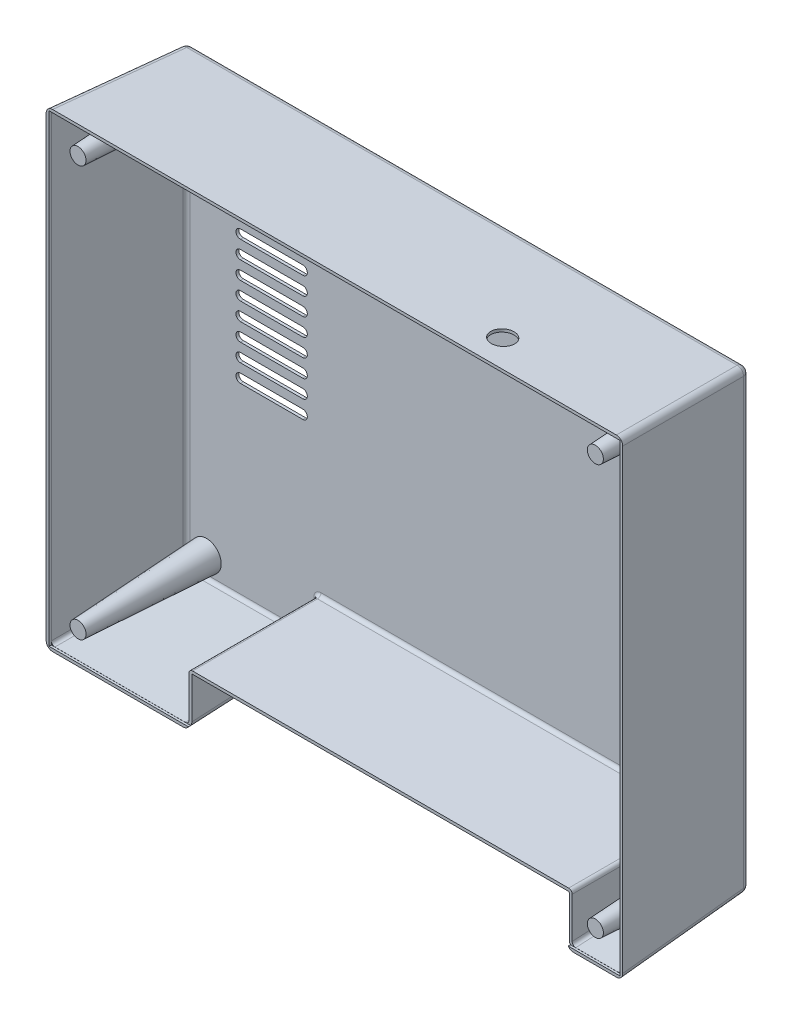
ISO-10303-21;
HEADER;
FILE_DESCRIPTION(('STEP AP214'),'2;1');
FILE_NAME('part.step','',(''),(''),'','','');
FILE_SCHEMA(('AUTOMOTIVE_DESIGN { 1 0 10303 214 1 1 1 1 }'));
ENDSEC;
DATA;
#1=APPLICATION_CONTEXT('core data for automotive mechanical design processes');
#2=APPLICATION_PROTOCOL_DEFINITION('international standard','automotive_design',2000,#1);
#3=PRODUCT_CONTEXT('',#1,'mechanical');
#4=PRODUCT('Part','Part','',(#3));
#5=PRODUCT_RELATED_PRODUCT_CATEGORY('part','',(#4));
#6=PRODUCT_DEFINITION_FORMATION('','',#4);
#7=PRODUCT_DEFINITION_CONTEXT('part definition',#1,'design');
#8=PRODUCT_DEFINITION('design','',#6,#7);
#9=PRODUCT_DEFINITION_SHAPE('','',#8);
#10=(LENGTH_UNIT() NAMED_UNIT(*) SI_UNIT(.MILLI.,.METRE.));
#11=(NAMED_UNIT(*) PLANE_ANGLE_UNIT() SI_UNIT($,.RADIAN.));
#12=(NAMED_UNIT(*) SI_UNIT($,.STERADIAN.) SOLID_ANGLE_UNIT());
#13=UNCERTAINTY_MEASURE_WITH_UNIT(LENGTH_MEASURE(1.E-05),#10,'distance_accuracy_value','');
#14=(GEOMETRIC_REPRESENTATION_CONTEXT(3) GLOBAL_UNCERTAINTY_ASSIGNED_CONTEXT((#13)) GLOBAL_UNIT_ASSIGNED_CONTEXT((#10,
#11,#12)) REPRESENTATION_CONTEXT('',''));
#15=CARTESIAN_POINT('',(0.,0.,0.));
#16=DIRECTION('',(0.,0.,1.));
#17=DIRECTION('',(1.,0.,0.));
#18=AXIS2_PLACEMENT_3D('',#15,#16,#17);
#19=CARTESIAN_POINT('',(101.6,83.5646076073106,-0.053173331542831));
#20=DIRECTION('',(0.,0.998629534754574,-0.0523359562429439));
#21=DIRECTION('',(0.,0.052335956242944,0.998629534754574));
#22=AXIS2_PLACEMENT_3D('',#19,#20,#21);
#23=PLANE('',#22);
#24=DIRECTION('',(0.052264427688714,0.052264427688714,0.997264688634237));
#25=VECTOR('',#24,1.);
#26=CARTESIAN_POINT('',(99.8842225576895,83.1170896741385,-8.59232418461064));
#27=LINE('',#26,#25);
#28=CARTESIAN_POINT('',(100.334527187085,83.5673943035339,0.));
#29=VERTEX_POINT('',#28);
#30=CARTESIAN_POINT('',(97.9571326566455,81.1899997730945,-45.3633899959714));
#31=VERTEX_POINT('',#30);
#32=EDGE_CURVE('E1060',#29,#31,#27,.F.);
#33=ORIENTED_EDGE('',*,*,#32,.T.);
#34=DIRECTION('',(1.,0.,0.));
#35=VECTOR('',#34,1.);
#36=CARTESIAN_POINT('',(101.6,81.1899997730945,-45.3633899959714));
#37=LINE('',#36,#35);
#38=CARTESIAN_POINT('',(-97.9571326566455,81.1899997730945,-45.3633899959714));
#39=VERTEX_POINT('',#38);
#40=EDGE_CURVE('E1065',#31,#39,#37,.F.);
#41=ORIENTED_EDGE('',*,*,#40,.T.);
#42=DIRECTION('',(-0.052264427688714,0.052264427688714,0.997264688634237));
#43=VECTOR('',#42,1.);
#44=CARTESIAN_POINT('',(-99.7801497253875,83.0130168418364,-10.5781521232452));
#45=LINE('',#44,#43);
#46=CARTESIAN_POINT('',(-100.334527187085,83.5673943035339,0.));
#47=VERTEX_POINT('',#46);
#48=EDGE_CURVE('E1063',#39,#47,#45,.T.);
#49=ORIENTED_EDGE('',*,*,#48,.T.);
#50=DIRECTION('',(-1.,0.,0.));
#51=VECTOR('',#50,1.);
#52=CARTESIAN_POINT('',(101.6,83.5673943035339,0.));
#53=LINE('',#52,#51);
#54=EDGE_CURVE('E1190',#29,#47,#53,.T.);
#55=ORIENTED_EDGE('',*,*,#54,.F.);
#56=EDGE_LOOP('',(#33,#41,#49,#55));
#57=FACE_BOUND('',#56,.T.);
#58=CARTESIAN_POINT('',(49.5693691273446,83.026611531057,-10.31875));
#59=DIRECTION('',(0.,0.998629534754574,-0.0523359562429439));
#60=DIRECTION('',(0.,-0.052335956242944,-0.998629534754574));
#61=AXIS2_PLACEMENT_3D('',#58,#59,#60);
#62=ELLIPSE('',#61,4.06957721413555,4.064);
#63=CARTESIAN_POINT('',(49.5693691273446,82.8136263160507,-14.38275));
#64=VERTEX_POINT('',#63);
#65=EDGE_CURVE('E2243',#64,#64,#62,.F.);
#66=ORIENTED_EDGE('',*,*,#65,.T.);
#67=EDGE_LOOP('',(#66));
#68=FACE_BOUND('',#67,.T.);
#69=ADVANCED_FACE('F28',(#57,#68),#23,.T.);
#70=CARTESIAN_POINT('',(101.6,82.55,0.));
#71=DIRECTION('',(0.,0.998629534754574,-0.0523359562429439));
#72=DIRECTION('',(0.,0.052335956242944,0.998629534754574));
#73=AXIS2_PLACEMENT_3D('',#70,#71,#72);
#74=PLANE('',#73);
#75=DIRECTION('',(0.0522644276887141,0.052264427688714,0.997264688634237));
#76=VECTOR('',#75,1.);
#77=CARTESIAN_POINT('',(100.335204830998,82.5534643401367,0.0661035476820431));
#78=LINE('',#77,#76);
#79=CARTESIAN_POINT('',(100.290141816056,82.5084013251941,-0.79375));
#80=VERTEX_POINT('',#79);
#81=CARTESIAN_POINT('',(97.9571326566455,80.1753921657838,-45.3102166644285));
#82=VERTEX_POINT('',#81);
#83=EDGE_CURVE('E932',#80,#82,#78,.F.);
#84=ORIENTED_EDGE('',*,*,#83,.F.);
#85=DIRECTION('',(-1.,0.,0.));
#86=VECTOR('',#85,1.);
#87=CARTESIAN_POINT('',(101.6,82.5084013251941,-0.79375));
#88=LINE('',#87,#86);
#89=CARTESIAN_POINT('',(-100.290141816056,82.5084013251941,-0.79375));
#90=VERTEX_POINT('',#89);
#91=EDGE_CURVE('E844',#80,#90,#88,.T.);
#92=ORIENTED_EDGE('',*,*,#91,.T.);
#93=DIRECTION('',(-0.052264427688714,0.052264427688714,0.997264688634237));
#94=VECTOR('',#93,1.);
#95=CARTESIAN_POINT('',(-99.7801497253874,81.9984092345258,-10.5249787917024));
#96=LINE('',#95,#94);
#97=CARTESIAN_POINT('',(-97.9571326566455,80.1753921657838,-45.3102166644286));
#98=VERTEX_POINT('',#97);
#99=EDGE_CURVE('E934',#98,#90,#96,.T.);
#100=ORIENTED_EDGE('',*,*,#99,.F.);
#101=DIRECTION('',(1.,0.,0.));
#102=VECTOR('',#101,1.);
#103=CARTESIAN_POINT('',(-97.8940581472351,80.1753921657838,-45.3102166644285));
#104=LINE('',#103,#102);
#105=EDGE_CURVE('E993',#82,#98,#104,.F.);
#106=ORIENTED_EDGE('',*,*,#105,.F.);
#107=EDGE_LOOP('',(#84,#92,#100,#106));
#108=FACE_BOUND('',#107,.T.);
#109=CARTESIAN_POINT('',(49.5693691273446,82.0092172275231,-10.31875));
#110=DIRECTION('',(0.,0.998629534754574,-0.0523359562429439));
#111=DIRECTION('',(0.,-0.052335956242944,-0.998629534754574));
#112=AXIS2_PLACEMENT_3D('',#109,#110,#111);
#113=ELLIPSE('',#112,4.06957721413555,4.064);
#114=CARTESIAN_POINT('',(49.5693691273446,81.7962320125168,-14.38275));
#115=VERTEX_POINT('',#114);
#116=EDGE_CURVE('E32',#115,#115,#113,.F.);
#117=ORIENTED_EDGE('',*,*,#116,.F.);
#118=EDGE_LOOP('',(#117));
#119=FACE_BOUND('',#118,.T.);
#120=ADVANCED_FACE('F1338',(#108,#119),#74,.F.);
#121=CARTESIAN_POINT('',(-46.6537976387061,22.566291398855,-46.51375));
#122=DIRECTION('',(0.,0.,1.));
#123=DIRECTION('',(0.,1.,0.));
#124=AXIS2_PLACEMENT_3D('',#121,#122,#123);
#125=PLANE('',#124);
#126=CARTESIAN_POINT('',(-92.075,-73.025,-46.51375));
#127=DIRECTION('',(0.,0.,1.));
#128=DIRECTION('',(0.,-1.,0.));
#129=AXIS2_PLACEMENT_3D('',#126,#127,#128);
#130=CIRCLE('',#129,5.25358366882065);
#131=CARTESIAN_POINT('',(-92.075,-78.2785836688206,-46.51375));
#132=VERTEX_POINT('',#131);
#133=EDGE_CURVE('E2252',#132,#132,#130,.T.);
#134=ORIENTED_EDGE('',*,*,#133,.F.);
#135=EDGE_LOOP('',(#134));
#136=FACE_BOUND('',#135,.T.);
#137=CARTESIAN_POINT('',(92.075,73.025,-46.51375));
#138=DIRECTION('',(0.,0.,1.));
#139=DIRECTION('',(0.,-1.,0.));
#140=AXIS2_PLACEMENT_3D('',#137,#138,#139);
#141=CIRCLE('',#140,5.25358366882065);
#142=CARTESIAN_POINT('',(92.075,67.7714163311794,-46.51375));
#143=VERTEX_POINT('',#142);
#144=EDGE_CURVE('E2263',#143,#143,#141,.T.);
#145=ORIENTED_EDGE('',*,*,#144,.F.);
#146=EDGE_LOOP('',(#145));
#147=FACE_BOUND('',#146,.T.);
#148=DIRECTION('',(-1.,0.,0.));
#149=VECTOR('',#148,1.);
#150=CARTESIAN_POINT('',(-57.7662976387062,-4.42120860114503,-46.51375));
#151=LINE('',#150,#149);
#152=CARTESIAN_POINT('',(-57.7662976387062,-4.42120860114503,-46.51375));
#153=VERTEX_POINT('',#152);
#154=CARTESIAN_POINT('',(-79.9912976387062,-4.42120860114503,-46.51375));
#155=VERTEX_POINT('',#154);
#156=EDGE_CURVE('E563',#153,#155,#151,.T.);
#157=ORIENTED_EDGE('',*,*,#156,.F.);
#158=CARTESIAN_POINT('',(-57.7662976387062,-6.00870860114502,-46.51375));
#159=DIRECTION('',(0.,0.,1.));
#160=DIRECTION('',(0.,-1.,0.));
#161=AXIS2_PLACEMENT_3D('',#158,#159,#160);
#162=CIRCLE('',#161,1.5875);
#163=CARTESIAN_POINT('',(-57.7662976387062,-7.59620860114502,-46.51375));
#164=VERTEX_POINT('',#163);
#165=EDGE_CURVE('E566',#164,#153,#162,.T.);
#166=ORIENTED_EDGE('',*,*,#165,.F.);
#167=DIRECTION('',(1.,0.,0.));
#168=VECTOR('',#167,1.);
#169=CARTESIAN_POINT('',(-79.9912976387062,-7.59620860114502,-46.51375));
#170=LINE('',#169,#168);
#171=CARTESIAN_POINT('',(-79.9912976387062,-7.59620860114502,-46.51375));
#172=VERTEX_POINT('',#171);
#173=EDGE_CURVE('E590',#172,#164,#170,.T.);
#174=ORIENTED_EDGE('',*,*,#173,.F.);
#175=CARTESIAN_POINT('',(-79.9912976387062,-6.00870860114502,-46.51375));
#176=DIRECTION('',(0.,0.,1.));
#177=DIRECTION('',(0.,-1.,0.));
#178=AXIS2_PLACEMENT_3D('',#175,#176,#177);
#179=CIRCLE('',#178,1.5875);
#180=EDGE_CURVE('E539',#155,#172,#179,.T.);
#181=ORIENTED_EDGE('',*,*,#180,.F.);
#182=EDGE_LOOP('',(#157,#166,#174,#181));
#183=FACE_BOUND('',#182,.T.);
#184=DIRECTION('',(-1.,0.,0.));
#185=VECTOR('',#184,1.);
#186=CARTESIAN_POINT('',(-57.7662976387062,8.27879139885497,-46.51375));
#187=LINE('',#186,#185);
#188=CARTESIAN_POINT('',(-57.7662976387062,8.27879139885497,-46.51375));
#189=VERTEX_POINT('',#188);
#190=CARTESIAN_POINT('',(-79.9912976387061,8.27879139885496,-46.51375));
#191=VERTEX_POINT('',#190);
#192=EDGE_CURVE('E627',#189,#191,#187,.T.);
#193=ORIENTED_EDGE('',*,*,#192,.F.);
#194=CARTESIAN_POINT('',(-57.7662976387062,6.69129139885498,-46.51375));
#195=DIRECTION('',(0.,0.,1.));
#196=DIRECTION('',(0.,-1.,0.));
#197=AXIS2_PLACEMENT_3D('',#194,#195,#196);
#198=CIRCLE('',#197,1.5875);
#199=CARTESIAN_POINT('',(-57.7662976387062,5.10379139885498,-46.51375));
#200=VERTEX_POINT('',#199);
#201=EDGE_CURVE('E630',#200,#189,#198,.T.);
#202=ORIENTED_EDGE('',*,*,#201,.F.);
#203=DIRECTION('',(1.,0.,0.));
#204=VECTOR('',#203,1.);
#205=CARTESIAN_POINT('',(-79.9912976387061,5.10379139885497,-46.51375));
#206=LINE('',#205,#204);
#207=CARTESIAN_POINT('',(-79.9912976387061,5.10379139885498,-46.51375));
#208=VERTEX_POINT('',#207);
#209=EDGE_CURVE('E654',#208,#200,#206,.T.);
#210=ORIENTED_EDGE('',*,*,#209,.F.);
#211=CARTESIAN_POINT('',(-79.9912976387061,6.69129139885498,-46.51375));
#212=DIRECTION('',(0.,0.,1.));
#213=DIRECTION('',(0.,-1.,0.));
#214=AXIS2_PLACEMENT_3D('',#211,#212,#213);
#215=CIRCLE('',#214,1.5875);
#216=EDGE_CURVE('E625',#191,#208,#215,.T.);
#217=ORIENTED_EDGE('',*,*,#216,.F.);
#218=EDGE_LOOP('',(#193,#202,#210,#217));
#219=FACE_BOUND('',#218,.T.);
#220=DIRECTION('',(-1.,0.,0.));
#221=VECTOR('',#220,1.);
#222=CARTESIAN_POINT('',(-57.7662976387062,20.978791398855,-46.51375));
#223=LINE('',#222,#221);
#224=CARTESIAN_POINT('',(-57.7662976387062,20.978791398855,-46.51375));
#225=VERTEX_POINT('',#224);
#226=CARTESIAN_POINT('',(-79.9912976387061,20.978791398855,-46.51375));
#227=VERTEX_POINT('',#226);
#228=EDGE_CURVE('E691',#225,#227,#223,.T.);
#229=ORIENTED_EDGE('',*,*,#228,.F.);
#230=CARTESIAN_POINT('',(-57.7662976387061,19.391291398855,-46.51375));
#231=DIRECTION('',(0.,0.,1.));
#232=DIRECTION('',(0.,-1.,0.));
#233=AXIS2_PLACEMENT_3D('',#230,#231,#232);
#234=CIRCLE('',#233,1.5875);
#235=CARTESIAN_POINT('',(-57.7662976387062,17.803791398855,-46.51375));
#236=VERTEX_POINT('',#235);
#237=EDGE_CURVE('E694',#236,#225,#234,.T.);
#238=ORIENTED_EDGE('',*,*,#237,.F.);
#239=DIRECTION('',(1.,0.,0.));
#240=VECTOR('',#239,1.);
#241=CARTESIAN_POINT('',(-79.9912976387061,17.803791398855,-46.51375));
#242=LINE('',#241,#240);
#243=CARTESIAN_POINT('',(-79.9912976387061,17.803791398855,-46.51375));
#244=VERTEX_POINT('',#243);
#245=EDGE_CURVE('E718',#244,#236,#242,.T.);
#246=ORIENTED_EDGE('',*,*,#245,.F.);
#247=CARTESIAN_POINT('',(-79.9912976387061,19.391291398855,-46.51375));
#248=DIRECTION('',(0.,0.,1.));
#249=DIRECTION('',(0.,-1.,0.));
#250=AXIS2_PLACEMENT_3D('',#247,#248,#249);
#251=CIRCLE('',#250,1.5875);
#252=EDGE_CURVE('E689',#227,#244,#251,.T.);
#253=ORIENTED_EDGE('',*,*,#252,.F.);
#254=EDGE_LOOP('',(#229,#238,#246,#253));
#255=FACE_BOUND('',#254,.T.);
#256=DIRECTION('',(-1.,0.,0.));
#257=VECTOR('',#256,1.);
#258=CARTESIAN_POINT('',(-57.7662976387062,33.678791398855,-46.51375));
#259=LINE('',#258,#257);
#260=CARTESIAN_POINT('',(-57.7662976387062,33.678791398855,-46.51375));
#261=VERTEX_POINT('',#260);
#262=CARTESIAN_POINT('',(-79.9912976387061,33.678791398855,-46.51375));
#263=VERTEX_POINT('',#262);
#264=EDGE_CURVE('E755',#261,#263,#259,.T.);
#265=ORIENTED_EDGE('',*,*,#264,.F.);
#266=CARTESIAN_POINT('',(-57.7662976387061,32.091291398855,-46.51375));
#267=DIRECTION('',(0.,0.,1.));
#268=DIRECTION('',(0.,-1.,0.));
#269=AXIS2_PLACEMENT_3D('',#266,#267,#268);
#270=CIRCLE('',#269,1.5875);
#271=CARTESIAN_POINT('',(-57.7662976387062,30.503791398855,-46.51375));
#272=VERTEX_POINT('',#271);
#273=EDGE_CURVE('E758',#272,#261,#270,.T.);
#274=ORIENTED_EDGE('',*,*,#273,.F.);
#275=DIRECTION('',(1.,0.,0.));
#276=VECTOR('',#275,1.);
#277=CARTESIAN_POINT('',(-79.9912976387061,30.503791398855,-46.51375));
#278=LINE('',#277,#276);
#279=CARTESIAN_POINT('',(-79.9912976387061,30.503791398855,-46.51375));
#280=VERTEX_POINT('',#279);
#281=EDGE_CURVE('E782',#280,#272,#278,.T.);
#282=ORIENTED_EDGE('',*,*,#281,.F.);
#283=CARTESIAN_POINT('',(-79.9912976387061,32.091291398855,-46.51375));
#284=DIRECTION('',(0.,0.,1.));
#285=DIRECTION('',(0.,-1.,0.));
#286=AXIS2_PLACEMENT_3D('',#283,#284,#285);
#287=CIRCLE('',#286,1.5875);
#288=EDGE_CURVE('E753',#263,#280,#287,.T.);
#289=ORIENTED_EDGE('',*,*,#288,.F.);
#290=EDGE_LOOP('',(#265,#274,#282,#289));
#291=FACE_BOUND('',#290,.T.);
#292=DIRECTION('',(0.,1.,0.));
#293=VECTOR('',#292,1.);
#294=CARTESIAN_POINT('',(-97.9571326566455,78.8440581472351,-46.51375));
#295=LINE('',#294,#293);
#296=CARTESIAN_POINT('',(-97.9571326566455,-78.9071326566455,-46.51375));
#297=VERTEX_POINT('',#296);
#298=CARTESIAN_POINT('',(-97.9571326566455,78.9071326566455,-46.51375));
#299=VERTEX_POINT('',#298);
#300=EDGE_CURVE('E988',#297,#299,#295,.T.);
#301=ORIENTED_EDGE('',*,*,#300,.F.);
#302=DIRECTION('',(-1.,0.,0.));
#303=VECTOR('',#302,1.);
#304=CARTESIAN_POINT('',(-97.8940581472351,-78.9071326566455,-46.51375));
#305=LINE('',#304,#303);
#306=CARTESIAN_POINT('',(-53.848,-78.9071326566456,-46.51375));
#307=VERTEX_POINT('',#306);
#308=EDGE_CURVE('E984',#307,#297,#305,.T.);
#309=ORIENTED_EDGE('',*,*,#308,.F.);
#310=DIRECTION('',(0.,-1.,0.));
#311=VECTOR('',#310,1.);
#312=CARTESIAN_POINT('',(-53.848,22.566291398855,-46.51375));
#313=LINE('',#312,#311);
#314=CARTESIAN_POINT('',(-53.848,-66.6767404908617,-46.51375));
#315=VERTEX_POINT('',#314);
#316=EDGE_CURVE('E980',#315,#307,#313,.T.);
#317=ORIENTED_EDGE('',*,*,#316,.F.);
#318=CARTESIAN_POINT('',(-51.308,-66.6767404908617,-46.51375));
#319=DIRECTION('',(0.,0.,1.));
#320=DIRECTION('',(0.,-1.,0.));
#321=AXIS2_PLACEMENT_3D('',#318,#319,#320);
#322=CIRCLE('',#321,2.54);
#323=CARTESIAN_POINT('',(-51.308,-64.1367404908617,-46.51375));
#324=VERTEX_POINT('',#323);
#325=EDGE_CURVE('E976',#324,#315,#322,.T.);
#326=ORIENTED_EDGE('',*,*,#325,.F.);
#327=DIRECTION('',(1.,0.,0.));
#328=VECTOR('',#327,1.);
#329=CARTESIAN_POINT('',(-51.308,-64.1367404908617,-46.51375));
#330=LINE('',#329,#328);
#331=CARTESIAN_POINT('',(82.55,-64.1367404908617,-46.51375));
#332=VERTEX_POINT('',#331);
#333=EDGE_CURVE('E972',#332,#324,#330,.F.);
#334=ORIENTED_EDGE('',*,*,#333,.F.);
#335=CARTESIAN_POINT('',(82.55,-66.6767404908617,-46.51375));
#336=DIRECTION('',(0.,0.,1.));
#337=DIRECTION('',(0.,-1.,0.));
#338=AXIS2_PLACEMENT_3D('',#335,#336,#337);
#339=CIRCLE('',#338,2.54);
#340=CARTESIAN_POINT('',(85.09,-66.6767404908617,-46.51375));
#341=VERTEX_POINT('',#340);
#342=EDGE_CURVE('E974',#341,#332,#339,.T.);
#343=ORIENTED_EDGE('',*,*,#342,.F.);
#344=DIRECTION('',(0.,1.,0.));
#345=VECTOR('',#344,1.);
#346=CARTESIAN_POINT('',(85.09,22.566291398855,-46.51375));
#347=LINE('',#346,#345);
#348=CARTESIAN_POINT('',(85.09,-78.9071326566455,-46.51375));
#349=VERTEX_POINT('',#348);
#350=EDGE_CURVE('E978',#349,#341,#347,.T.);
#351=ORIENTED_EDGE('',*,*,#350,.F.);
#352=DIRECTION('',(-1.,0.,0.));
#353=VECTOR('',#352,1.);
#354=CARTESIAN_POINT('',(85.09,-78.9071326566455,-46.51375));
#355=LINE('',#354,#353);
#356=CARTESIAN_POINT('',(97.9571326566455,-78.9071326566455,-46.51375));
#357=VERTEX_POINT('',#356);
#358=EDGE_CURVE('E982',#357,#349,#355,.T.);
#359=ORIENTED_EDGE('',*,*,#358,.F.);
#360=DIRECTION('',(0.,-1.,0.));
#361=VECTOR('',#360,1.);
#362=CARTESIAN_POINT('',(97.9571326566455,-78.8440581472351,-46.51375));
#363=LINE('',#362,#361);
#364=CARTESIAN_POINT('',(97.9571326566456,78.9071326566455,-46.51375));
#365=VERTEX_POINT('',#364);
#366=EDGE_CURVE('E986',#365,#357,#363,.T.);
#367=ORIENTED_EDGE('',*,*,#366,.F.);
#368=DIRECTION('',(1.,0.,0.));
#369=VECTOR('',#368,1.);
#370=CARTESIAN_POINT('',(97.8940581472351,78.9071326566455,-46.51375));
#371=LINE('',#370,#369);
#372=EDGE_CURVE('E990',#299,#365,#371,.T.);
#373=ORIENTED_EDGE('',*,*,#372,.F.);
#374=EDGE_LOOP('',(#301,#309,#317,#326,#334,#343,#351,#359,#367,#373));
#375=FACE_BOUND('',#374,.T.);
#376=DIRECTION('',(-1.,0.,0.));
#377=VECTOR('',#376,1.);
#378=CARTESIAN_POINT('',(-57.7662976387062,27.328791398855,-46.51375));
#379=LINE('',#378,#377);
#380=CARTESIAN_POINT('',(-57.7662976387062,27.328791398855,-46.51375));
#381=VERTEX_POINT('',#380);
#382=CARTESIAN_POINT('',(-79.9912976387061,27.328791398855,-46.51375));
#383=VERTEX_POINT('',#382);
#384=EDGE_CURVE('E723',#381,#383,#379,.T.);
#385=ORIENTED_EDGE('',*,*,#384,.F.);
#386=CARTESIAN_POINT('',(-57.7662976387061,25.741291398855,-46.51375));
#387=DIRECTION('',(0.,0.,1.));
#388=DIRECTION('',(0.,-1.,0.));
#389=AXIS2_PLACEMENT_3D('',#386,#387,#388);
#390=CIRCLE('',#389,1.5875);
#391=CARTESIAN_POINT('',(-57.7662976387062,24.153791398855,-46.51375));
#392=VERTEX_POINT('',#391);
#393=EDGE_CURVE('E726',#392,#381,#390,.T.);
#394=ORIENTED_EDGE('',*,*,#393,.F.);
#395=DIRECTION('',(1.,0.,0.));
#396=VECTOR('',#395,1.);
#397=CARTESIAN_POINT('',(-79.9912976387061,24.153791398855,-46.51375));
#398=LINE('',#397,#396);
#399=CARTESIAN_POINT('',(-79.9912976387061,24.153791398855,-46.51375));
#400=VERTEX_POINT('',#399);
#401=EDGE_CURVE('E750',#400,#392,#398,.T.);
#402=ORIENTED_EDGE('',*,*,#401,.F.);
#403=CARTESIAN_POINT('',(-79.9912976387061,25.741291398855,-46.51375));
#404=DIRECTION('',(0.,0.,1.));
#405=DIRECTION('',(0.,-1.,0.));
#406=AXIS2_PLACEMENT_3D('',#403,#404,#405);
#407=CIRCLE('',#406,1.5875);
#408=EDGE_CURVE('E721',#383,#400,#407,.T.);
#409=ORIENTED_EDGE('',*,*,#408,.F.);
#410=EDGE_LOOP('',(#385,#394,#402,#409));
#411=FACE_BOUND('',#410,.T.);
#412=DIRECTION('',(-1.,0.,0.));
#413=VECTOR('',#412,1.);
#414=CARTESIAN_POINT('',(-57.7662976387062,14.628791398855,-46.51375));
#415=LINE('',#414,#413);
#416=CARTESIAN_POINT('',(-57.7662976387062,14.628791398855,-46.51375));
#417=VERTEX_POINT('',#416);
#418=CARTESIAN_POINT('',(-79.9912976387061,14.628791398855,-46.51375));
#419=VERTEX_POINT('',#418);
#420=EDGE_CURVE('E659',#417,#419,#415,.T.);
#421=ORIENTED_EDGE('',*,*,#420,.F.);
#422=CARTESIAN_POINT('',(-57.7662976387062,13.041291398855,-46.51375));
#423=DIRECTION('',(0.,0.,1.));
#424=DIRECTION('',(0.,-1.,0.));
#425=AXIS2_PLACEMENT_3D('',#422,#423,#424);
#426=CIRCLE('',#425,1.5875);
#427=CARTESIAN_POINT('',(-57.7662976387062,11.453791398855,-46.51375));
#428=VERTEX_POINT('',#427);
#429=EDGE_CURVE('E662',#428,#417,#426,.T.);
#430=ORIENTED_EDGE('',*,*,#429,.F.);
#431=DIRECTION('',(1.,0.,0.));
#432=VECTOR('',#431,1.);
#433=CARTESIAN_POINT('',(-79.9912976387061,11.453791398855,-46.51375));
#434=LINE('',#433,#432);
#435=CARTESIAN_POINT('',(-79.9912976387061,11.453791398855,-46.51375));
#436=VERTEX_POINT('',#435);
#437=EDGE_CURVE('E686',#436,#428,#434,.T.);
#438=ORIENTED_EDGE('',*,*,#437,.F.);
#439=CARTESIAN_POINT('',(-79.9912976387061,13.041291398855,-46.51375));
#440=DIRECTION('',(0.,0.,1.));
#441=DIRECTION('',(0.,-1.,0.));
#442=AXIS2_PLACEMENT_3D('',#439,#440,#441);
#443=CIRCLE('',#442,1.5875);
#444=EDGE_CURVE('E657',#419,#436,#443,.T.);
#445=ORIENTED_EDGE('',*,*,#444,.F.);
#446=EDGE_LOOP('',(#421,#430,#438,#445));
#447=FACE_BOUND('',#446,.T.);
#448=DIRECTION('',(-1.,0.,0.));
#449=VECTOR('',#448,1.);
#450=CARTESIAN_POINT('',(-57.7662976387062,1.92879139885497,-46.51375));
#451=LINE('',#450,#449);
#452=CARTESIAN_POINT('',(-57.7662976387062,1.92879139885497,-46.51375));
#453=VERTEX_POINT('',#452);
#454=CARTESIAN_POINT('',(-79.9912976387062,1.92879139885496,-46.51375));
#455=VERTEX_POINT('',#454);
#456=EDGE_CURVE('E595',#453,#455,#451,.T.);
#457=ORIENTED_EDGE('',*,*,#456,.F.);
#458=CARTESIAN_POINT('',(-57.7662976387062,0.341291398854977,-46.51375));
#459=DIRECTION('',(0.,0.,1.));
#460=DIRECTION('',(0.,-1.,0.));
#461=AXIS2_PLACEMENT_3D('',#458,#459,#460);
#462=CIRCLE('',#461,1.5875);
#463=CARTESIAN_POINT('',(-57.7662976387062,-1.24620860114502,-46.51375));
#464=VERTEX_POINT('',#463);
#465=EDGE_CURVE('E598',#464,#453,#462,.T.);
#466=ORIENTED_EDGE('',*,*,#465,.F.);
#467=DIRECTION('',(1.,0.,0.));
#468=VECTOR('',#467,1.);
#469=CARTESIAN_POINT('',(-79.9912976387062,-1.24620860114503,-46.51375));
#470=LINE('',#469,#468);
#471=CARTESIAN_POINT('',(-79.9912976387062,-1.24620860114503,-46.51375));
#472=VERTEX_POINT('',#471);
#473=EDGE_CURVE('E622',#472,#464,#470,.T.);
#474=ORIENTED_EDGE('',*,*,#473,.F.);
#475=CARTESIAN_POINT('',(-79.9912976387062,0.341291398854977,-46.51375));
#476=DIRECTION('',(0.,0.,1.));
#477=DIRECTION('',(0.,-1.,0.));
#478=AXIS2_PLACEMENT_3D('',#475,#476,#477);
#479=CIRCLE('',#478,1.5875);
#480=EDGE_CURVE('E593',#455,#472,#479,.T.);
#481=ORIENTED_EDGE('',*,*,#480,.F.);
#482=EDGE_LOOP('',(#457,#466,#474,#481));
#483=FACE_BOUND('',#482,.T.);
#484=DIRECTION('',(-1.,0.,0.));
#485=VECTOR('',#484,1.);
#486=CARTESIAN_POINT('',(-57.7662976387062,-10.771208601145,-46.51375));
#487=LINE('',#486,#485);
#488=CARTESIAN_POINT('',(-57.7662976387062,-10.771208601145,-46.51375));
#489=VERTEX_POINT('',#488);
#490=CARTESIAN_POINT('',(-79.9912976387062,-10.771208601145,-46.51375));
#491=VERTEX_POINT('',#490);
#492=EDGE_CURVE('E545',#489,#491,#487,.T.);
#493=ORIENTED_EDGE('',*,*,#492,.F.);
#494=CARTESIAN_POINT('',(-57.7662976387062,-12.358708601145,-46.51375));
#495=DIRECTION('',(0.,0.,1.));
#496=DIRECTION('',(0.,-1.,0.));
#497=AXIS2_PLACEMENT_3D('',#494,#495,#496);
#498=CIRCLE('',#497,1.5875);
#499=CARTESIAN_POINT('',(-57.7662976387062,-13.946208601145,-46.51375));
#500=VERTEX_POINT('',#499);
#501=EDGE_CURVE('E527',#500,#489,#498,.T.);
#502=ORIENTED_EDGE('',*,*,#501,.F.);
#503=DIRECTION('',(1.,0.,0.));
#504=VECTOR('',#503,1.);
#505=CARTESIAN_POINT('',(-79.9912976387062,-13.946208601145,-46.51375));
#506=LINE('',#505,#504);
#507=CARTESIAN_POINT('',(-79.9912976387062,-13.946208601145,-46.51375));
#508=VERTEX_POINT('',#507);
#509=EDGE_CURVE('E536',#508,#500,#506,.T.);
#510=ORIENTED_EDGE('',*,*,#509,.F.);
#511=CARTESIAN_POINT('',(-79.9912976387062,-12.358708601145,-46.51375));
#512=DIRECTION('',(0.,0.,1.));
#513=DIRECTION('',(0.,-1.,0.));
#514=AXIS2_PLACEMENT_3D('',#511,#512,#513);
#515=CIRCLE('',#514,1.5875);
#516=EDGE_CURVE('E52',#491,#508,#515,.T.);
#517=ORIENTED_EDGE('',*,*,#516,.F.);
#518=EDGE_LOOP('',(#493,#502,#510,#517));
#519=FACE_BOUND('',#518,.T.);
#520=CARTESIAN_POINT('',(-92.075,73.025,-46.51375));
#521=DIRECTION('',(0.,0.,1.));
#522=DIRECTION('',(0.,-1.,0.));
#523=AXIS2_PLACEMENT_3D('',#520,#521,#522);
#524=CIRCLE('',#523,5.25358366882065);
#525=CARTESIAN_POINT('',(-92.075,67.7714163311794,-46.51375));
#526=VERTEX_POINT('',#525);
#527=EDGE_CURVE('E2257',#526,#526,#524,.T.);
#528=ORIENTED_EDGE('',*,*,#527,.F.);
#529=EDGE_LOOP('',(#528));
#530=FACE_BOUND('',#529,.T.);
#531=CARTESIAN_POINT('',(92.075,-73.025,-46.51375));
#532=DIRECTION('',(0.,0.,1.));
#533=DIRECTION('',(0.,-1.,0.));
#534=AXIS2_PLACEMENT_3D('',#531,#532,#533);
#535=CIRCLE('',#534,5.25358366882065);
#536=CARTESIAN_POINT('',(92.075,-78.2785836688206,-46.51375));
#537=VERTEX_POINT('',#536);
#538=EDGE_CURVE('E2245',#537,#537,#535,.T.);
#539=ORIENTED_EDGE('',*,*,#538,.F.);
#540=EDGE_LOOP('',(#539));
#541=FACE_BOUND('',#540,.T.);
#542=ADVANCED_FACE('F542',(#136,#147,#183,#219,#255,#291,#375,#411,#447,#483,#519,#530,#541),
#125,.T.);
#543=CARTESIAN_POINT('',(-46.6537976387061,22.566291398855,-47.52975));
#544=DIRECTION('',(0.,0.,1.));
#545=DIRECTION('',(0.,1.,0.));
#546=AXIS2_PLACEMENT_3D('',#543,#544,#545);
#547=PLANE('',#546);
#548=CARTESIAN_POINT('',(-57.7662976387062,-6.00870860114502,-47.52975));
#549=DIRECTION('',(0.,0.,1.));
#550=DIRECTION('',(1.,0.,0.));
#551=AXIS2_PLACEMENT_3D('',#548,#549,#550);
#552=CIRCLE('',#551,1.5875);
#553=CARTESIAN_POINT('',(-57.7662976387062,-7.59620860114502,-47.52975));
#554=VERTEX_POINT('',#553);
#555=CARTESIAN_POINT('',(-57.7662976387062,-4.42120860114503,-47.52975));
#556=VERTEX_POINT('',#555);
#557=EDGE_CURVE('E569',#554,#556,#552,.T.);
#558=ORIENTED_EDGE('',*,*,#557,.T.);
#559=DIRECTION('',(-1.,0.,0.));
#560=VECTOR('',#559,1.);
#561=CARTESIAN_POINT('',(-57.7662976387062,-4.42120860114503,-47.52975));
#562=LINE('',#561,#560);
#563=CARTESIAN_POINT('',(-79.9912976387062,-4.42120860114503,-47.52975));
#564=VERTEX_POINT('',#563);
#565=EDGE_CURVE('E572',#556,#564,#562,.T.);
#566=ORIENTED_EDGE('',*,*,#565,.T.);
#567=CARTESIAN_POINT('',(-79.9912976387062,-6.00870860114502,-47.52975));
#568=DIRECTION('',(0.,0.,1.));
#569=DIRECTION('',(1.,0.,0.));
#570=AXIS2_PLACEMENT_3D('',#567,#568,#569);
#571=CIRCLE('',#570,1.5875);
#572=CARTESIAN_POINT('',(-79.9912976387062,-7.59620860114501,-47.52975));
#573=VERTEX_POINT('',#572);
#574=EDGE_CURVE('E575',#564,#573,#571,.T.);
#575=ORIENTED_EDGE('',*,*,#574,.T.);
#576=DIRECTION('',(1.,0.,0.));
#577=VECTOR('',#576,1.);
#578=CARTESIAN_POINT('',(-79.9912976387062,-7.59620860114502,-47.52975));
#579=LINE('',#578,#577);
#580=EDGE_CURVE('E578',#573,#554,#579,.T.);
#581=ORIENTED_EDGE('',*,*,#580,.T.);
#582=EDGE_LOOP('',(#558,#566,#575,#581));
#583=FACE_BOUND('',#582,.T.);
#584=CARTESIAN_POINT('',(-57.7662976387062,6.69129139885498,-47.52975));
#585=DIRECTION('',(0.,0.,1.));
#586=DIRECTION('',(1.,0.,0.));
#587=AXIS2_PLACEMENT_3D('',#584,#585,#586);
#588=CIRCLE('',#587,1.5875);
#589=CARTESIAN_POINT('',(-57.7662976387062,5.10379139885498,-47.52975));
#590=VERTEX_POINT('',#589);
#591=CARTESIAN_POINT('',(-57.7662976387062,8.27879139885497,-47.52975));
#592=VERTEX_POINT('',#591);
#593=EDGE_CURVE('E633',#590,#592,#588,.T.);
#594=ORIENTED_EDGE('',*,*,#593,.T.);
#595=DIRECTION('',(-1.,0.,0.));
#596=VECTOR('',#595,1.);
#597=CARTESIAN_POINT('',(-57.7662976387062,8.27879139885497,-47.52975));
#598=LINE('',#597,#596);
#599=CARTESIAN_POINT('',(-79.9912976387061,8.27879139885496,-47.52975));
#600=VERTEX_POINT('',#599);
#601=EDGE_CURVE('E636',#592,#600,#598,.T.);
#602=ORIENTED_EDGE('',*,*,#601,.T.);
#603=CARTESIAN_POINT('',(-79.9912976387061,6.69129139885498,-47.52975));
#604=DIRECTION('',(0.,0.,1.));
#605=DIRECTION('',(1.,0.,0.));
#606=AXIS2_PLACEMENT_3D('',#603,#604,#605);
#607=CIRCLE('',#606,1.5875);
#608=CARTESIAN_POINT('',(-79.9912976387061,5.10379139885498,-47.52975));
#609=VERTEX_POINT('',#608);
#610=EDGE_CURVE('E639',#600,#609,#607,.T.);
#611=ORIENTED_EDGE('',*,*,#610,.T.);
#612=DIRECTION('',(1.,0.,0.));
#613=VECTOR('',#612,1.);
#614=CARTESIAN_POINT('',(-79.9912976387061,5.10379139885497,-47.52975));
#615=LINE('',#614,#613);
#616=EDGE_CURVE('E642',#609,#590,#615,.T.);
#617=ORIENTED_EDGE('',*,*,#616,.T.);
#618=EDGE_LOOP('',(#594,#602,#611,#617));
#619=FACE_BOUND('',#618,.T.);
#620=CARTESIAN_POINT('',(-57.7662976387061,19.391291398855,-47.52975));
#621=DIRECTION('',(0.,0.,1.));
#622=DIRECTION('',(1.,0.,0.));
#623=AXIS2_PLACEMENT_3D('',#620,#621,#622);
#624=CIRCLE('',#623,1.5875);
#625=CARTESIAN_POINT('',(-57.7662976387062,17.803791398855,-47.52975));
#626=VERTEX_POINT('',#625);
#627=CARTESIAN_POINT('',(-57.7662976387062,20.978791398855,-47.52975));
#628=VERTEX_POINT('',#627);
#629=EDGE_CURVE('E697',#626,#628,#624,.T.);
#630=ORIENTED_EDGE('',*,*,#629,.T.);
#631=DIRECTION('',(-1.,0.,0.));
#632=VECTOR('',#631,1.);
#633=CARTESIAN_POINT('',(-57.7662976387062,20.978791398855,-47.52975));
#634=LINE('',#633,#632);
#635=CARTESIAN_POINT('',(-79.9912976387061,20.978791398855,-47.52975));
#636=VERTEX_POINT('',#635);
#637=EDGE_CURVE('E700',#628,#636,#634,.T.);
#638=ORIENTED_EDGE('',*,*,#637,.T.);
#639=CARTESIAN_POINT('',(-79.9912976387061,19.391291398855,-47.52975));
#640=DIRECTION('',(0.,0.,1.));
#641=DIRECTION('',(1.,0.,0.));
#642=AXIS2_PLACEMENT_3D('',#639,#640,#641);
#643=CIRCLE('',#642,1.5875);
#644=CARTESIAN_POINT('',(-79.9912976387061,17.803791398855,-47.52975));
#645=VERTEX_POINT('',#644);
#646=EDGE_CURVE('E703',#636,#645,#643,.T.);
#647=ORIENTED_EDGE('',*,*,#646,.T.);
#648=DIRECTION('',(1.,0.,0.));
#649=VECTOR('',#648,1.);
#650=CARTESIAN_POINT('',(-79.9912976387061,17.803791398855,-47.52975));
#651=LINE('',#650,#649);
#652=EDGE_CURVE('E706',#645,#626,#651,.T.);
#653=ORIENTED_EDGE('',*,*,#652,.T.);
#654=EDGE_LOOP('',(#630,#638,#647,#653));
#655=FACE_BOUND('',#654,.T.);
#656=CARTESIAN_POINT('',(-57.7662976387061,32.091291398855,-47.52975));
#657=DIRECTION('',(0.,0.,1.));
#658=DIRECTION('',(1.,0.,0.));
#659=AXIS2_PLACEMENT_3D('',#656,#657,#658);
#660=CIRCLE('',#659,1.5875);
#661=CARTESIAN_POINT('',(-57.7662976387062,30.503791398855,-47.52975));
#662=VERTEX_POINT('',#661);
#663=CARTESIAN_POINT('',(-57.7662976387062,33.678791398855,-47.52975));
#664=VERTEX_POINT('',#663);
#665=EDGE_CURVE('E761',#662,#664,#660,.T.);
#666=ORIENTED_EDGE('',*,*,#665,.T.);
#667=DIRECTION('',(-1.,0.,0.));
#668=VECTOR('',#667,1.);
#669=CARTESIAN_POINT('',(-57.7662976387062,33.678791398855,-47.52975));
#670=LINE('',#669,#668);
#671=CARTESIAN_POINT('',(-79.9912976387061,33.678791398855,-47.52975));
#672=VERTEX_POINT('',#671);
#673=EDGE_CURVE('E764',#664,#672,#670,.T.);
#674=ORIENTED_EDGE('',*,*,#673,.T.);
#675=CARTESIAN_POINT('',(-79.9912976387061,32.091291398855,-47.52975));
#676=DIRECTION('',(0.,0.,1.));
#677=DIRECTION('',(1.,0.,0.));
#678=AXIS2_PLACEMENT_3D('',#675,#676,#677);
#679=CIRCLE('',#678,1.5875);
#680=CARTESIAN_POINT('',(-79.9912976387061,30.503791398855,-47.52975));
#681=VERTEX_POINT('',#680);
#682=EDGE_CURVE('E767',#672,#681,#679,.T.);
#683=ORIENTED_EDGE('',*,*,#682,.T.);
#684=DIRECTION('',(1.,0.,0.));
#685=VECTOR('',#684,1.);
#686=CARTESIAN_POINT('',(-79.9912976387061,30.503791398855,-47.52975));
#687=LINE('',#686,#685);
#688=EDGE_CURVE('E770',#681,#662,#687,.T.);
#689=ORIENTED_EDGE('',*,*,#688,.T.);
#690=EDGE_LOOP('',(#666,#674,#683,#689));
#691=FACE_BOUND('',#690,.T.);
#692=DIRECTION('',(0.,1.,0.));
#693=VECTOR('',#692,1.);
#694=CARTESIAN_POINT('',(-97.9571326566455,22.566291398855,-47.52975));
#695=LINE('',#694,#693);
#696=CARTESIAN_POINT('',(-97.9571326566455,-78.9071326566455,-47.52975));
#697=VERTEX_POINT('',#696);
#698=CARTESIAN_POINT('',(-97.9571326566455,78.9071326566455,-47.52975));
#699=VERTEX_POINT('',#698);
#700=EDGE_CURVE('E1128',#697,#699,#695,.T.);
#701=ORIENTED_EDGE('',*,*,#700,.T.);
#702=DIRECTION('',(-1.,0.,0.));
#703=VECTOR('',#702,1.);
#704=CARTESIAN_POINT('',(-46.6537976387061,78.9071326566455,-47.52975));
#705=LINE('',#704,#703);
#706=CARTESIAN_POINT('',(97.9571326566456,78.9071326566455,-47.52975));
#707=VERTEX_POINT('',#706);
#708=EDGE_CURVE('E1068',#699,#707,#705,.F.);
#709=ORIENTED_EDGE('',*,*,#708,.T.);
#710=DIRECTION('',(0.,1.,0.));
#711=VECTOR('',#710,1.);
#712=CARTESIAN_POINT('',(97.9571326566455,22.566291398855,-47.52975));
#713=LINE('',#712,#711);
#714=CARTESIAN_POINT('',(97.9571326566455,-78.9071326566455,-47.52975));
#715=VERTEX_POINT('',#714);
#716=EDGE_CURVE('E1130',#707,#715,#713,.F.);
#717=ORIENTED_EDGE('',*,*,#716,.T.);
#718=DIRECTION('',(-1.,0.,0.));
#719=VECTOR('',#718,1.);
#720=CARTESIAN_POINT('',(-46.6537976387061,-78.9071326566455,-47.52975));
#721=LINE('',#720,#719);
#722=CARTESIAN_POINT('',(85.0899999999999,-78.9071326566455,-47.52975));
#723=VERTEX_POINT('',#722);
#724=EDGE_CURVE('E1135',#715,#723,#721,.T.);
#725=ORIENTED_EDGE('',*,*,#724,.T.);
#726=DIRECTION('',(0.,1.,0.));
#727=VECTOR('',#726,1.);
#728=CARTESIAN_POINT('',(85.0899999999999,22.566291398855,-47.52975));
#729=LINE('',#728,#727);
#730=CARTESIAN_POINT('',(85.09,-66.6767404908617,-47.52975));
#731=VERTEX_POINT('',#730);
#732=EDGE_CURVE('E1120',#723,#731,#729,.T.);
#733=ORIENTED_EDGE('',*,*,#732,.T.);
#734=CARTESIAN_POINT('',(82.55,-66.6767404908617,-47.52975));
#735=DIRECTION('',(0.,0.,1.));
#736=DIRECTION('',(0.,-1.,0.));
#737=AXIS2_PLACEMENT_3D('',#734,#735,#736);
#738=CIRCLE('',#737,2.54000000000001);
#739=CARTESIAN_POINT('',(82.5499999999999,-64.1367404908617,-47.52975));
#740=VERTEX_POINT('',#739);
#741=EDGE_CURVE('E1137',#731,#740,#738,.T.);
#742=ORIENTED_EDGE('',*,*,#741,.T.);
#743=DIRECTION('',(-1.,0.,0.));
#744=VECTOR('',#743,1.);
#745=CARTESIAN_POINT('',(-46.6537976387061,-64.1367404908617,-47.52975));
#746=LINE('',#745,#744);
#747=CARTESIAN_POINT('',(-51.308,-64.1367404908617,-47.52975));
#748=VERTEX_POINT('',#747);
#749=EDGE_CURVE('E1107',#740,#748,#746,.T.);
#750=ORIENTED_EDGE('',*,*,#749,.T.);
#751=CARTESIAN_POINT('',(-51.308,-66.6767404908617,-47.52975));
#752=DIRECTION('',(0.,0.,1.));
#753=DIRECTION('',(0.,-1.,0.));
#754=AXIS2_PLACEMENT_3D('',#751,#752,#753);
#755=CIRCLE('',#754,2.54);
#756=CARTESIAN_POINT('',(-53.848,-66.6767404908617,-47.52975));
#757=VERTEX_POINT('',#756);
#758=EDGE_CURVE('E1123',#748,#757,#755,.T.);
#759=ORIENTED_EDGE('',*,*,#758,.T.);
#760=DIRECTION('',(0.,1.,0.));
#761=VECTOR('',#760,1.);
#762=CARTESIAN_POINT('',(-53.848,22.566291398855,-47.52975));
#763=LINE('',#762,#761);
#764=CARTESIAN_POINT('',(-53.848,-78.9071326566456,-47.52975));
#765=VERTEX_POINT('',#764);
#766=EDGE_CURVE('E1122',#757,#765,#763,.F.);
#767=ORIENTED_EDGE('',*,*,#766,.T.);
#768=DIRECTION('',(-1.,0.,0.));
#769=VECTOR('',#768,1.);
#770=CARTESIAN_POINT('',(-46.6537976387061,-78.9071326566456,-47.52975));
#771=LINE('',#770,#769);
#772=EDGE_CURVE('E1134',#765,#697,#771,.T.);
#773=ORIENTED_EDGE('',*,*,#772,.T.);
#774=EDGE_LOOP('',(#701,#709,#717,#725,#733,#742,#750,#759,#767,#773));
#775=FACE_BOUND('',#774,.T.);
#776=CARTESIAN_POINT('',(-57.7662976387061,25.741291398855,-47.52975));
#777=DIRECTION('',(0.,0.,1.));
#778=DIRECTION('',(1.,0.,0.));
#779=AXIS2_PLACEMENT_3D('',#776,#777,#778);
#780=CIRCLE('',#779,1.5875);
#781=CARTESIAN_POINT('',(-57.7662976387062,24.153791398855,-47.52975));
#782=VERTEX_POINT('',#781);
#783=CARTESIAN_POINT('',(-57.7662976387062,27.328791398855,-47.52975));
#784=VERTEX_POINT('',#783);
#785=EDGE_CURVE('E729',#782,#784,#780,.T.);
#786=ORIENTED_EDGE('',*,*,#785,.T.);
#787=DIRECTION('',(-1.,0.,0.));
#788=VECTOR('',#787,1.);
#789=CARTESIAN_POINT('',(-57.7662976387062,27.328791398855,-47.52975));
#790=LINE('',#789,#788);
#791=CARTESIAN_POINT('',(-79.9912976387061,27.328791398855,-47.52975));
#792=VERTEX_POINT('',#791);
#793=EDGE_CURVE('E732',#784,#792,#790,.T.);
#794=ORIENTED_EDGE('',*,*,#793,.T.);
#795=CARTESIAN_POINT('',(-79.9912976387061,25.741291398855,-47.52975));
#796=DIRECTION('',(0.,0.,1.));
#797=DIRECTION('',(1.,0.,0.));
#798=AXIS2_PLACEMENT_3D('',#795,#796,#797);
#799=CIRCLE('',#798,1.5875);
#800=CARTESIAN_POINT('',(-79.9912976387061,24.153791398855,-47.52975));
#801=VERTEX_POINT('',#800);
#802=EDGE_CURVE('E735',#792,#801,#799,.T.);
#803=ORIENTED_EDGE('',*,*,#802,.T.);
#804=DIRECTION('',(1.,0.,0.));
#805=VECTOR('',#804,1.);
#806=CARTESIAN_POINT('',(-79.9912976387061,24.153791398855,-47.52975));
#807=LINE('',#806,#805);
#808=EDGE_CURVE('E738',#801,#782,#807,.T.);
#809=ORIENTED_EDGE('',*,*,#808,.T.);
#810=EDGE_LOOP('',(#786,#794,#803,#809));
#811=FACE_BOUND('',#810,.T.);
#812=CARTESIAN_POINT('',(-57.7662976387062,13.041291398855,-47.52975));
#813=DIRECTION('',(0.,0.,1.));
#814=DIRECTION('',(1.,0.,0.));
#815=AXIS2_PLACEMENT_3D('',#812,#813,#814);
#816=CIRCLE('',#815,1.5875);
#817=CARTESIAN_POINT('',(-57.7662976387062,11.453791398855,-47.52975));
#818=VERTEX_POINT('',#817);
#819=CARTESIAN_POINT('',(-57.7662976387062,14.628791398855,-47.52975));
#820=VERTEX_POINT('',#819);
#821=EDGE_CURVE('E665',#818,#820,#816,.T.);
#822=ORIENTED_EDGE('',*,*,#821,.T.);
#823=DIRECTION('',(-1.,0.,0.));
#824=VECTOR('',#823,1.);
#825=CARTESIAN_POINT('',(-57.7662976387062,14.628791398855,-47.52975));
#826=LINE('',#825,#824);
#827=CARTESIAN_POINT('',(-79.9912976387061,14.628791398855,-47.52975));
#828=VERTEX_POINT('',#827);
#829=EDGE_CURVE('E668',#820,#828,#826,.T.);
#830=ORIENTED_EDGE('',*,*,#829,.T.);
#831=CARTESIAN_POINT('',(-79.9912976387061,13.041291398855,-47.52975));
#832=DIRECTION('',(0.,0.,1.));
#833=DIRECTION('',(1.,0.,0.));
#834=AXIS2_PLACEMENT_3D('',#831,#832,#833);
#835=CIRCLE('',#834,1.5875);
#836=CARTESIAN_POINT('',(-79.9912976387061,11.453791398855,-47.52975));
#837=VERTEX_POINT('',#836);
#838=EDGE_CURVE('E671',#828,#837,#835,.T.);
#839=ORIENTED_EDGE('',*,*,#838,.T.);
#840=DIRECTION('',(1.,0.,0.));
#841=VECTOR('',#840,1.);
#842=CARTESIAN_POINT('',(-79.9912976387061,11.453791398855,-47.52975));
#843=LINE('',#842,#841);
#844=EDGE_CURVE('E674',#837,#818,#843,.T.);
#845=ORIENTED_EDGE('',*,*,#844,.T.);
#846=EDGE_LOOP('',(#822,#830,#839,#845));
#847=FACE_BOUND('',#846,.T.);
#848=CARTESIAN_POINT('',(-57.7662976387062,0.341291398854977,-47.52975));
#849=DIRECTION('',(0.,0.,1.));
#850=DIRECTION('',(1.,0.,0.));
#851=AXIS2_PLACEMENT_3D('',#848,#849,#850);
#852=CIRCLE('',#851,1.5875);
#853=CARTESIAN_POINT('',(-57.7662976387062,-1.24620860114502,-47.52975));
#854=VERTEX_POINT('',#853);
#855=CARTESIAN_POINT('',(-57.7662976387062,1.92879139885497,-47.52975));
#856=VERTEX_POINT('',#855);
#857=EDGE_CURVE('E601',#854,#856,#852,.T.);
#858=ORIENTED_EDGE('',*,*,#857,.T.);
#859=DIRECTION('',(-1.,0.,0.));
#860=VECTOR('',#859,1.);
#861=CARTESIAN_POINT('',(-57.7662976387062,1.92879139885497,-47.52975));
#862=LINE('',#861,#860);
#863=CARTESIAN_POINT('',(-79.9912976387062,1.92879139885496,-47.52975));
#864=VERTEX_POINT('',#863);
#865=EDGE_CURVE('E604',#856,#864,#862,.T.);
#866=ORIENTED_EDGE('',*,*,#865,.T.);
#867=CARTESIAN_POINT('',(-79.9912976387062,0.341291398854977,-47.52975));
#868=DIRECTION('',(0.,0.,1.));
#869=DIRECTION('',(1.,0.,0.));
#870=AXIS2_PLACEMENT_3D('',#867,#868,#869);
#871=CIRCLE('',#870,1.5875);
#872=CARTESIAN_POINT('',(-79.9912976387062,-1.24620860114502,-47.52975));
#873=VERTEX_POINT('',#872);
#874=EDGE_CURVE('E607',#864,#873,#871,.T.);
#875=ORIENTED_EDGE('',*,*,#874,.T.);
#876=DIRECTION('',(1.,0.,0.));
#877=VECTOR('',#876,1.);
#878=CARTESIAN_POINT('',(-79.9912976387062,-1.24620860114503,-47.52975));
#879=LINE('',#878,#877);
#880=EDGE_CURVE('E610',#873,#854,#879,.T.);
#881=ORIENTED_EDGE('',*,*,#880,.T.);
#882=EDGE_LOOP('',(#858,#866,#875,#881));
#883=FACE_BOUND('',#882,.T.);
#884=CARTESIAN_POINT('',(-57.7662976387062,-12.358708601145,-47.52975));
#885=DIRECTION('',(0.,0.,1.));
#886=DIRECTION('',(1.,0.,0.));
#887=AXIS2_PLACEMENT_3D('',#884,#885,#886);
#888=CIRCLE('',#887,1.5875);
#889=CARTESIAN_POINT('',(-57.7662976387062,-13.946208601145,-47.52975));
#890=VERTEX_POINT('',#889);
#891=CARTESIAN_POINT('',(-57.7662976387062,-10.771208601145,-47.52975));
#892=VERTEX_POINT('',#891);
#893=EDGE_CURVE('E44',#890,#892,#888,.T.);
#894=ORIENTED_EDGE('',*,*,#893,.T.);
#895=DIRECTION('',(-1.,0.,0.));
#896=VECTOR('',#895,1.);
#897=CARTESIAN_POINT('',(-57.7662976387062,-10.771208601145,-47.52975));
#898=LINE('',#897,#896);
#899=CARTESIAN_POINT('',(-79.9912976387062,-10.771208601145,-47.52975));
#900=VERTEX_POINT('',#899);
#901=EDGE_CURVE('E547',#892,#900,#898,.T.);
#902=ORIENTED_EDGE('',*,*,#901,.T.);
#903=CARTESIAN_POINT('',(-79.9912976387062,-12.358708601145,-47.52975));
#904=DIRECTION('',(0.,0.,1.));
#905=DIRECTION('',(1.,0.,0.));
#906=AXIS2_PLACEMENT_3D('',#903,#904,#905);
#907=CIRCLE('',#906,1.5875);
#908=CARTESIAN_POINT('',(-79.9912976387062,-13.946208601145,-47.52975));
#909=VERTEX_POINT('',#908);
#910=EDGE_CURVE('E554',#900,#909,#907,.T.);
#911=ORIENTED_EDGE('',*,*,#910,.T.);
#912=DIRECTION('',(1.,0.,0.));
#913=VECTOR('',#912,1.);
#914=CARTESIAN_POINT('',(-79.9912976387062,-13.946208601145,-47.52975));
#915=LINE('',#914,#913);
#916=EDGE_CURVE('E533',#909,#890,#915,.T.);
#917=ORIENTED_EDGE('',*,*,#916,.T.);
#918=EDGE_LOOP('',(#894,#902,#911,#917));
#919=FACE_BOUND('',#918,.T.);
#920=ADVANCED_FACE('F1284',(#583,#619,#655,#691,#775,#811,#847,#883,#919),#547,.F.);
#921=CARTESIAN_POINT('',(101.6,-82.55,0.));
#922=DIRECTION('',(0.,0.,1.));
#923=DIRECTION('',(1.,0.,0.));
#924=AXIS2_PLACEMENT_3D('',#921,#922,#923);
#925=PLANE('',#924);
#926=DIRECTION('',(0.,1.,0.));
#927=VECTOR('',#926,1.);
#928=CARTESIAN_POINT('',(101.6,-82.55,0.));
#929=LINE('',#928,#927);
#930=CARTESIAN_POINT('',(101.6,-82.55,0.));
#931=VERTEX_POINT('',#930);
#932=CARTESIAN_POINT('',(101.6,82.55,0.));
#933=VERTEX_POINT('',#932);
#934=EDGE_CURVE('E923',#931,#933,#929,.T.);
#935=ORIENTED_EDGE('',*,*,#934,.F.);
#936=DIRECTION('',(1.,0.,0.));
#937=VECTOR('',#936,1.);
#938=CARTESIAN_POINT('',(-101.6,-82.55,0.));
#939=LINE('',#938,#937);
#940=CARTESIAN_POINT('',(83.1892380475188,-82.55,0.));
#941=VERTEX_POINT('',#940);
#942=EDGE_CURVE('E920',#941,#931,#939,.T.);
#943=ORIENTED_EDGE('',*,*,#942,.F.);
#944=CARTESIAN_POINT('',(85.09,-81.2782571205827,0.));
#945=DIRECTION('',(0.,0.,1.));
#946=DIRECTION('',(0.,1.,0.));
#947=AXIS2_PLACEMENT_3D('',#944,#945,#946);
#948=ELLIPSE('',#947,2.28913718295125,2.286);
#949=CARTESIAN_POINT('',(85.09,-83.5673943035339,0.));
#950=VERTEX_POINT('',#949);
#951=EDGE_CURVE('E1070',#941,#950,#948,.T.);
#952=ORIENTED_EDGE('',*,*,#951,.T.);
#953=DIRECTION('',(1.,0.,0.));
#954=VECTOR('',#953,1.);
#955=CARTESIAN_POINT('',(101.6,-83.5673943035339,0.));
#956=LINE('',#955,#954);
#957=CARTESIAN_POINT('',(100.334527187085,-83.5673943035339,0.));
#958=VERTEX_POINT('',#957);
#959=EDGE_CURVE('E1149',#950,#958,#956,.T.);
#960=ORIENTED_EDGE('',*,*,#959,.T.);
#961=CARTESIAN_POINT('',(100.328257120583,-81.2782571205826,0.));
#962=DIRECTION('',(0.,0.,1.));
#963=DIRECTION('',(0.707106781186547,-0.707106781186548,0.));
#964=AXIS2_PLACEMENT_3D('',#961,#962,#963);
#965=ELLIPSE('',#964,2.29227007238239,2.286);
#966=CARTESIAN_POINT('',(102.617394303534,-81.2845271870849,0.));
#967=VERTEX_POINT('',#966);
#968=EDGE_CURVE('E1183',#958,#967,#965,.T.);
#969=ORIENTED_EDGE('',*,*,#968,.T.);
#970=DIRECTION('',(0.,1.,0.));
#971=VECTOR('',#970,1.);
#972=CARTESIAN_POINT('',(102.617394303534,-82.55,0.));
#973=LINE('',#972,#971);
#974=CARTESIAN_POINT('',(102.617394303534,81.284527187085,0.));
#975=VERTEX_POINT('',#974);
#976=EDGE_CURVE('E1187',#967,#975,#973,.T.);
#977=ORIENTED_EDGE('',*,*,#976,.T.);
#978=CARTESIAN_POINT('',(100.328257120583,81.2782571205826,0.));
#979=DIRECTION('',(0.,0.,1.));
#980=DIRECTION('',(0.707106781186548,0.707106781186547,0.));
#981=AXIS2_PLACEMENT_3D('',#978,#979,#980);
#982=ELLIPSE('',#981,2.29227007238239,2.286);
#983=EDGE_CURVE('E1185',#975,#29,#982,.T.);
#984=ORIENTED_EDGE('',*,*,#983,.T.);
#985=ORIENTED_EDGE('',*,*,#54,.T.);
#986=CARTESIAN_POINT('',(-100.328257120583,81.2782571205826,0.));
#987=DIRECTION('',(0.,0.,1.));
#988=DIRECTION('',(-0.707106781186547,0.707106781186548,0.));
#989=AXIS2_PLACEMENT_3D('',#986,#987,#988);
#990=ELLIPSE('',#989,2.29227007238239,2.286);
#991=CARTESIAN_POINT('',(-102.617394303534,81.2845271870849,0.));
#992=VERTEX_POINT('',#991);
#993=EDGE_CURVE('E1079',#47,#992,#990,.T.);
#994=ORIENTED_EDGE('',*,*,#993,.T.);
#995=DIRECTION('',(0.,-1.,0.));
#996=VECTOR('',#995,1.);
#997=CARTESIAN_POINT('',(-102.617394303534,-82.55,0.));
#998=LINE('',#997,#996);
#999=CARTESIAN_POINT('',(-102.617394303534,-81.2845271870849,0.));
#1000=VERTEX_POINT('',#999);
#1001=EDGE_CURVE('E1064',#992,#1000,#998,.T.);
#1002=ORIENTED_EDGE('',*,*,#1001,.T.);
#1003=CARTESIAN_POINT('',(-100.328257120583,-81.2782571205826,0.));
#1004=DIRECTION('',(0.,0.,1.));
#1005=DIRECTION('',(-0.707106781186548,-0.707106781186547,0.));
#1006=AXIS2_PLACEMENT_3D('',#1003,#1004,#1005);
#1007=ELLIPSE('',#1006,2.29227007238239,2.286);
#1008=CARTESIAN_POINT('',(-100.334527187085,-83.5673943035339,0.));
#1009=VERTEX_POINT('',#1008);
#1010=EDGE_CURVE('E1192',#1000,#1009,#1007,.T.);
#1011=ORIENTED_EDGE('',*,*,#1010,.T.);
#1012=DIRECTION('',(1.,0.,0.));
#1013=VECTOR('',#1012,1.);
#1014=CARTESIAN_POINT('',(101.6,-83.5673943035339,0.));
#1015=LINE('',#1014,#1013);
#1016=CARTESIAN_POINT('',(-53.848,-83.5673943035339,0.));
#1017=VERTEX_POINT('',#1016);
#1018=EDGE_CURVE('E1182',#1009,#1017,#1015,.T.);
#1019=ORIENTED_EDGE('',*,*,#1018,.T.);
#1020=CARTESIAN_POINT('',(-53.848,-81.2782571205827,0.));
#1021=DIRECTION('',(0.,0.,1.));
#1022=DIRECTION('',(0.,-1.,0.));
#1023=AXIS2_PLACEMENT_3D('',#1020,#1021,#1022);
#1024=ELLIPSE('',#1023,2.28913718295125,2.286);
#1025=CARTESIAN_POINT('',(-51.9472380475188,-82.55,0.));
#1026=VERTEX_POINT('',#1025);
#1027=EDGE_CURVE('E1186',#1017,#1026,#1024,.T.);
#1028=ORIENTED_EDGE('',*,*,#1027,.T.);
#1029=CARTESIAN_POINT('',(-101.6,-82.55,0.));
#1030=VERTEX_POINT('',#1029);
#1031=EDGE_CURVE('E921',#1030,#1026,#939,.T.);
#1032=ORIENTED_EDGE('',*,*,#1031,.F.);
#1033=DIRECTION('',(0.,-1.,0.));
#1034=VECTOR('',#1033,1.);
#1035=CARTESIAN_POINT('',(-101.6,82.55,0.));
#1036=LINE('',#1035,#1034);
#1037=CARTESIAN_POINT('',(-101.6,82.55,0.));
#1038=VERTEX_POINT('',#1037);
#1039=EDGE_CURVE('E929',#1038,#1030,#1036,.T.);
#1040=ORIENTED_EDGE('',*,*,#1039,.F.);
#1041=DIRECTION('',(-1.,0.,0.));
#1042=VECTOR('',#1041,1.);
#1043=CARTESIAN_POINT('',(101.6,82.55,0.));
#1044=LINE('',#1043,#1042);
#1045=EDGE_CURVE('E926',#933,#1038,#1044,.T.);
#1046=ORIENTED_EDGE('',*,*,#1045,.F.);
#1047=EDGE_LOOP('',(#935,#943,#952,#960,#969,#977,#984,#985,#994,#1002,#1011,#1019,#1028,#1032,
#1040,#1046));
#1048=FACE_BOUND('',#1047,.T.);
#1049=ADVANCED_FACE('F1207',(#1048),#925,.T.);
#1050=CARTESIAN_POINT('',(-101.6,-83.5646076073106,-0.053173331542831));
#1051=DIRECTION('',(0.,-0.998629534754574,-0.0523359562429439));
#1052=DIRECTION('',(0.,0.052335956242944,-0.998629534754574));
#1053=AXIS2_PLACEMENT_3D('',#1050,#1051,#1052);
#1054=PLANE('',#1053);
#1055=DIRECTION('',(0.,0.052335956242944,-0.998629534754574));
#1056=VECTOR('',#1055,1.);
#1057=CARTESIAN_POINT('',(85.09,-83.5646076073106,-0.053173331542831));
#1058=LINE('',#1057,#1056);
#1059=CARTESIAN_POINT('',(85.09,-81.1899997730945,-45.3633899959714));
#1060=VERTEX_POINT('',#1059);
#1061=EDGE_CURVE('E1035',#950,#1060,#1058,.T.);
#1062=ORIENTED_EDGE('',*,*,#1061,.T.);
#1063=DIRECTION('',(1.,0.,0.));
#1064=VECTOR('',#1063,1.);
#1065=CARTESIAN_POINT('',(-101.6,-81.1899997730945,-45.3633899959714));
#1066=LINE('',#1065,#1064);
#1067=CARTESIAN_POINT('',(97.9571326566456,-81.1899997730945,-45.3633899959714));
#1068=VERTEX_POINT('',#1067);
#1069=EDGE_CURVE('E1040',#1060,#1068,#1066,.T.);
#1070=ORIENTED_EDGE('',*,*,#1069,.T.);
#1071=DIRECTION('',(0.052264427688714,-0.052264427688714,0.997264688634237));
#1072=VECTOR('',#1071,1.);
#1073=CARTESIAN_POINT('',(99.7801497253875,-83.0130168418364,-10.5781521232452));
#1074=LINE('',#1073,#1072);
#1075=EDGE_CURVE('E1038',#1068,#958,#1074,.T.);
#1076=ORIENTED_EDGE('',*,*,#1075,.T.);
#1077=ORIENTED_EDGE('',*,*,#959,.F.);
#1078=EDGE_LOOP('',(#1062,#1070,#1076,#1077));
#1079=FACE_BOUND('',#1078,.T.);
#1080=ADVANCED_FACE('F1212',(#1079),#1054,.T.);
#1081=DIRECTION('',(-0.052264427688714,-0.052264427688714,0.997264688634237));
#1082=VECTOR('',#1081,1.);
#1083=CARTESIAN_POINT('',(-99.8842225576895,-83.1170896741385,-8.59232418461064));
#1084=LINE('',#1083,#1082);
#1085=CARTESIAN_POINT('',(-97.9571326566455,-81.1899997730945,-45.3633899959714));
#1086=VERTEX_POINT('',#1085);
#1087=EDGE_CURVE('E1052',#1009,#1086,#1084,.F.);
#1088=ORIENTED_EDGE('',*,*,#1087,.T.);
#1089=DIRECTION('',(1.,0.,0.));
#1090=VECTOR('',#1089,1.);
#1091=CARTESIAN_POINT('',(-101.6,-81.1899997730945,-45.3633899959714));
#1092=LINE('',#1091,#1090);
#1093=CARTESIAN_POINT('',(-53.848,-81.1899997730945,-45.3633899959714));
#1094=VERTEX_POINT('',#1093);
#1095=EDGE_CURVE('E1043',#1086,#1094,#1092,.T.);
#1096=ORIENTED_EDGE('',*,*,#1095,.T.);
#1097=DIRECTION('',(0.,0.052335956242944,-0.998629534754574));
#1098=VECTOR('',#1097,1.);
#1099=CARTESIAN_POINT('',(-53.848,-83.5646076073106,-0.053173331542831));
#1100=LINE('',#1099,#1098);
#1101=EDGE_CURVE('E1075',#1094,#1017,#1100,.F.);
#1102=ORIENTED_EDGE('',*,*,#1101,.T.);
#1103=ORIENTED_EDGE('',*,*,#1018,.F.);
#1104=EDGE_LOOP('',(#1088,#1096,#1102,#1103));
#1105=FACE_BOUND('',#1104,.T.);
#1106=ADVANCED_FACE('F1265',(#1105),#1054,.T.);
#1107=CARTESIAN_POINT('',(-102.614607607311,82.55,-0.053173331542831));
#1108=DIRECTION('',(-0.998629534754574,0.,-0.0523359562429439));
#1109=DIRECTION('',(-0.052335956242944,0.,0.998629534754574));
#1110=AXIS2_PLACEMENT_3D('',#1107,#1108,#1109);
#1111=PLANE('',#1110);
#1112=DIRECTION('',(-0.052264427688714,0.052264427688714,0.997264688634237));
#1113=VECTOR('',#1112,1.);
#1114=CARTESIAN_POINT('',(-102.063016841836,80.7301497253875,-10.5781521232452));
#1115=LINE('',#1114,#1113);
#1116=CARTESIAN_POINT('',(-100.239999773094,78.9071326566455,-45.3633899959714));
#1117=VERTEX_POINT('',#1116);
#1118=EDGE_CURVE('E1072',#992,#1117,#1115,.F.);
#1119=ORIENTED_EDGE('',*,*,#1118,.T.);
#1120=DIRECTION('',(0.,1.,0.));
#1121=VECTOR('',#1120,1.);
#1122=CARTESIAN_POINT('',(-100.239999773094,82.55,-45.3633899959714));
#1123=LINE('',#1122,#1121);
#1124=CARTESIAN_POINT('',(-100.239999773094,-78.9071326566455,-45.3633899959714));
#1125=VERTEX_POINT('',#1124);
#1126=EDGE_CURVE('E1055',#1117,#1125,#1123,.F.);
#1127=ORIENTED_EDGE('',*,*,#1126,.T.);
#1128=DIRECTION('',(-0.052264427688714,-0.052264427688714,0.997264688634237));
#1129=VECTOR('',#1128,1.);
#1130=CARTESIAN_POINT('',(-102.167089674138,-80.8342225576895,-8.59232418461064));
#1131=LINE('',#1130,#1129);
#1132=EDGE_CURVE('E1076',#1125,#1000,#1131,.T.);
#1133=ORIENTED_EDGE('',*,*,#1132,.T.);
#1134=ORIENTED_EDGE('',*,*,#1001,.F.);
#1135=EDGE_LOOP('',(#1119,#1127,#1133,#1134));
#1136=FACE_BOUND('',#1135,.T.);
#1137=ADVANCED_FACE('F1254',(#1136),#1111,.T.);
#1138=CARTESIAN_POINT('',(102.614607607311,-82.55,-0.053173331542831));
#1139=DIRECTION('',(0.998629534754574,0.,-0.0523359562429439));
#1140=DIRECTION('',(-0.052335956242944,0.,-0.998629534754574));
#1141=AXIS2_PLACEMENT_3D('',#1138,#1139,#1140);
#1142=PLANE('',#1141);
#1143=DIRECTION('',(0.052264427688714,-0.052264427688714,0.997264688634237));
#1144=VECTOR('',#1143,1.);
#1145=CARTESIAN_POINT('',(102.063016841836,-80.7301497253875,-10.5781521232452));
#1146=LINE('',#1145,#1144);
#1147=CARTESIAN_POINT('',(100.239999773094,-78.9071326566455,-45.3633899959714));
#1148=VERTEX_POINT('',#1147);
#1149=EDGE_CURVE('E1049',#967,#1148,#1146,.F.);
#1150=ORIENTED_EDGE('',*,*,#1149,.T.);
#1151=DIRECTION('',(0.,1.,0.));
#1152=VECTOR('',#1151,1.);
#1153=CARTESIAN_POINT('',(100.239999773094,-82.55,-45.3633899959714));
#1154=LINE('',#1153,#1152);
#1155=CARTESIAN_POINT('',(100.239999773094,78.9071326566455,-45.3633899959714));
#1156=VERTEX_POINT('',#1155);
#1157=EDGE_CURVE('E1053',#1148,#1156,#1154,.T.);
#1158=ORIENTED_EDGE('',*,*,#1157,.T.);
#1159=DIRECTION('',(0.052264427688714,0.052264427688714,0.997264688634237));
#1160=VECTOR('',#1159,1.);
#1161=CARTESIAN_POINT('',(102.167089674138,80.8342225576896,-8.59232418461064));
#1162=LINE('',#1161,#1160);
#1163=EDGE_CURVE('E1039',#1156,#975,#1162,.T.);
#1164=ORIENTED_EDGE('',*,*,#1163,.T.);
#1165=ORIENTED_EDGE('',*,*,#976,.F.);
#1166=EDGE_LOOP('',(#1150,#1158,#1164,#1165));
#1167=FACE_BOUND('',#1166,.T.);
#1168=ADVANCED_FACE('F1234',(#1167),#1142,.T.);
#1169=CARTESIAN_POINT('',(82.804,78.1808553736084,8.42354719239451));
#1170=DIRECTION('',(1.,0.,0.));
#1171=DIRECTION('',(0.,0.,-1.));
#1172=AXIS2_PLACEMENT_3D('',#1169,#1170,#1171);
#1173=PLANE('',#1172);
#1174=DIRECTION('',(0.,0.052335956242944,-0.998629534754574));
#1175=VECTOR('',#1174,1.);
#1176=CARTESIAN_POINT('',(82.804,-81.2817404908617,0.0664666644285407));
#1177=LINE('',#1176,#1175);
#1178=CARTESIAN_POINT('',(82.804,-78.9071326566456,-45.24375));
#1179=VERTEX_POINT('',#1178);
#1180=CARTESIAN_POINT('',(82.804,-81.2366584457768,-0.793749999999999));
#1181=VERTEX_POINT('',#1180);
#1182=EDGE_CURVE('E1103',#1179,#1181,#1177,.F.);
#1183=ORIENTED_EDGE('',*,*,#1182,.T.);
#1184=DIRECTION('',(0.,1.,0.));
#1185=VECTOR('',#1184,1.);
#1186=CARTESIAN_POINT('',(82.804,78.1808553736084,-0.793749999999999));
#1187=LINE('',#1186,#1185);
#1188=CARTESIAN_POINT('',(82.804,-66.6767404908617,-0.79375));
#1189=VERTEX_POINT('',#1188);
#1190=EDGE_CURVE('E863',#1181,#1189,#1187,.T.);
#1191=ORIENTED_EDGE('',*,*,#1190,.T.);
#1192=DIRECTION('',(0.,0.,-1.));
#1193=VECTOR('',#1192,1.);
#1194=CARTESIAN_POINT('',(82.804,-66.6767404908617,8.42354719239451));
#1195=LINE('',#1194,#1193);
#1196=CARTESIAN_POINT('',(82.804,-66.6767404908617,-45.24375));
#1197=VERTEX_POINT('',#1196);
#1198=EDGE_CURVE('E1090',#1189,#1197,#1195,.T.);
#1199=ORIENTED_EDGE('',*,*,#1198,.T.);
#1200=DIRECTION('',(0.,1.,0.));
#1201=VECTOR('',#1200,1.);
#1202=CARTESIAN_POINT('',(82.804,78.1808553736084,-45.24375));
#1203=LINE('',#1202,#1201);
#1204=EDGE_CURVE('E1093',#1197,#1179,#1203,.F.);
#1205=ORIENTED_EDGE('',*,*,#1204,.T.);
#1206=EDGE_LOOP('',(#1183,#1191,#1199,#1205));
#1207=FACE_BOUND('',#1206,.T.);
#1208=ADVANCED_FACE('F1321',(#1207),#1173,.F.);
#1209=CARTESIAN_POINT('',(-51.562,80.751471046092,-40.6267218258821));
#1210=DIRECTION('',(-1.,0.,0.));
#1211=DIRECTION('',(0.,0.,1.));
#1212=AXIS2_PLACEMENT_3D('',#1209,#1210,#1211);
#1213=PLANE('',#1212);
#1214=DIRECTION('',(0.,0.,1.));
#1215=VECTOR('',#1214,1.);
#1216=CARTESIAN_POINT('',(-51.562,-66.6767404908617,-40.6267218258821));
#1217=LINE('',#1216,#1215);
#1218=CARTESIAN_POINT('',(-51.562,-66.6767404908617,-45.24375));
#1219=VERTEX_POINT('',#1218);
#1220=CARTESIAN_POINT('',(-51.562,-66.6767404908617,-0.79375));
#1221=VERTEX_POINT('',#1220);
#1222=EDGE_CURVE('E1045',#1219,#1221,#1217,.T.);
#1223=ORIENTED_EDGE('',*,*,#1222,.T.);
#1224=DIRECTION('',(0.,-1.,0.));
#1225=VECTOR('',#1224,1.);
#1226=CARTESIAN_POINT('',(-51.562,80.751471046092,-0.793750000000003));
#1227=LINE('',#1226,#1225);
#1228=CARTESIAN_POINT('',(-51.562,-81.2366584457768,-0.793750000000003));
#1229=VERTEX_POINT('',#1228);
#1230=EDGE_CURVE('E855',#1221,#1229,#1227,.T.);
#1231=ORIENTED_EDGE('',*,*,#1230,.T.);
#1232=DIRECTION('',(0.,-0.052335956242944,0.998629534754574));
#1233=VECTOR('',#1232,1.);
#1234=CARTESIAN_POINT('',(-51.562,-78.7111248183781,-48.9838023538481));
#1235=LINE('',#1234,#1233);
#1236=CARTESIAN_POINT('',(-51.562,-78.9071326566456,-45.24375));
#1237=VERTEX_POINT('',#1236);
#1238=EDGE_CURVE('E1088',#1229,#1237,#1235,.F.);
#1239=ORIENTED_EDGE('',*,*,#1238,.T.);
#1240=DIRECTION('',(0.,1.,0.));
#1241=VECTOR('',#1240,1.);
#1242=CARTESIAN_POINT('',(-51.562,80.751471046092,-45.24375));
#1243=LINE('',#1242,#1241);
#1244=EDGE_CURVE('E1091',#1237,#1219,#1243,.T.);
#1245=ORIENTED_EDGE('',*,*,#1244,.T.);
#1246=EDGE_LOOP('',(#1223,#1231,#1239,#1245));
#1247=FACE_BOUND('',#1246,.T.);
#1248=ADVANCED_FACE('F1295',(#1247),#1213,.F.);
#1249=CARTESIAN_POINT('',(82.55,-66.4227404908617,-19.7772833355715));
#1250=DIRECTION('',(0.,-1.,0.));
#1251=DIRECTION('',(-1.,0.,0.));
#1252=AXIS2_PLACEMENT_3D('',#1249,#1250,#1251);
#1253=PLANE('',#1252);
#1254=DIRECTION('',(1.,0.,0.));
#1255=VECTOR('',#1254,1.);
#1256=CARTESIAN_POINT('',(82.55,-66.4227404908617,-0.793749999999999));
#1257=LINE('',#1256,#1255);
#1258=CARTESIAN_POINT('',(-51.308,-66.4227404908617,-0.79375));
#1259=VERTEX_POINT('',#1258);
#1260=CARTESIAN_POINT('',(82.55,-66.4227404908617,-0.793749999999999));
#1261=VERTEX_POINT('',#1260);
#1262=EDGE_CURVE('E853',#1259,#1261,#1257,.T.);
#1263=ORIENTED_EDGE('',*,*,#1262,.F.);
#1264=DIRECTION('',(0.,0.,-1.));
#1265=VECTOR('',#1264,1.);
#1266=CARTESIAN_POINT('',(-51.308,-66.4227404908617,-19.7772833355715));
#1267=LINE('',#1266,#1265);
#1268=CARTESIAN_POINT('',(-51.308,-66.4227404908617,-45.24375));
#1269=VERTEX_POINT('',#1268);
#1270=EDGE_CURVE('E1100',#1259,#1269,#1267,.T.);
#1271=ORIENTED_EDGE('',*,*,#1270,.T.);
#1272=DIRECTION('',(-1.,0.,0.));
#1273=VECTOR('',#1272,1.);
#1274=CARTESIAN_POINT('',(82.55,-66.4227404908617,-45.24375));
#1275=LINE('',#1274,#1273);
#1276=CARTESIAN_POINT('',(82.55,-66.4227404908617,-45.24375));
#1277=VERTEX_POINT('',#1276);
#1278=EDGE_CURVE('E37',#1269,#1277,#1275,.F.);
#1279=ORIENTED_EDGE('',*,*,#1278,.T.);
#1280=DIRECTION('',(0.,0.,-1.));
#1281=VECTOR('',#1280,1.);
#1282=CARTESIAN_POINT('',(82.55,-66.4227404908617,-19.7772833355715));
#1283=LINE('',#1282,#1281);
#1284=EDGE_CURVE('E1102',#1277,#1261,#1283,.F.);
#1285=ORIENTED_EDGE('',*,*,#1284,.T.);
#1286=EDGE_LOOP('',(#1263,#1271,#1279,#1285));
#1287=FACE_BOUND('',#1286,.T.);
#1288=ADVANCED_FACE('F1312',(#1287),#1253,.T.);
#1289=CARTESIAN_POINT('',(-99.7801497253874,80.7301497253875,-10.4585121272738));
#1290=DIRECTION('',(-0.052264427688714,0.052264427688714,0.997264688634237));
#1291=DIRECTION('',(0.,-0.998629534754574,0.0523359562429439));
#1292=AXIS2_PLACEMENT_3D('',#1289,#1290,#1291);
#1293=CYLINDRICAL_SURFACE('',#1292,2.286);
#1294=ORIENTED_EDGE('',*,*,#48,.F.);
#1295=CARTESIAN_POINT('',(-97.9571326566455,78.9071326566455,-45.24375));
#1296=DIRECTION('',(-0.052264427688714,0.052264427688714,0.997264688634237));
#1297=DIRECTION('',(0.,-0.998629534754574,0.0523359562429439));
#1298=AXIS2_PLACEMENT_3D('',#1295,#1296,#1297);
#1299=CIRCLE('',#1298,2.286);
#1300=EDGE_CURVE('E1059',#39,#1117,#1299,.T.);
#1301=ORIENTED_EDGE('',*,*,#1300,.T.);
#1302=ORIENTED_EDGE('',*,*,#1118,.F.);
#1303=ORIENTED_EDGE('',*,*,#993,.F.);
#1304=EDGE_LOOP('',(#1294,#1301,#1302,#1303));
#1305=FACE_BOUND('',#1304,.T.);
#1306=ADVANCED_FACE('F1251',(#1305),#1293,.T.);
#1307=CARTESIAN_POINT('',(-99.8842225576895,-80.8342225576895,-8.47268418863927));
#1308=DIRECTION('',(-0.052264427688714,-0.052264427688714,0.997264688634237));
#1309=DIRECTION('',(0.998629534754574,0.,0.052335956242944));
#1310=AXIS2_PLACEMENT_3D('',#1307,#1308,#1309);
#1311=CYLINDRICAL_SURFACE('',#1310,2.286);
#1312=ORIENTED_EDGE('',*,*,#1132,.F.);
#1313=CARTESIAN_POINT('',(-97.9571326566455,-78.9071326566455,-45.24375));
#1314=DIRECTION('',(-0.052264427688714,-0.052264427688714,0.997264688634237));
#1315=DIRECTION('',(0.998629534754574,0.,0.052335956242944));
#1316=AXIS2_PLACEMENT_3D('',#1313,#1314,#1315);
#1317=CIRCLE('',#1316,2.286);
#1318=EDGE_CURVE('E1048',#1125,#1086,#1317,.T.);
#1319=ORIENTED_EDGE('',*,*,#1318,.T.);
#1320=ORIENTED_EDGE('',*,*,#1087,.F.);
#1321=ORIENTED_EDGE('',*,*,#1010,.F.);
#1322=EDGE_LOOP('',(#1312,#1319,#1320,#1321));
#1323=FACE_BOUND('',#1322,.T.);
#1324=ADVANCED_FACE('F1261',(#1323),#1311,.T.);
#1325=CARTESIAN_POINT('',(99.8842225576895,80.8342225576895,-8.47268418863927));
#1326=DIRECTION('',(0.052264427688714,0.052264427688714,0.997264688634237));
#1327=DIRECTION('',(0.998629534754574,0.,-0.052335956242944));
#1328=AXIS2_PLACEMENT_3D('',#1325,#1326,#1327);
#1329=CYLINDRICAL_SURFACE('',#1328,2.286);
#1330=ORIENTED_EDGE('',*,*,#1163,.F.);
#1331=CARTESIAN_POINT('',(97.9571326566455,78.9071326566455,-45.24375));
#1332=DIRECTION('',(0.052264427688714,0.052264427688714,0.997264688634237));
#1333=DIRECTION('',(0.998629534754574,0.,-0.052335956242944));
#1334=AXIS2_PLACEMENT_3D('',#1331,#1332,#1333);
#1335=CIRCLE('',#1334,2.286);
#1336=EDGE_CURVE('E1057',#1156,#31,#1335,.T.);
#1337=ORIENTED_EDGE('',*,*,#1336,.T.);
#1338=ORIENTED_EDGE('',*,*,#32,.F.);
#1339=ORIENTED_EDGE('',*,*,#983,.F.);
#1340=EDGE_LOOP('',(#1330,#1337,#1338,#1339));
#1341=FACE_BOUND('',#1340,.T.);
#1342=ADVANCED_FACE('F1242',(#1341),#1329,.T.);
#1343=CARTESIAN_POINT('',(99.7801497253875,-80.7301497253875,-10.4585121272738));
#1344=DIRECTION('',(0.052264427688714,-0.052264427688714,0.997264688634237));
#1345=DIRECTION('',(0.,-0.998629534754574,-0.0523359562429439));
#1346=AXIS2_PLACEMENT_3D('',#1343,#1344,#1345);
#1347=CYLINDRICAL_SURFACE('',#1346,2.286);
#1348=ORIENTED_EDGE('',*,*,#1075,.F.);
#1349=CARTESIAN_POINT('',(97.9571326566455,-78.9071326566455,-45.24375));
#1350=DIRECTION('',(0.052264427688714,-0.052264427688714,0.997264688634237));
#1351=DIRECTION('',(0.,-0.998629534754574,-0.0523359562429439));
#1352=AXIS2_PLACEMENT_3D('',#1349,#1350,#1351);
#1353=CIRCLE('',#1352,2.286);
#1354=EDGE_CURVE('E1046',#1068,#1148,#1353,.T.);
#1355=ORIENTED_EDGE('',*,*,#1354,.T.);
#1356=ORIENTED_EDGE('',*,*,#1149,.F.);
#1357=ORIENTED_EDGE('',*,*,#968,.F.);
#1358=EDGE_LOOP('',(#1348,#1355,#1356,#1357));
#1359=FACE_BOUND('',#1358,.T.);
#1360=ADVANCED_FACE('F1230',(#1359),#1347,.T.);
#1361=CARTESIAN_POINT('',(-53.848,-78.7111248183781,-48.9838023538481));
#1362=DIRECTION('',(0.,-0.052335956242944,0.998629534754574));
#1363=DIRECTION('',(0.,-0.998629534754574,-0.052335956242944));
#1364=AXIS2_PLACEMENT_3D('',#1361,#1362,#1363);
#1365=CYLINDRICAL_SURFACE('',#1364,2.286);
#1366=CARTESIAN_POINT('',(-53.848,-81.2366584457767,-0.79375));
#1367=DIRECTION('',(0.,0.,-1.));
#1368=DIRECTION('',(0.,-1.,0.));
#1369=AXIS2_PLACEMENT_3D('',#1366,#1367,#1368);
#1370=ELLIPSE('',#1369,2.28913718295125,2.286);
#1371=CARTESIAN_POINT('',(-51.9756606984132,-82.55,-0.79375));
#1372=VERTEX_POINT('',#1371);
#1373=EDGE_CURVE('E861',#1372,#1229,#1370,.F.);
#1374=ORIENTED_EDGE('',*,*,#1373,.F.);
#1375=CARTESIAN_POINT('',(-53.848,-82.55,24.2662997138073));
#1376=DIRECTION('',(0.,1.,0.));
#1377=DIRECTION('',(0.,0.,1.));
#1378=AXIS2_PLACEMENT_3D('',#1375,#1376,#1377);
#1379=ELLIPSE('',#1378,43.6793394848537,2.286);
#1380=EDGE_CURVE('E871',#1372,#1026,#1379,.F.);
#1381=ORIENTED_EDGE('',*,*,#1380,.T.);
#1382=ORIENTED_EDGE('',*,*,#1027,.F.);
#1383=ORIENTED_EDGE('',*,*,#1101,.F.);
#1384=CARTESIAN_POINT('',(-53.848,-78.9071326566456,-45.24375));
#1385=DIRECTION('',(0.,-0.052335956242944,0.998629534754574));
#1386=DIRECTION('',(0.,-0.998629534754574,-0.052335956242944));
#1387=AXIS2_PLACEMENT_3D('',#1384,#1385,#1386);
#1388=CIRCLE('',#1387,2.286);
#1389=EDGE_CURVE('E1042',#1094,#1237,#1388,.T.);
#1390=ORIENTED_EDGE('',*,*,#1389,.T.);
#1391=ORIENTED_EDGE('',*,*,#1238,.F.);
#1392=EDGE_LOOP('',(#1374,#1381,#1382,#1383,#1390,#1391));
#1393=FACE_BOUND('',#1392,.T.);
#1394=ADVANCED_FACE('F1271',(#1393),#1365,.T.);
#1395=CARTESIAN_POINT('',(85.09,-81.2817404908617,0.0664666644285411));
#1396=DIRECTION('',(0.,0.052335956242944,-0.998629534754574));
#1397=DIRECTION('',(0.,0.998629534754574,0.052335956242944));
#1398=AXIS2_PLACEMENT_3D('',#1395,#1396,#1397);
#1399=CYLINDRICAL_SURFACE('',#1398,2.286);
#1400=CARTESIAN_POINT('',(85.09,-81.2366584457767,-0.79375));
#1401=DIRECTION('',(0.,0.,-1.));
#1402=DIRECTION('',(0.,1.,0.));
#1403=AXIS2_PLACEMENT_3D('',#1400,#1401,#1402);
#1404=ELLIPSE('',#1403,2.28913718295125,2.286);
#1405=CARTESIAN_POINT('',(83.2176606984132,-82.55,-0.79375));
#1406=VERTEX_POINT('',#1405);
#1407=EDGE_CURVE('E866',#1181,#1406,#1404,.F.);
#1408=ORIENTED_EDGE('',*,*,#1407,.F.);
#1409=ORIENTED_EDGE('',*,*,#1182,.F.);
#1410=CARTESIAN_POINT('',(85.09,-78.9071326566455,-45.24375));
#1411=DIRECTION('',(0.,0.052335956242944,-0.998629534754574));
#1412=DIRECTION('',(0.,0.998629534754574,0.052335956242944));
#1413=AXIS2_PLACEMENT_3D('',#1410,#1411,#1412);
#1414=CIRCLE('',#1413,2.286);
#1415=EDGE_CURVE('E1087',#1179,#1060,#1414,.F.);
#1416=ORIENTED_EDGE('',*,*,#1415,.T.);
#1417=ORIENTED_EDGE('',*,*,#1061,.F.);
#1418=ORIENTED_EDGE('',*,*,#951,.F.);
#1419=CARTESIAN_POINT('',(85.09,-82.55,24.2662997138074));
#1420=DIRECTION('',(0.,1.,0.));
#1421=DIRECTION('',(0.,0.,-1.));
#1422=AXIS2_PLACEMENT_3D('',#1419,#1420,#1421);
#1423=ELLIPSE('',#1422,43.6793394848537,2.286);
#1424=EDGE_CURVE('E868',#941,#1406,#1423,.F.);
#1425=ORIENTED_EDGE('',*,*,#1424,.T.);
#1426=EDGE_LOOP('',(#1408,#1409,#1416,#1417,#1418,#1425));
#1427=FACE_BOUND('',#1426,.T.);
#1428=ADVANCED_FACE('F1217',(#1427),#1399,.T.);
#1429=CARTESIAN_POINT('',(82.55,-66.6767404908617,8.42354719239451));
#1430=DIRECTION('',(0.,0.,-1.));
#1431=DIRECTION('',(-1.,0.,0.));
#1432=AXIS2_PLACEMENT_3D('',#1429,#1430,#1431);
#1433=CYLINDRICAL_SURFACE('',#1432,0.254);
#1434=ORIENTED_EDGE('',*,*,#1198,.F.);
#1435=CARTESIAN_POINT('',(82.55,-66.6767404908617,-0.79375));
#1436=DIRECTION('',(0.,0.,-1.));
#1437=DIRECTION('',(-1.,0.,0.));
#1438=AXIS2_PLACEMENT_3D('',#1435,#1436,#1437);
#1439=CIRCLE('',#1438,0.254);
#1440=EDGE_CURVE('E858',#1189,#1261,#1439,.F.);
#1441=ORIENTED_EDGE('',*,*,#1440,.T.);
#1442=ORIENTED_EDGE('',*,*,#1284,.F.);
#1443=CARTESIAN_POINT('',(82.55,-66.6767404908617,-45.24375));
#1444=DIRECTION('',(0.,0.,-1.));
#1445=DIRECTION('',(-1.,0.,0.));
#1446=AXIS2_PLACEMENT_3D('',#1443,#1444,#1445);
#1447=CIRCLE('',#1446,0.254);
#1448=EDGE_CURVE('E1099',#1277,#1197,#1447,.T.);
#1449=ORIENTED_EDGE('',*,*,#1448,.T.);
#1450=EDGE_LOOP('',(#1434,#1441,#1442,#1449));
#1451=FACE_BOUND('',#1450,.T.);
#1452=ADVANCED_FACE('F1315',(#1451),#1433,.F.);
#1453=CARTESIAN_POINT('',(-51.308,-66.6767404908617,-40.6267218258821));
#1454=DIRECTION('',(0.,0.,1.));
#1455=DIRECTION('',(1.,0.,0.));
#1456=AXIS2_PLACEMENT_3D('',#1453,#1454,#1455);
#1457=CYLINDRICAL_SURFACE('',#1456,0.254);
#1458=ORIENTED_EDGE('',*,*,#1270,.F.);
#1459=CARTESIAN_POINT('',(-51.308,-66.6767404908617,-0.79375));
#1460=DIRECTION('',(0.,0.,-1.));
#1461=DIRECTION('',(-1.,0.,0.));
#1462=AXIS2_PLACEMENT_3D('',#1459,#1460,#1461);
#1463=CIRCLE('',#1462,0.254);
#1464=EDGE_CURVE('E850',#1259,#1221,#1463,.F.);
#1465=ORIENTED_EDGE('',*,*,#1464,.T.);
#1466=ORIENTED_EDGE('',*,*,#1222,.F.);
#1467=CARTESIAN_POINT('',(-51.308,-66.6767404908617,-45.24375));
#1468=DIRECTION('',(0.,0.,1.));
#1469=DIRECTION('',(1.,0.,0.));
#1470=AXIS2_PLACEMENT_3D('',#1467,#1468,#1469);
#1471=CIRCLE('',#1470,0.254);
#1472=EDGE_CURVE('E1096',#1219,#1269,#1471,.F.);
#1473=ORIENTED_EDGE('',*,*,#1472,.T.);
#1474=EDGE_LOOP('',(#1458,#1465,#1466,#1473));
#1475=FACE_BOUND('',#1474,.T.);
#1476=ADVANCED_FACE('F1299',(#1475),#1457,.F.);
#1477=CARTESIAN_POINT('',(82.55,-64.1367404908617,-45.24375));
#1478=DIRECTION('',(-1.,0.,0.));
#1479=DIRECTION('',(0.,0.,1.));
#1480=AXIS2_PLACEMENT_3D('',#1477,#1478,#1479);
#1481=CYLINDRICAL_SURFACE('',#1480,2.286);
#1482=CARTESIAN_POINT('',(82.55,-64.1367404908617,-45.24375));
#1483=DIRECTION('',(1.,0.,0.));
#1484=DIRECTION('',(0.,1.,0.));
#1485=AXIS2_PLACEMENT_3D('',#1482,#1483,#1484);
#1486=CIRCLE('',#1485,2.286);
#1487=EDGE_CURVE('E1143',#1277,#740,#1486,.T.);
#1488=ORIENTED_EDGE('',*,*,#1487,.F.);
#1489=ORIENTED_EDGE('',*,*,#1278,.F.);
#1490=CARTESIAN_POINT('',(-51.308,-64.1367404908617,-45.24375));
#1491=DIRECTION('',(1.,0.,0.));
#1492=DIRECTION('',(0.,1.,0.));
#1493=AXIS2_PLACEMENT_3D('',#1490,#1491,#1492);
#1494=CIRCLE('',#1493,2.286);
#1495=EDGE_CURVE('E1146',#748,#1269,#1494,.F.);
#1496=ORIENTED_EDGE('',*,*,#1495,.F.);
#1497=ORIENTED_EDGE('',*,*,#749,.F.);
#1498=EDGE_LOOP('',(#1488,#1489,#1496,#1497));
#1499=FACE_BOUND('',#1498,.T.);
#1500=ADVANCED_FACE('F1307',(#1499),#1481,.T.);
#1501=CARTESIAN_POINT('',(-51.308,-66.6767404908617,-45.24375));
#1502=DIRECTION('',(0.,0.,1.));
#1503=DIRECTION('',(0.,-1.,0.));
#1504=AXIS2_PLACEMENT_3D('',#1501,#1502,#1503);
#1505=TOROIDAL_SURFACE('',#1504,2.54,2.286);
#1506=ORIENTED_EDGE('',*,*,#1495,.T.);
#1507=ORIENTED_EDGE('',*,*,#1472,.F.);
#1508=CARTESIAN_POINT('',(-53.848,-66.6767404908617,-45.24375));
#1509=DIRECTION('',(0.,-1.,0.));
#1510=DIRECTION('',(0.,0.,-1.));
#1511=AXIS2_PLACEMENT_3D('',#1508,#1509,#1510);
#1512=CIRCLE('',#1511,2.286);
#1513=EDGE_CURVE('E1118',#757,#1219,#1512,.T.);
#1514=ORIENTED_EDGE('',*,*,#1513,.F.);
#1515=ORIENTED_EDGE('',*,*,#758,.F.);
#1516=EDGE_LOOP('',(#1506,#1507,#1514,#1515));
#1517=FACE_BOUND('',#1516,.T.);
#1518=ADVANCED_FACE('F1302',(#1517),#1505,.T.);
#1519=CARTESIAN_POINT('',(82.55,-66.6767404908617,-45.24375));
#1520=DIRECTION('',(0.,0.,1.));
#1521=DIRECTION('',(0.,-1.,0.));
#1522=AXIS2_PLACEMENT_3D('',#1519,#1520,#1521);
#1523=TOROIDAL_SURFACE('',#1522,2.54,2.286);
#1524=ORIENTED_EDGE('',*,*,#1487,.T.);
#1525=ORIENTED_EDGE('',*,*,#741,.F.);
#1526=CARTESIAN_POINT('',(85.09,-66.6767404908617,-45.24375));
#1527=DIRECTION('',(0.,1.,0.));
#1528=DIRECTION('',(0.,0.,1.));
#1529=AXIS2_PLACEMENT_3D('',#1526,#1527,#1528);
#1530=CIRCLE('',#1529,2.286);
#1531=EDGE_CURVE('E1115',#1197,#731,#1530,.F.);
#1532=ORIENTED_EDGE('',*,*,#1531,.F.);
#1533=ORIENTED_EDGE('',*,*,#1448,.F.);
#1534=EDGE_LOOP('',(#1524,#1525,#1532,#1533));
#1535=FACE_BOUND('',#1534,.T.);
#1536=ADVANCED_FACE('F1328',(#1535),#1523,.T.);
#1537=CARTESIAN_POINT('',(-53.848,22.566291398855,-45.24375));
#1538=DIRECTION('',(0.,-1.,0.));
#1539=DIRECTION('',(0.,0.,-1.));
#1540=AXIS2_PLACEMENT_3D('',#1537,#1538,#1539);
#1541=CYLINDRICAL_SURFACE('',#1540,2.286);
#1542=ORIENTED_EDGE('',*,*,#1513,.T.);
#1543=ORIENTED_EDGE('',*,*,#1244,.F.);
#1544=CARTESIAN_POINT('',(-53.848,-78.9071326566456,-45.24375));
#1545=DIRECTION('',(0.,-1.,0.));
#1546=DIRECTION('',(0.,0.,-1.));
#1547=AXIS2_PLACEMENT_3D('',#1544,#1545,#1546);
#1548=CIRCLE('',#1547,2.286);
#1549=EDGE_CURVE('E1119',#765,#1237,#1548,.T.);
#1550=ORIENTED_EDGE('',*,*,#1549,.F.);
#1551=ORIENTED_EDGE('',*,*,#766,.F.);
#1552=EDGE_LOOP('',(#1542,#1543,#1550,#1551));
#1553=FACE_BOUND('',#1552,.T.);
#1554=ADVANCED_FACE('F1292',(#1553),#1541,.T.);
#1555=CARTESIAN_POINT('',(85.09,22.566291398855,-45.24375));
#1556=DIRECTION('',(0.,1.,0.));
#1557=DIRECTION('',(0.,0.,1.));
#1558=AXIS2_PLACEMENT_3D('',#1555,#1556,#1557);
#1559=CYLINDRICAL_SURFACE('',#1558,2.286);
#1560=ORIENTED_EDGE('',*,*,#1531,.T.);
#1561=ORIENTED_EDGE('',*,*,#732,.F.);
#1562=CARTESIAN_POINT('',(85.09,-78.9071326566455,-45.24375));
#1563=DIRECTION('',(0.,1.,0.));
#1564=DIRECTION('',(-1.,0.,0.));
#1565=AXIS2_PLACEMENT_3D('',#1562,#1563,#1564);
#1566=CIRCLE('',#1565,2.286);
#1567=EDGE_CURVE('E1124',#1179,#723,#1566,.F.);
#1568=ORIENTED_EDGE('',*,*,#1567,.F.);
#1569=ORIENTED_EDGE('',*,*,#1204,.F.);
#1570=EDGE_LOOP('',(#1560,#1561,#1568,#1569));
#1571=FACE_BOUND('',#1570,.T.);
#1572=ADVANCED_FACE('F1324',(#1571),#1559,.T.);
#1573=CARTESIAN_POINT('',(-53.848,-78.9071326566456,-45.24375));
#1574=DIRECTION('',(0.,0.,1.));
#1575=DIRECTION('',(1.,0.,0.));
#1576=AXIS2_PLACEMENT_3D('',#1573,#1574,#1575);
#1577=SPHERICAL_SURFACE('',#1576,2.286);
#1578=ORIENTED_EDGE('',*,*,#1549,.T.);
#1579=ORIENTED_EDGE('',*,*,#1389,.F.);
#1580=CARTESIAN_POINT('',(-53.848,-78.9071326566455,-45.24375));
#1581=DIRECTION('',(1.,0.,0.));
#1582=DIRECTION('',(0.,0.,-1.));
#1583=AXIS2_PLACEMENT_3D('',#1580,#1581,#1582);
#1584=CIRCLE('',#1583,2.286);
#1585=EDGE_CURVE('E1127',#765,#1094,#1584,.F.);
#1586=ORIENTED_EDGE('',*,*,#1585,.F.);
#1587=EDGE_LOOP('',(#1578,#1579,#1586));
#1588=FACE_BOUND('',#1587,.T.);
#1589=ADVANCED_FACE('F1276',(#1588),#1577,.T.);
#1590=CARTESIAN_POINT('',(85.09,-78.9071326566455,-45.24375));
#1591=DIRECTION('',(0.,0.,1.));
#1592=DIRECTION('',(1.,0.,0.));
#1593=AXIS2_PLACEMENT_3D('',#1590,#1591,#1592);
#1594=SPHERICAL_SURFACE('',#1593,2.286);
#1595=ORIENTED_EDGE('',*,*,#1415,.F.);
#1596=ORIENTED_EDGE('',*,*,#1567,.T.);
#1597=CARTESIAN_POINT('',(85.09,-78.9071326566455,-45.24375));
#1598=DIRECTION('',(1.,0.,0.));
#1599=DIRECTION('',(0.,0.,-1.));
#1600=AXIS2_PLACEMENT_3D('',#1597,#1598,#1599);
#1601=CIRCLE('',#1600,2.286);
#1602=EDGE_CURVE('E1156',#1060,#723,#1601,.T.);
#1603=ORIENTED_EDGE('',*,*,#1602,.F.);
#1604=EDGE_LOOP('',(#1595,#1596,#1603));
#1605=FACE_BOUND('',#1604,.T.);
#1606=ADVANCED_FACE('F1222',(#1605),#1594,.T.);
#1607=CARTESIAN_POINT('',(-46.6537976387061,-78.9071326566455,-45.24375));
#1608=DIRECTION('',(1.,0.,0.));
#1609=DIRECTION('',(0.,0.,-1.));
#1610=AXIS2_PLACEMENT_3D('',#1607,#1608,#1609);
#1611=CYLINDRICAL_SURFACE('',#1610,2.286);
#1612=ORIENTED_EDGE('',*,*,#1585,.T.);
#1613=ORIENTED_EDGE('',*,*,#1095,.F.);
#1614=CARTESIAN_POINT('',(-97.9571326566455,-78.9071326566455,-45.24375));
#1615=DIRECTION('',(-1.,0.,0.));
#1616=DIRECTION('',(0.,-1.,0.));
#1617=AXIS2_PLACEMENT_3D('',#1614,#1615,#1616);
#1618=CIRCLE('',#1617,2.286);
#1619=EDGE_CURVE('E1157',#697,#1086,#1618,.T.);
#1620=ORIENTED_EDGE('',*,*,#1619,.F.);
#1621=ORIENTED_EDGE('',*,*,#772,.F.);
#1622=EDGE_LOOP('',(#1612,#1613,#1620,#1621));
#1623=FACE_BOUND('',#1622,.T.);
#1624=ADVANCED_FACE('F1280',(#1623),#1611,.T.);
#1625=CARTESIAN_POINT('',(-46.6537976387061,-78.9071326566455,-45.24375));
#1626=DIRECTION('',(1.,0.,0.));
#1627=DIRECTION('',(0.,0.,-1.));
#1628=AXIS2_PLACEMENT_3D('',#1625,#1626,#1627);
#1629=CYLINDRICAL_SURFACE('',#1628,2.286);
#1630=ORIENTED_EDGE('',*,*,#1602,.T.);
#1631=ORIENTED_EDGE('',*,*,#724,.F.);
#1632=CARTESIAN_POINT('',(97.9571326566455,-78.9071326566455,-45.24375));
#1633=DIRECTION('',(-1.,0.,0.));
#1634=DIRECTION('',(0.,-1.,0.));
#1635=AXIS2_PLACEMENT_3D('',#1632,#1633,#1634);
#1636=CIRCLE('',#1635,2.286);
#1637=EDGE_CURVE('E1160',#1068,#715,#1636,.F.);
#1638=ORIENTED_EDGE('',*,*,#1637,.F.);
#1639=ORIENTED_EDGE('',*,*,#1069,.F.);
#1640=EDGE_LOOP('',(#1630,#1631,#1638,#1639));
#1641=FACE_BOUND('',#1640,.T.);
#1642=ADVANCED_FACE('F1227',(#1641),#1629,.T.);
#1643=CARTESIAN_POINT('',(-97.9571326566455,-78.9071326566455,-45.24375));
#1644=DIRECTION('',(0.,0.,1.));
#1645=DIRECTION('',(1.,0.,0.));
#1646=AXIS2_PLACEMENT_3D('',#1643,#1644,#1645);
#1647=SPHERICAL_SURFACE('',#1646,2.286);
#1648=ORIENTED_EDGE('',*,*,#1619,.T.);
#1649=ORIENTED_EDGE('',*,*,#1318,.F.);
#1650=CARTESIAN_POINT('',(-97.9571326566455,-78.9071326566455,-45.24375));
#1651=DIRECTION('',(0.,-1.,0.));
#1652=DIRECTION('',(1.,0.,0.));
#1653=AXIS2_PLACEMENT_3D('',#1650,#1651,#1652);
#1654=CIRCLE('',#1653,2.286);
#1655=EDGE_CURVE('E1161',#697,#1125,#1654,.F.);
#1656=ORIENTED_EDGE('',*,*,#1655,.F.);
#1657=EDGE_LOOP('',(#1648,#1649,#1656));
#1658=FACE_BOUND('',#1657,.T.);
#1659=ADVANCED_FACE('F1423',(#1658),#1647,.T.);
#1660=CARTESIAN_POINT('',(97.9571326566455,-78.9071326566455,-45.24375));
#1661=DIRECTION('',(0.,0.,1.));
#1662=DIRECTION('',(1.,0.,0.));
#1663=AXIS2_PLACEMENT_3D('',#1660,#1661,#1662);
#1664=SPHERICAL_SURFACE('',#1663,2.286);
#1665=ORIENTED_EDGE('',*,*,#1354,.F.);
#1666=ORIENTED_EDGE('',*,*,#1637,.T.);
#1667=CARTESIAN_POINT('',(97.9571326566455,-78.9071326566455,-45.24375));
#1668=DIRECTION('',(0.,1.,0.));
#1669=DIRECTION('',(0.,0.,1.));
#1670=AXIS2_PLACEMENT_3D('',#1667,#1668,#1669);
#1671=CIRCLE('',#1670,2.286);
#1672=EDGE_CURVE('E1164',#1148,#715,#1671,.T.);
#1673=ORIENTED_EDGE('',*,*,#1672,.F.);
#1674=EDGE_LOOP('',(#1665,#1666,#1673));
#1675=FACE_BOUND('',#1674,.T.);
#1676=ADVANCED_FACE('F1430',(#1675),#1664,.T.);
#1677=CARTESIAN_POINT('',(-97.9571326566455,22.566291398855,-45.24375));
#1678=DIRECTION('',(0.,-1.,0.));
#1679=DIRECTION('',(1.,0.,0.));
#1680=AXIS2_PLACEMENT_3D('',#1677,#1678,#1679);
#1681=CYLINDRICAL_SURFACE('',#1680,2.286);
#1682=ORIENTED_EDGE('',*,*,#1655,.T.);
#1683=ORIENTED_EDGE('',*,*,#1126,.F.);
#1684=CARTESIAN_POINT('',(-97.9571326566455,78.9071326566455,-45.24375));
#1685=DIRECTION('',(0.,1.,0.));
#1686=DIRECTION('',(-1.,0.,0.));
#1687=AXIS2_PLACEMENT_3D('',#1684,#1685,#1686);
#1688=CIRCLE('',#1687,2.286);
#1689=EDGE_CURVE('E1165',#699,#1117,#1688,.T.);
#1690=ORIENTED_EDGE('',*,*,#1689,.F.);
#1691=ORIENTED_EDGE('',*,*,#700,.F.);
#1692=EDGE_LOOP('',(#1682,#1683,#1690,#1691));
#1693=FACE_BOUND('',#1692,.T.);
#1694=ADVANCED_FACE('F1438',(#1693),#1681,.T.);
#1695=CARTESIAN_POINT('',(97.9571326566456,22.566291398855,-45.24375));
#1696=DIRECTION('',(0.,1.,0.));
#1697=DIRECTION('',(0.,0.,1.));
#1698=AXIS2_PLACEMENT_3D('',#1695,#1696,#1697);
#1699=CYLINDRICAL_SURFACE('',#1698,2.286);
#1700=ORIENTED_EDGE('',*,*,#1672,.T.);
#1701=ORIENTED_EDGE('',*,*,#716,.F.);
#1702=CARTESIAN_POINT('',(97.9571326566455,78.9071326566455,-45.24375));
#1703=DIRECTION('',(0.,-1.,0.));
#1704=DIRECTION('',(1.,0.,0.));
#1705=AXIS2_PLACEMENT_3D('',#1702,#1703,#1704);
#1706=CIRCLE('',#1705,2.286);
#1707=EDGE_CURVE('E1168',#1156,#707,#1706,.F.);
#1708=ORIENTED_EDGE('',*,*,#1707,.F.);
#1709=ORIENTED_EDGE('',*,*,#1157,.F.);
#1710=EDGE_LOOP('',(#1700,#1701,#1708,#1709));
#1711=FACE_BOUND('',#1710,.T.);
#1712=ADVANCED_FACE('F1446',(#1711),#1699,.T.);
#1713=CARTESIAN_POINT('',(-97.9571326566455,78.9071326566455,-45.24375));
#1714=DIRECTION('',(0.,0.,1.));
#1715=DIRECTION('',(1.,0.,0.));
#1716=AXIS2_PLACEMENT_3D('',#1713,#1714,#1715);
#1717=SPHERICAL_SURFACE('',#1716,2.286);
#1718=ORIENTED_EDGE('',*,*,#1689,.T.);
#1719=ORIENTED_EDGE('',*,*,#1300,.F.);
#1720=CARTESIAN_POINT('',(-97.9571326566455,78.9071326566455,-45.24375));
#1721=DIRECTION('',(-1.,0.,0.));
#1722=DIRECTION('',(0.,0.,1.));
#1723=AXIS2_PLACEMENT_3D('',#1720,#1721,#1722);
#1724=CIRCLE('',#1723,2.286);
#1725=EDGE_CURVE('E1169',#699,#39,#1724,.F.);
#1726=ORIENTED_EDGE('',*,*,#1725,.F.);
#1727=EDGE_LOOP('',(#1718,#1719,#1726));
#1728=FACE_BOUND('',#1727,.T.);
#1729=ADVANCED_FACE('F1454',(#1728),#1717,.T.);
#1730=CARTESIAN_POINT('',(97.9571326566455,78.9071326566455,-45.24375));
#1731=DIRECTION('',(0.,0.,1.));
#1732=DIRECTION('',(1.,0.,0.));
#1733=AXIS2_PLACEMENT_3D('',#1730,#1731,#1732);
#1734=SPHERICAL_SURFACE('',#1733,2.286);
#1735=ORIENTED_EDGE('',*,*,#1336,.F.);
#1736=ORIENTED_EDGE('',*,*,#1707,.T.);
#1737=CARTESIAN_POINT('',(97.9571326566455,78.9071326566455,-45.24375));
#1738=DIRECTION('',(-1.,0.,0.));
#1739=DIRECTION('',(0.,0.,1.));
#1740=AXIS2_PLACEMENT_3D('',#1737,#1738,#1739);
#1741=CIRCLE('',#1740,2.286);
#1742=EDGE_CURVE('E1034',#31,#707,#1741,.T.);
#1743=ORIENTED_EDGE('',*,*,#1742,.F.);
#1744=EDGE_LOOP('',(#1735,#1736,#1743));
#1745=FACE_BOUND('',#1744,.T.);
#1746=ADVANCED_FACE('F1462',(#1745),#1734,.T.);
#1747=CARTESIAN_POINT('',(-46.6537976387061,78.9071326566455,-45.24375));
#1748=DIRECTION('',(-1.,0.,0.));
#1749=DIRECTION('',(0.,0.,1.));
#1750=AXIS2_PLACEMENT_3D('',#1747,#1748,#1749);
#1751=CYLINDRICAL_SURFACE('',#1750,2.286);
#1752=ORIENTED_EDGE('',*,*,#1725,.T.);
#1753=ORIENTED_EDGE('',*,*,#40,.F.);
#1754=ORIENTED_EDGE('',*,*,#1742,.T.);
#1755=ORIENTED_EDGE('',*,*,#708,.F.);
#1756=EDGE_LOOP('',(#1752,#1753,#1754,#1755));
#1757=FACE_BOUND('',#1756,.T.);
#1758=ADVANCED_FACE('F30',(#1757),#1751,.T.);
#1759=CARTESIAN_POINT('',(101.6,-82.55,-0.79375));
#1760=DIRECTION('',(0.,1.,0.));
#1761=DIRECTION('',(0.,0.,-1.));
#1762=AXIS2_PLACEMENT_3D('',#1759,#1760,#1761);
#1763=PLANE('',#1762);
#1764=DIRECTION('',(-1.,0.,0.));
#1765=VECTOR('',#1764,1.);
#1766=CARTESIAN_POINT('',(101.6,-82.55,-0.79375));
#1767=LINE('',#1766,#1765);
#1768=CARTESIAN_POINT('',(-101.6,-82.55,-0.79375));
#1769=VERTEX_POINT('',#1768);
#1770=EDGE_CURVE('E788',#1372,#1769,#1767,.T.);
#1771=ORIENTED_EDGE('',*,*,#1770,.T.);
#1772=DIRECTION('',(0.,0.,1.));
#1773=VECTOR('',#1772,1.);
#1774=CARTESIAN_POINT('',(-101.6,-82.55,-0.79375));
#1775=LINE('',#1774,#1773);
#1776=EDGE_CURVE('E802',#1769,#1030,#1775,.T.);
#1777=ORIENTED_EDGE('',*,*,#1776,.T.);
#1778=ORIENTED_EDGE('',*,*,#1031,.T.);
#1779=ORIENTED_EDGE('',*,*,#1380,.F.);
#1780=EDGE_LOOP('',(#1771,#1777,#1778,#1779));
#1781=FACE_BOUND('',#1780,.T.);
#1782=ADVANCED_FACE('F1476',(#1781),#1763,.T.);
#1783=CARTESIAN_POINT('',(101.6,-82.55,-0.79375));
#1784=DIRECTION('',(0.,0.,-1.));
#1785=DIRECTION('',(-1.,0.,0.));
#1786=AXIS2_PLACEMENT_3D('',#1783,#1784,#1785);
#1787=PLANE('',#1786);
#1788=ORIENTED_EDGE('',*,*,#1407,.T.);
#1789=CARTESIAN_POINT('',(101.6,-82.55,-0.79375));
#1790=VERTEX_POINT('',#1789);
#1791=EDGE_CURVE('E789',#1790,#1406,#1767,.T.);
#1792=ORIENTED_EDGE('',*,*,#1791,.F.);
#1793=DIRECTION('',(0.,-1.,0.));
#1794=VECTOR('',#1793,1.);
#1795=CARTESIAN_POINT('',(101.6,82.55,-0.79375));
#1796=LINE('',#1795,#1794);
#1797=CARTESIAN_POINT('',(101.6,82.55,-0.79375));
#1798=VERTEX_POINT('',#1797);
#1799=EDGE_CURVE('E785',#1798,#1790,#1796,.T.);
#1800=ORIENTED_EDGE('',*,*,#1799,.F.);
#1801=DIRECTION('',(1.,0.,0.));
#1802=VECTOR('',#1801,1.);
#1803=CARTESIAN_POINT('',(101.6,82.55,-0.79375));
#1804=LINE('',#1803,#1802);
#1805=CARTESIAN_POINT('',(-101.6,82.55,-0.79375));
#1806=VERTEX_POINT('',#1805);
#1807=EDGE_CURVE('E794',#1806,#1798,#1804,.T.);
#1808=ORIENTED_EDGE('',*,*,#1807,.F.);
#1809=DIRECTION('',(0.,1.,0.));
#1810=VECTOR('',#1809,1.);
#1811=CARTESIAN_POINT('',(-101.6,82.55,-0.79375));
#1812=LINE('',#1811,#1810);
#1813=EDGE_CURVE('E792',#1769,#1806,#1812,.T.);
#1814=ORIENTED_EDGE('',*,*,#1813,.F.);
#1815=ORIENTED_EDGE('',*,*,#1770,.F.);
#1816=ORIENTED_EDGE('',*,*,#1373,.T.);
#1817=ORIENTED_EDGE('',*,*,#1230,.F.);
#1818=ORIENTED_EDGE('',*,*,#1464,.F.);
#1819=ORIENTED_EDGE('',*,*,#1262,.T.);
#1820=ORIENTED_EDGE('',*,*,#1440,.F.);
#1821=ORIENTED_EDGE('',*,*,#1190,.F.);
#1822=EDGE_LOOP('',(#1788,#1792,#1800,#1808,#1814,#1815,#1816,#1817,#1818,#1819,#1820,#1821));
#1823=FACE_BOUND('',#1822,.T.);
#1824=DIRECTION('',(0.,1.,0.));
#1825=VECTOR('',#1824,1.);
#1826=CARTESIAN_POINT('',(101.558401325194,-82.55,-0.79375));
#1827=LINE('',#1826,#1825);
#1828=CARTESIAN_POINT('',(101.558401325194,-81.2401418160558,-0.79375));
#1829=VERTEX_POINT('',#1828);
#1830=CARTESIAN_POINT('',(101.558401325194,81.2401418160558,-0.793750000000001));
#1831=VERTEX_POINT('',#1830);
#1832=EDGE_CURVE('E841',#1829,#1831,#1827,.T.);
#1833=ORIENTED_EDGE('',*,*,#1832,.F.);
#1834=CARTESIAN_POINT('',(100.286658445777,-81.2366584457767,-0.79375));
#1835=DIRECTION('',(0.,0.,-1.));
#1836=DIRECTION('',(0.707106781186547,-0.707106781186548,0.));
#1837=AXIS2_PLACEMENT_3D('',#1834,#1835,#1836);
#1838=ELLIPSE('',#1837,1.27348337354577,1.27);
#1839=CARTESIAN_POINT('',(100.290141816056,-82.5084013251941,-0.793750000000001));
#1840=VERTEX_POINT('',#1839);
#1841=EDGE_CURVE('E835',#1840,#1829,#1838,.F.);
#1842=ORIENTED_EDGE('',*,*,#1841,.F.);
#1843=DIRECTION('',(1.,0.,0.));
#1844=VECTOR('',#1843,1.);
#1845=CARTESIAN_POINT('',(-101.6,-82.5084013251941,-0.79375));
#1846=LINE('',#1845,#1844);
#1847=CARTESIAN_POINT('',(85.09,-82.5084013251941,-0.79375));
#1848=VERTEX_POINT('',#1847);
#1849=EDGE_CURVE('E832',#1848,#1840,#1846,.T.);
#1850=ORIENTED_EDGE('',*,*,#1849,.F.);
#1851=CARTESIAN_POINT('',(85.09,-81.2366584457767,-0.79375));
#1852=DIRECTION('',(0.,0.,-1.));
#1853=DIRECTION('',(0.,1.,0.));
#1854=AXIS2_PLACEMENT_3D('',#1851,#1852,#1853);
#1855=ELLIPSE('',#1854,1.27174287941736,1.27);
#1856=CARTESIAN_POINT('',(83.82,-81.2366584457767,-0.793749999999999));
#1857=VERTEX_POINT('',#1856);
#1858=EDGE_CURVE('E823',#1857,#1848,#1855,.F.);
#1859=ORIENTED_EDGE('',*,*,#1858,.F.);
#1860=DIRECTION('',(0.,1.,0.));
#1861=VECTOR('',#1860,1.);
#1862=CARTESIAN_POINT('',(83.82,78.1808553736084,-0.793749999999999));
#1863=LINE('',#1862,#1861);
#1864=CARTESIAN_POINT('',(83.82,-66.6767404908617,-0.79375));
#1865=VERTEX_POINT('',#1864);
#1866=EDGE_CURVE('E818',#1857,#1865,#1863,.T.);
#1867=ORIENTED_EDGE('',*,*,#1866,.T.);
#1868=CARTESIAN_POINT('',(82.55,-66.6767404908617,-0.79375));
#1869=DIRECTION('',(0.,0.,-1.));
#1870=DIRECTION('',(-1.,0.,0.));
#1871=AXIS2_PLACEMENT_3D('',#1868,#1869,#1870);
#1872=CIRCLE('',#1871,1.27);
#1873=CARTESIAN_POINT('',(82.55,-65.4067404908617,-0.793749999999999));
#1874=VERTEX_POINT('',#1873);
#1875=EDGE_CURVE('E813',#1865,#1874,#1872,.F.);
#1876=ORIENTED_EDGE('',*,*,#1875,.T.);
#1877=DIRECTION('',(1.,0.,0.));
#1878=VECTOR('',#1877,1.);
#1879=CARTESIAN_POINT('',(82.55,-65.4067404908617,-0.793749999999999));
#1880=LINE('',#1879,#1878);
#1881=CARTESIAN_POINT('',(-51.308,-65.4067404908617,-0.79375));
#1882=VERTEX_POINT('',#1881);
#1883=EDGE_CURVE('E808',#1882,#1874,#1880,.T.);
#1884=ORIENTED_EDGE('',*,*,#1883,.F.);
#1885=CARTESIAN_POINT('',(-51.308,-66.6767404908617,-0.79375));
#1886=DIRECTION('',(0.,0.,-1.));
#1887=DIRECTION('',(-1.,0.,0.));
#1888=AXIS2_PLACEMENT_3D('',#1885,#1886,#1887);
#1889=CIRCLE('',#1888,1.27);
#1890=CARTESIAN_POINT('',(-52.578,-66.6767404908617,-0.79375));
#1891=VERTEX_POINT('',#1890);
#1892=EDGE_CURVE('E11',#1882,#1891,#1889,.F.);
#1893=ORIENTED_EDGE('',*,*,#1892,.T.);
#1894=DIRECTION('',(0.,-1.,0.));
#1895=VECTOR('',#1894,1.);
#1896=CARTESIAN_POINT('',(-52.578,80.751471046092,-0.793750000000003));
#1897=LINE('',#1896,#1895);
#1898=CARTESIAN_POINT('',(-52.578,-81.2366584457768,-0.793750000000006));
#1899=VERTEX_POINT('',#1898);
#1900=EDGE_CURVE('E811',#1891,#1899,#1897,.T.);
#1901=ORIENTED_EDGE('',*,*,#1900,.T.);
#1902=CARTESIAN_POINT('',(-53.848,-81.2366584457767,-0.79375));
#1903=DIRECTION('',(0.,0.,-1.));
#1904=DIRECTION('',(0.,-1.,0.));
#1905=AXIS2_PLACEMENT_3D('',#1902,#1903,#1904);
#1906=ELLIPSE('',#1905,1.27174287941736,1.27);
#1907=CARTESIAN_POINT('',(-53.848,-82.5084013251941,-0.79375));
#1908=VERTEX_POINT('',#1907);
#1909=EDGE_CURVE('E815',#1908,#1899,#1906,.F.);
#1910=ORIENTED_EDGE('',*,*,#1909,.F.);
#1911=DIRECTION('',(1.,0.,0.));
#1912=VECTOR('',#1911,1.);
#1913=CARTESIAN_POINT('',(-101.6,-82.5084013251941,-0.79375));
#1914=LINE('',#1913,#1912);
#1915=CARTESIAN_POINT('',(-100.290141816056,-82.5084013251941,-0.79375));
#1916=VERTEX_POINT('',#1915);
#1917=EDGE_CURVE('E820',#1916,#1908,#1914,.T.);
#1918=ORIENTED_EDGE('',*,*,#1917,.F.);
#1919=CARTESIAN_POINT('',(-100.286658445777,-81.2366584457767,-0.79375));
#1920=DIRECTION('',(0.,0.,-1.));
#1921=DIRECTION('',(-0.707106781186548,-0.707106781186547,0.));
#1922=AXIS2_PLACEMENT_3D('',#1919,#1920,#1921);
#1923=ELLIPSE('',#1922,1.27348337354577,1.27);
#1924=CARTESIAN_POINT('',(-101.558401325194,-81.2401418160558,-0.79375));
#1925=VERTEX_POINT('',#1924);
#1926=EDGE_CURVE('E826',#1925,#1916,#1923,.F.);
#1927=ORIENTED_EDGE('',*,*,#1926,.F.);
#1928=DIRECTION('',(0.,-1.,0.));
#1929=VECTOR('',#1928,1.);
#1930=CARTESIAN_POINT('',(-101.558401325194,82.55,-0.79375));
#1931=LINE('',#1930,#1929);
#1932=CARTESIAN_POINT('',(-101.558401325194,81.2401418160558,-0.79375));
#1933=VERTEX_POINT('',#1932);
#1934=EDGE_CURVE('E829',#1933,#1925,#1931,.T.);
#1935=ORIENTED_EDGE('',*,*,#1934,.F.);
#1936=CARTESIAN_POINT('',(-100.286658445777,81.2366584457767,-0.79375));
#1937=DIRECTION('',(0.,0.,-1.));
#1938=DIRECTION('',(-0.707106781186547,0.707106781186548,0.));
#1939=AXIS2_PLACEMENT_3D('',#1936,#1937,#1938);
#1940=ELLIPSE('',#1939,1.27348337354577,1.27);
#1941=EDGE_CURVE('E838',#90,#1933,#1940,.F.);
#1942=ORIENTED_EDGE('',*,*,#1941,.F.);
#1943=ORIENTED_EDGE('',*,*,#91,.F.);
#1944=CARTESIAN_POINT('',(100.286658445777,81.2366584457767,-0.79375));
#1945=DIRECTION('',(0.,0.,-1.));
#1946=DIRECTION('',(0.707106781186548,0.707106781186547,0.));
#1947=AXIS2_PLACEMENT_3D('',#1944,#1945,#1946);
#1948=ELLIPSE('',#1947,1.27348337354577,1.27);
#1949=EDGE_CURVE('E847',#1831,#80,#1948,.F.);
#1950=ORIENTED_EDGE('',*,*,#1949,.F.);
#1951=EDGE_LOOP('',(#1833,#1842,#1850,#1859,#1867,#1876,#1884,#1893,#1901,#1910,#1918,#1927,
#1935,#1942,#1943,#1950));
#1952=FACE_BOUND('',#1951,.T.);
#1953=ADVANCED_FACE('F1318',(#1823,#1952),#1787,.F.);
#1954=CARTESIAN_POINT('',(101.6,82.55,-0.79375));
#1955=DIRECTION('',(-1.,0.,0.));
#1956=DIRECTION('',(0.,1.,0.));
#1957=AXIS2_PLACEMENT_3D('',#1954,#1955,#1956);
#1958=PLANE('',#1957);
#1959=ORIENTED_EDGE('',*,*,#934,.T.);
#1960=DIRECTION('',(0.,0.,1.));
#1961=VECTOR('',#1960,1.);
#1962=CARTESIAN_POINT('',(101.6,82.55,-0.79375));
#1963=LINE('',#1962,#1961);
#1964=EDGE_CURVE('E796',#1798,#933,#1963,.T.);
#1965=ORIENTED_EDGE('',*,*,#1964,.F.);
#1966=ORIENTED_EDGE('',*,*,#1799,.T.);
#1967=DIRECTION('',(0.,0.,1.));
#1968=VECTOR('',#1967,1.);
#1969=CARTESIAN_POINT('',(101.6,-82.55,-0.79375));
#1970=LINE('',#1969,#1968);
#1971=EDGE_CURVE('E805',#1790,#931,#1970,.T.);
#1972=ORIENTED_EDGE('',*,*,#1971,.T.);
#1973=EDGE_LOOP('',(#1959,#1965,#1966,#1972));
#1974=FACE_BOUND('',#1973,.T.);
#1975=ADVANCED_FACE('F1499',(#1974),#1958,.T.);
#1976=ORIENTED_EDGE('',*,*,#1424,.F.);
#1977=ORIENTED_EDGE('',*,*,#942,.T.);
#1978=ORIENTED_EDGE('',*,*,#1971,.F.);
#1979=ORIENTED_EDGE('',*,*,#1791,.T.);
#1980=EDGE_LOOP('',(#1976,#1977,#1978,#1979));
#1981=FACE_BOUND('',#1980,.T.);
#1982=ADVANCED_FACE('F1493',(#1981),#1763,.T.);
#1983=CARTESIAN_POINT('',(-101.6,82.55,-0.79375));
#1984=DIRECTION('',(1.,0.,0.));
#1985=DIRECTION('',(0.,-1.,0.));
#1986=AXIS2_PLACEMENT_3D('',#1983,#1984,#1985);
#1987=PLANE('',#1986);
#1988=ORIENTED_EDGE('',*,*,#1039,.T.);
#1989=ORIENTED_EDGE('',*,*,#1776,.F.);
#1990=ORIENTED_EDGE('',*,*,#1813,.T.);
#1991=DIRECTION('',(0.,0.,1.));
#1992=VECTOR('',#1991,1.);
#1993=CARTESIAN_POINT('',(-101.6,82.55,-0.79375));
#1994=LINE('',#1993,#1992);
#1995=EDGE_CURVE('E799',#1806,#1038,#1994,.T.);
#1996=ORIENTED_EDGE('',*,*,#1995,.T.);
#1997=EDGE_LOOP('',(#1988,#1989,#1990,#1996));
#1998=FACE_BOUND('',#1997,.T.);
#1999=ADVANCED_FACE('F1513',(#1998),#1987,.T.);
#2000=CARTESIAN_POINT('',(101.6,82.55,-0.79375));
#2001=DIRECTION('',(0.,-1.,0.));
#2002=DIRECTION('',(0.,0.,1.));
#2003=AXIS2_PLACEMENT_3D('',#2000,#2001,#2002);
#2004=PLANE('',#2003);
#2005=ORIENTED_EDGE('',*,*,#1045,.T.);
#2006=ORIENTED_EDGE('',*,*,#1995,.F.);
#2007=ORIENTED_EDGE('',*,*,#1807,.T.);
#2008=ORIENTED_EDGE('',*,*,#1964,.T.);
#2009=EDGE_LOOP('',(#2005,#2006,#2007,#2008));
#2010=FACE_BOUND('',#2009,.T.);
#2011=ADVANCED_FACE('F1520',(#2010),#2004,.T.);
#2012=CARTESIAN_POINT('',(-46.6537976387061,-78.9071326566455,-45.24375));
#2013=DIRECTION('',(1.,0.,0.));
#2014=DIRECTION('',(0.,0.,-1.));
#2015=AXIS2_PLACEMENT_3D('',#2012,#2013,#2014);
#2016=CYLINDRICAL_SURFACE('',#2015,1.27);
#2017=CARTESIAN_POINT('',(85.09,-78.9071326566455,-45.24375));
#2018=DIRECTION('',(1.,0.,0.));
#2019=DIRECTION('',(0.,0.,-1.));
#2020=AXIS2_PLACEMENT_3D('',#2017,#2018,#2019);
#2021=CIRCLE('',#2020,1.27);
#2022=CARTESIAN_POINT('',(85.09,-80.1753921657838,-45.3102166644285));
#2023=VERTEX_POINT('',#2022);
#2024=EDGE_CURVE('E896',#2023,#349,#2021,.T.);
#2025=ORIENTED_EDGE('',*,*,#2024,.F.);
#2026=DIRECTION('',(-1.,0.,0.));
#2027=VECTOR('',#2026,1.);
#2028=CARTESIAN_POINT('',(97.8940581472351,-80.1753921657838,-45.3102166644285));
#2029=LINE('',#2028,#2027);
#2030=CARTESIAN_POINT('',(97.9571326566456,-80.1753921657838,-45.3102166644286));
#2031=VERTEX_POINT('',#2030);
#2032=EDGE_CURVE('E1014',#2023,#2031,#2029,.F.);
#2033=ORIENTED_EDGE('',*,*,#2032,.T.);
#2034=CARTESIAN_POINT('',(97.9571326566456,-78.9071326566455,-45.24375));
#2035=DIRECTION('',(1.,0.,0.));
#2036=DIRECTION('',(0.,0.,-1.));
#2037=AXIS2_PLACEMENT_3D('',#2034,#2035,#2036);
#2038=CIRCLE('',#2037,1.27);
#2039=EDGE_CURVE('E890',#2031,#357,#2038,.T.);
#2040=ORIENTED_EDGE('',*,*,#2039,.T.);
#2041=ORIENTED_EDGE('',*,*,#358,.T.);
#2042=EDGE_LOOP('',(#2025,#2033,#2040,#2041));
#2043=FACE_BOUND('',#2042,.T.);
#2044=ADVANCED_FACE('F1528',(#2043),#2016,.F.);
#2045=CARTESIAN_POINT('',(-46.6537976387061,-78.9071326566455,-45.24375));
#2046=DIRECTION('',(1.,0.,0.));
#2047=DIRECTION('',(0.,0.,-1.));
#2048=AXIS2_PLACEMENT_3D('',#2045,#2046,#2047);
#2049=CYLINDRICAL_SURFACE('',#2048,1.27);
#2050=CARTESIAN_POINT('',(-53.848,-78.9071326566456,-45.24375));
#2051=DIRECTION('',(-1.,0.,0.));
#2052=DIRECTION('',(0.,0.,1.));
#2053=AXIS2_PLACEMENT_3D('',#2050,#2051,#2052);
#2054=CIRCLE('',#2053,1.27);
#2055=CARTESIAN_POINT('',(-53.848,-80.1753921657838,-45.3102166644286));
#2056=VERTEX_POINT('',#2055);
#2057=EDGE_CURVE('E899',#307,#2056,#2054,.T.);
#2058=ORIENTED_EDGE('',*,*,#2057,.F.);
#2059=ORIENTED_EDGE('',*,*,#308,.T.);
#2060=CARTESIAN_POINT('',(-97.9571326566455,-78.9071326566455,-45.24375));
#2061=DIRECTION('',(-1.,0.,0.));
#2062=DIRECTION('',(0.,0.,1.));
#2063=AXIS2_PLACEMENT_3D('',#2060,#2061,#2062);
#2064=CIRCLE('',#2063,1.27);
#2065=CARTESIAN_POINT('',(-97.9571326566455,-80.1753921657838,-45.3102166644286));
#2066=VERTEX_POINT('',#2065);
#2067=EDGE_CURVE('E893',#297,#2066,#2064,.T.);
#2068=ORIENTED_EDGE('',*,*,#2067,.T.);
#2069=DIRECTION('',(-1.,0.,0.));
#2070=VECTOR('',#2069,1.);
#2071=CARTESIAN_POINT('',(-53.848,-80.1753921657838,-45.3102166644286));
#2072=LINE('',#2071,#2070);
#2073=EDGE_CURVE('E1012',#2066,#2056,#2072,.F.);
#2074=ORIENTED_EDGE('',*,*,#2073,.T.);
#2075=EDGE_LOOP('',(#2058,#2059,#2068,#2074));
#2076=FACE_BOUND('',#2075,.T.);
#2077=ADVANCED_FACE('F1898',(#2076),#2049,.F.);
#2078=CARTESIAN_POINT('',(-97.9571326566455,22.566291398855,-45.24375));
#2079=DIRECTION('',(0.,-1.,0.));
#2080=DIRECTION('',(1.,0.,0.));
#2081=AXIS2_PLACEMENT_3D('',#2078,#2079,#2080);
#2082=CYLINDRICAL_SURFACE('',#2081,1.27);
#2083=CARTESIAN_POINT('',(-97.9571326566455,-78.9071326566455,-45.24375));
#2084=DIRECTION('',(0.,1.,0.));
#2085=DIRECTION('',(-1.,0.,0.));
#2086=AXIS2_PLACEMENT_3D('',#2083,#2084,#2085);
#2087=CIRCLE('',#2086,1.27);
#2088=CARTESIAN_POINT('',(-99.2253921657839,-78.9071326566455,-45.3102166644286));
#2089=VERTEX_POINT('',#2088);
#2090=EDGE_CURVE('E887',#297,#2089,#2087,.T.);
#2091=ORIENTED_EDGE('',*,*,#2090,.F.);
#2092=ORIENTED_EDGE('',*,*,#300,.T.);
#2093=CARTESIAN_POINT('',(-97.9571326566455,78.9071326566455,-45.24375));
#2094=DIRECTION('',(0.,1.,0.));
#2095=DIRECTION('',(0.,0.,1.));
#2096=AXIS2_PLACEMENT_3D('',#2093,#2094,#2095);
#2097=CIRCLE('',#2096,1.27);
#2098=CARTESIAN_POINT('',(-99.2253921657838,78.9071326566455,-45.3102166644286));
#2099=VERTEX_POINT('',#2098);
#2100=EDGE_CURVE('E881',#299,#2099,#2097,.T.);
#2101=ORIENTED_EDGE('',*,*,#2100,.T.);
#2102=DIRECTION('',(0.,1.,0.));
#2103=VECTOR('',#2102,1.);
#2104=CARTESIAN_POINT('',(-99.2253921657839,-78.8440581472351,-45.3102166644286));
#2105=LINE('',#2104,#2103);
#2106=EDGE_CURVE('E1002',#2099,#2089,#2105,.F.);
#2107=ORIENTED_EDGE('',*,*,#2106,.T.);
#2108=EDGE_LOOP('',(#2091,#2092,#2101,#2107));
#2109=FACE_BOUND('',#2108,.T.);
#2110=ADVANCED_FACE('F1879',(#2109),#2082,.F.);
#2111=CARTESIAN_POINT('',(-46.6537976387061,78.9071326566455,-45.24375));
#2112=DIRECTION('',(-1.,0.,0.));
#2113=DIRECTION('',(0.,0.,1.));
#2114=AXIS2_PLACEMENT_3D('',#2111,#2112,#2113);
#2115=CYLINDRICAL_SURFACE('',#2114,1.27);
#2116=CARTESIAN_POINT('',(-97.9571326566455,78.9071326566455,-45.24375));
#2117=DIRECTION('',(1.,0.,0.));
#2118=DIRECTION('',(0.,0.,-1.));
#2119=AXIS2_PLACEMENT_3D('',#2116,#2117,#2118);
#2120=CIRCLE('',#2119,1.27);
#2121=EDGE_CURVE('E876',#299,#98,#2120,.T.);
#2122=ORIENTED_EDGE('',*,*,#2121,.F.);
#2123=ORIENTED_EDGE('',*,*,#372,.T.);
#2124=CARTESIAN_POINT('',(97.9571326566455,78.9071326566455,-45.24375));
#2125=DIRECTION('',(-1.,0.,0.));
#2126=DIRECTION('',(0.,0.,1.));
#2127=AXIS2_PLACEMENT_3D('',#2124,#2125,#2126);
#2128=CIRCLE('',#2127,1.27);
#2129=EDGE_CURVE('E874',#82,#365,#2128,.T.);
#2130=ORIENTED_EDGE('',*,*,#2129,.F.);
#2131=ORIENTED_EDGE('',*,*,#105,.T.);
#2132=EDGE_LOOP('',(#2122,#2123,#2130,#2131));
#2133=FACE_BOUND('',#2132,.T.);
#2134=ADVANCED_FACE('F1876',(#2133),#2115,.F.);
#2135=CARTESIAN_POINT('',(97.9571326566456,22.566291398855,-45.24375));
#2136=DIRECTION('',(0.,1.,0.));
#2137=DIRECTION('',(0.,0.,1.));
#2138=AXIS2_PLACEMENT_3D('',#2135,#2136,#2137);
#2139=CYLINDRICAL_SURFACE('',#2138,1.27);
#2140=CARTESIAN_POINT('',(97.9571326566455,-78.9071326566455,-45.24375));
#2141=DIRECTION('',(0.,1.,0.));
#2142=DIRECTION('',(0.,0.,1.));
#2143=AXIS2_PLACEMENT_3D('',#2140,#2141,#2142);
#2144=CIRCLE('',#2143,1.27);
#2145=CARTESIAN_POINT('',(99.2253921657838,-78.9071326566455,-45.3102166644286));
#2146=VERTEX_POINT('',#2145);
#2147=EDGE_CURVE('E884',#2146,#357,#2144,.T.);
#2148=ORIENTED_EDGE('',*,*,#2147,.F.);
#2149=DIRECTION('',(0.,-1.,0.));
#2150=VECTOR('',#2149,1.);
#2151=CARTESIAN_POINT('',(99.2253921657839,78.8440581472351,-45.3102166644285));
#2152=LINE('',#2151,#2150);
#2153=CARTESIAN_POINT('',(99.2253921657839,78.9071326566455,-45.3102166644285));
#2154=VERTEX_POINT('',#2153);
#2155=EDGE_CURVE('E1004',#2146,#2154,#2152,.F.);
#2156=ORIENTED_EDGE('',*,*,#2155,.T.);
#2157=CARTESIAN_POINT('',(97.9571326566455,78.9071326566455,-45.24375));
#2158=DIRECTION('',(0.,1.,0.));
#2159=DIRECTION('',(0.,0.,1.));
#2160=AXIS2_PLACEMENT_3D('',#2157,#2158,#2159);
#2161=CIRCLE('',#2160,1.27);
#2162=EDGE_CURVE('E878',#2154,#365,#2161,.T.);
#2163=ORIENTED_EDGE('',*,*,#2162,.T.);
#2164=ORIENTED_EDGE('',*,*,#366,.T.);
#2165=EDGE_LOOP('',(#2148,#2156,#2163,#2164));
#2166=FACE_BOUND('',#2165,.T.);
#2167=ADVANCED_FACE('F1878',(#2166),#2139,.F.);
#2168=CARTESIAN_POINT('',(85.09,22.566291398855,-45.24375));
#2169=DIRECTION('',(0.,1.,0.));
#2170=DIRECTION('',(0.,0.,1.));
#2171=AXIS2_PLACEMENT_3D('',#2168,#2169,#2170);
#2172=CYLINDRICAL_SURFACE('',#2171,1.27);
#2173=CARTESIAN_POINT('',(85.09,-66.6767404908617,-45.24375));
#2174=DIRECTION('',(0.,-1.,0.));
#2175=DIRECTION('',(0.,0.,-1.));
#2176=AXIS2_PLACEMENT_3D('',#2173,#2174,#2175);
#2177=CIRCLE('',#2176,1.27);
#2178=CARTESIAN_POINT('',(83.82,-66.6767404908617,-45.24375));
#2179=VERTEX_POINT('',#2178);
#2180=EDGE_CURVE('E908',#2179,#341,#2177,.T.);
#2181=ORIENTED_EDGE('',*,*,#2180,.F.);
#2182=DIRECTION('',(0.,1.,0.));
#2183=VECTOR('',#2182,1.);
#2184=CARTESIAN_POINT('',(83.82,78.1808553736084,-45.24375));
#2185=LINE('',#2184,#2183);
#2186=CARTESIAN_POINT('',(83.82,-78.9071326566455,-45.24375));
#2187=VERTEX_POINT('',#2186);
#2188=EDGE_CURVE('E1024',#2179,#2187,#2185,.F.);
#2189=ORIENTED_EDGE('',*,*,#2188,.T.);
#2190=CARTESIAN_POINT('',(85.09,-78.9071326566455,-45.24375));
#2191=DIRECTION('',(0.,-1.,0.));
#2192=DIRECTION('',(0.,0.,-1.));
#2193=AXIS2_PLACEMENT_3D('',#2190,#2191,#2192);
#2194=CIRCLE('',#2193,1.27);
#2195=EDGE_CURVE('E902',#2187,#349,#2194,.T.);
#2196=ORIENTED_EDGE('',*,*,#2195,.T.);
#2197=ORIENTED_EDGE('',*,*,#350,.T.);
#2198=EDGE_LOOP('',(#2181,#2189,#2196,#2197));
#2199=FACE_BOUND('',#2198,.T.);
#2200=ADVANCED_FACE('F1894',(#2199),#2172,.F.);
#2201=CARTESIAN_POINT('',(-53.848,22.566291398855,-45.24375));
#2202=DIRECTION('',(0.,-1.,0.));
#2203=DIRECTION('',(0.,0.,-1.));
#2204=AXIS2_PLACEMENT_3D('',#2201,#2202,#2203);
#2205=CYLINDRICAL_SURFACE('',#2204,1.27);
#2206=CARTESIAN_POINT('',(-53.848,-66.6767404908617,-45.24375));
#2207=DIRECTION('',(0.,-1.,0.));
#2208=DIRECTION('',(0.,0.,-1.));
#2209=AXIS2_PLACEMENT_3D('',#2206,#2207,#2208);
#2210=CIRCLE('',#2209,1.27);
#2211=CARTESIAN_POINT('',(-52.578,-66.6767404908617,-45.24375));
#2212=VERTEX_POINT('',#2211);
#2213=EDGE_CURVE('E911',#315,#2212,#2210,.T.);
#2214=ORIENTED_EDGE('',*,*,#2213,.F.);
#2215=ORIENTED_EDGE('',*,*,#316,.T.);
#2216=CARTESIAN_POINT('',(-53.848,-78.9071326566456,-45.24375));
#2217=DIRECTION('',(0.,-1.,0.));
#2218=DIRECTION('',(0.,0.,-1.));
#2219=AXIS2_PLACEMENT_3D('',#2216,#2217,#2218);
#2220=CIRCLE('',#2219,1.27);
#2221=CARTESIAN_POINT('',(-52.578,-78.9071326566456,-45.24375));
#2222=VERTEX_POINT('',#2221);
#2223=EDGE_CURVE('E905',#307,#2222,#2220,.T.);
#2224=ORIENTED_EDGE('',*,*,#2223,.T.);
#2225=DIRECTION('',(0.,-1.,0.));
#2226=VECTOR('',#2225,1.);
#2227=CARTESIAN_POINT('',(-52.578,80.751471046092,-45.24375));
#2228=LINE('',#2227,#2226);
#2229=EDGE_CURVE('E1022',#2222,#2212,#2228,.F.);
#2230=ORIENTED_EDGE('',*,*,#2229,.T.);
#2231=EDGE_LOOP('',(#2214,#2215,#2224,#2230));
#2232=FACE_BOUND('',#2231,.T.);
#2233=ADVANCED_FACE('F1923',(#2232),#2205,.F.);
#2234=CARTESIAN_POINT('',(82.55,-64.1367404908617,-45.24375));
#2235=DIRECTION('',(-1.,0.,0.));
#2236=DIRECTION('',(0.,0.,1.));
#2237=AXIS2_PLACEMENT_3D('',#2234,#2235,#2236);
#2238=CYLINDRICAL_SURFACE('',#2237,1.27);
#2239=CARTESIAN_POINT('',(82.55,-64.1367404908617,-45.24375));
#2240=DIRECTION('',(1.,0.,0.));
#2241=DIRECTION('',(0.,0.,-1.));
#2242=AXIS2_PLACEMENT_3D('',#2239,#2240,#2241);
#2243=CIRCLE('',#2242,1.27);
#2244=CARTESIAN_POINT('',(82.55,-65.4067404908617,-45.24375));
#2245=VERTEX_POINT('',#2244);
#2246=EDGE_CURVE('E914',#2245,#332,#2243,.T.);
#2247=ORIENTED_EDGE('',*,*,#2246,.T.);
#2248=ORIENTED_EDGE('',*,*,#333,.T.);
#2249=CARTESIAN_POINT('',(-51.308,-64.1367404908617,-45.24375));
#2250=DIRECTION('',(-1.,0.,0.));
#2251=DIRECTION('',(0.,0.,1.));
#2252=AXIS2_PLACEMENT_3D('',#2249,#2250,#2251);
#2253=CIRCLE('',#2252,1.27);
#2254=CARTESIAN_POINT('',(-51.308,-65.4067404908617,-45.24375));
#2255=VERTEX_POINT('',#2254);
#2256=EDGE_CURVE('E917',#324,#2255,#2253,.T.);
#2257=ORIENTED_EDGE('',*,*,#2256,.T.);
#2258=DIRECTION('',(1.,0.,0.));
#2259=VECTOR('',#2258,1.);
#2260=CARTESIAN_POINT('',(82.55,-65.4067404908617,-45.24375));
#2261=LINE('',#2260,#2259);
#2262=EDGE_CURVE('E1032',#2255,#2245,#2261,.T.);
#2263=ORIENTED_EDGE('',*,*,#2262,.T.);
#2264=EDGE_LOOP('',(#2247,#2248,#2257,#2263));
#2265=FACE_BOUND('',#2264,.T.);
#2266=ADVANCED_FACE('F1890',(#2265),#2238,.F.);
#2267=CARTESIAN_POINT('',(-97.9571326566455,78.9071326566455,-45.24375));
#2268=DIRECTION('',(0.,0.,1.));
#2269=DIRECTION('',(1.,0.,0.));
#2270=AXIS2_PLACEMENT_3D('',#2267,#2268,#2269);
#2271=SPHERICAL_SURFACE('',#2270,1.27);
#2272=ORIENTED_EDGE('',*,*,#2100,.F.);
#2273=ORIENTED_EDGE('',*,*,#2121,.T.);
#2274=CARTESIAN_POINT('',(-97.9571326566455,78.9071326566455,-45.24375));
#2275=DIRECTION('',(-0.052264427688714,0.052264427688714,0.997264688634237));
#2276=DIRECTION('',(0.,-0.998629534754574,0.0523359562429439));
#2277=AXIS2_PLACEMENT_3D('',#2274,#2275,#2276);
#2278=CIRCLE('',#2277,1.27);
#2279=EDGE_CURVE('E996',#98,#2099,#2278,.T.);
#2280=ORIENTED_EDGE('',*,*,#2279,.T.);
#2281=EDGE_LOOP('',(#2272,#2273,#2280));
#2282=FACE_BOUND('',#2281,.T.);
#2283=ADVANCED_FACE('F1887',(#2282),#2271,.F.);
#2284=CARTESIAN_POINT('',(-97.9571326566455,-78.9071326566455,-45.24375));
#2285=DIRECTION('',(0.,0.,1.));
#2286=DIRECTION('',(1.,0.,0.));
#2287=AXIS2_PLACEMENT_3D('',#2284,#2285,#2286);
#2288=SPHERICAL_SURFACE('',#2287,1.27);
#2289=ORIENTED_EDGE('',*,*,#2067,.F.);
#2290=ORIENTED_EDGE('',*,*,#2090,.T.);
#2291=CARTESIAN_POINT('',(-97.9571326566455,-78.9071326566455,-45.24375));
#2292=DIRECTION('',(-0.052264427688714,-0.052264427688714,0.997264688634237));
#2293=DIRECTION('',(0.998629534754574,0.,0.052335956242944));
#2294=AXIS2_PLACEMENT_3D('',#2291,#2292,#2293);
#2295=CIRCLE('',#2294,1.27);
#2296=EDGE_CURVE('E1006',#2089,#2066,#2295,.T.);
#2297=ORIENTED_EDGE('',*,*,#2296,.T.);
#2298=EDGE_LOOP('',(#2289,#2290,#2297));
#2299=FACE_BOUND('',#2298,.T.);
#2300=ADVANCED_FACE('F1885',(#2299),#2288,.F.);
#2301=CARTESIAN_POINT('',(97.9571326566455,78.9071326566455,-45.24375));
#2302=DIRECTION('',(0.,0.,1.));
#2303=DIRECTION('',(1.,0.,0.));
#2304=AXIS2_PLACEMENT_3D('',#2301,#2302,#2303);
#2305=SPHERICAL_SURFACE('',#2304,1.27);
#2306=CARTESIAN_POINT('',(97.9571326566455,78.9071326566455,-45.24375));
#2307=DIRECTION('',(0.052264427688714,0.052264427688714,0.997264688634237));
#2308=DIRECTION('',(0.998629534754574,0.,-0.052335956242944));
#2309=AXIS2_PLACEMENT_3D('',#2306,#2307,#2308);
#2310=CIRCLE('',#2309,1.27);
#2311=EDGE_CURVE('E999',#2154,#82,#2310,.T.);
#2312=ORIENTED_EDGE('',*,*,#2311,.T.);
#2313=ORIENTED_EDGE('',*,*,#2129,.T.);
#2314=ORIENTED_EDGE('',*,*,#2162,.F.);
#2315=EDGE_LOOP('',(#2312,#2313,#2314));
#2316=FACE_BOUND('',#2315,.T.);
#2317=ADVANCED_FACE('F1881',(#2316),#2305,.F.);
#2318=CARTESIAN_POINT('',(97.9571326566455,-78.9071326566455,-45.24375));
#2319=DIRECTION('',(0.,0.,1.));
#2320=DIRECTION('',(1.,0.,0.));
#2321=AXIS2_PLACEMENT_3D('',#2318,#2319,#2320);
#2322=SPHERICAL_SURFACE('',#2321,1.27);
#2323=CARTESIAN_POINT('',(97.9571326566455,-78.9071326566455,-45.24375));
#2324=DIRECTION('',(0.052264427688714,-0.052264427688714,0.997264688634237));
#2325=DIRECTION('',(0.,-0.998629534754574,-0.0523359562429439));
#2326=AXIS2_PLACEMENT_3D('',#2323,#2324,#2325);
#2327=CIRCLE('',#2326,1.27);
#2328=EDGE_CURVE('E1009',#2031,#2146,#2327,.T.);
#2329=ORIENTED_EDGE('',*,*,#2328,.T.);
#2330=ORIENTED_EDGE('',*,*,#2147,.T.);
#2331=ORIENTED_EDGE('',*,*,#2039,.F.);
#2332=EDGE_LOOP('',(#2329,#2330,#2331));
#2333=FACE_BOUND('',#2332,.T.);
#2334=ADVANCED_FACE('F1884',(#2333),#2322,.F.);
#2335=CARTESIAN_POINT('',(-53.848,-78.9071326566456,-45.24375));
#2336=DIRECTION('',(0.,0.,1.));
#2337=DIRECTION('',(1.,0.,0.));
#2338=AXIS2_PLACEMENT_3D('',#2335,#2336,#2337);
#2339=SPHERICAL_SURFACE('',#2338,1.27);
#2340=ORIENTED_EDGE('',*,*,#2223,.F.);
#2341=ORIENTED_EDGE('',*,*,#2057,.T.);
#2342=CARTESIAN_POINT('',(-53.848,-78.9071326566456,-45.24375));
#2343=DIRECTION('',(0.,-0.052335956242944,0.998629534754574));
#2344=DIRECTION('',(0.,-0.998629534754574,-0.052335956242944));
#2345=AXIS2_PLACEMENT_3D('',#2342,#2343,#2344);
#2346=CIRCLE('',#2345,1.27);
#2347=EDGE_CURVE('E1016',#2056,#2222,#2346,.T.);
#2348=ORIENTED_EDGE('',*,*,#2347,.T.);
#2349=EDGE_LOOP('',(#2340,#2341,#2348));
#2350=FACE_BOUND('',#2349,.T.);
#2351=ADVANCED_FACE('F1902',(#2350),#2339,.F.);
#2352=CARTESIAN_POINT('',(85.09,-78.9071326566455,-45.24375));
#2353=DIRECTION('',(0.,0.,1.));
#2354=DIRECTION('',(1.,0.,0.));
#2355=AXIS2_PLACEMENT_3D('',#2352,#2353,#2354);
#2356=SPHERICAL_SURFACE('',#2355,1.27);
#2357=CARTESIAN_POINT('',(85.09,-78.9071326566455,-45.24375));
#2358=DIRECTION('',(0.,0.052335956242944,-0.998629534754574));
#2359=DIRECTION('',(0.,0.998629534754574,0.052335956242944));
#2360=AXIS2_PLACEMENT_3D('',#2357,#2358,#2359);
#2361=CIRCLE('',#2360,1.27);
#2362=EDGE_CURVE('E1019',#2187,#2023,#2361,.F.);
#2363=ORIENTED_EDGE('',*,*,#2362,.T.);
#2364=ORIENTED_EDGE('',*,*,#2024,.T.);
#2365=ORIENTED_EDGE('',*,*,#2195,.F.);
#2366=EDGE_LOOP('',(#2363,#2364,#2365));
#2367=FACE_BOUND('',#2366,.T.);
#2368=ADVANCED_FACE('F1913',(#2367),#2356,.F.);
#2369=CARTESIAN_POINT('',(82.55,-66.6767404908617,-45.24375));
#2370=DIRECTION('',(0.,0.,1.));
#2371=DIRECTION('',(0.,-1.,0.));
#2372=AXIS2_PLACEMENT_3D('',#2369,#2370,#2371);
#2373=TOROIDAL_SURFACE('',#2372,2.54,1.27);
#2374=ORIENTED_EDGE('',*,*,#2246,.F.);
#2375=CARTESIAN_POINT('',(82.55,-66.6767404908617,-45.24375));
#2376=DIRECTION('',(0.,0.,1.));
#2377=DIRECTION('',(0.,-1.,0.));
#2378=AXIS2_PLACEMENT_3D('',#2375,#2376,#2377);
#2379=CIRCLE('',#2378,1.27);
#2380=EDGE_CURVE('E1029',#2245,#2179,#2379,.F.);
#2381=ORIENTED_EDGE('',*,*,#2380,.T.);
#2382=ORIENTED_EDGE('',*,*,#2180,.T.);
#2383=ORIENTED_EDGE('',*,*,#342,.T.);
#2384=EDGE_LOOP('',(#2374,#2381,#2382,#2383));
#2385=FACE_BOUND('',#2384,.T.);
#2386=ADVANCED_FACE('F1916',(#2385),#2373,.F.);
#2387=CARTESIAN_POINT('',(-51.308,-66.6767404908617,-45.24375));
#2388=DIRECTION('',(0.,0.,1.));
#2389=DIRECTION('',(0.,-1.,0.));
#2390=AXIS2_PLACEMENT_3D('',#2387,#2388,#2389);
#2391=TOROIDAL_SURFACE('',#2390,2.54,1.27);
#2392=ORIENTED_EDGE('',*,*,#2256,.F.);
#2393=ORIENTED_EDGE('',*,*,#325,.T.);
#2394=ORIENTED_EDGE('',*,*,#2213,.T.);
#2395=CARTESIAN_POINT('',(-51.308,-66.6767404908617,-45.24375));
#2396=DIRECTION('',(0.,0.,1.));
#2397=DIRECTION('',(0.,-1.,0.));
#2398=AXIS2_PLACEMENT_3D('',#2395,#2396,#2397);
#2399=CIRCLE('',#2398,1.27);
#2400=EDGE_CURVE('E1026',#2212,#2255,#2399,.F.);
#2401=ORIENTED_EDGE('',*,*,#2400,.T.);
#2402=EDGE_LOOP('',(#2392,#2393,#2394,#2401));
#2403=FACE_BOUND('',#2402,.T.);
#2404=ADVANCED_FACE('F1930',(#2403),#2391,.F.);
#2405=CARTESIAN_POINT('',(-53.848,-78.7111248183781,-48.9838023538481));
#2406=DIRECTION('',(0.,-0.052335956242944,0.998629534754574));
#2407=DIRECTION('',(0.,-0.998629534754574,-0.052335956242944));
#2408=AXIS2_PLACEMENT_3D('',#2405,#2406,#2407);
#2409=CYLINDRICAL_SURFACE('',#2408,1.27);
#2410=DIRECTION('',(0.,0.052335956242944,-0.998629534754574));
#2411=VECTOR('',#2410,1.);
#2412=CARTESIAN_POINT('',(-53.848,-82.55,0.));
#2413=LINE('',#2412,#2411);
#2414=EDGE_CURVE('E942',#2056,#1908,#2413,.F.);
#2415=ORIENTED_EDGE('',*,*,#2414,.T.);
#2416=ORIENTED_EDGE('',*,*,#1909,.T.);
#2417=DIRECTION('',(0.,0.052335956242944,-0.998629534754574));
#2418=VECTOR('',#2417,1.);
#2419=CARTESIAN_POINT('',(-52.578,-78.8440581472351,-46.4472833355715));
#2420=LINE('',#2419,#2418);
#2421=EDGE_CURVE('E960',#1899,#2222,#2420,.T.);
#2422=ORIENTED_EDGE('',*,*,#2421,.T.);
#2423=ORIENTED_EDGE('',*,*,#2347,.F.);
#2424=EDGE_LOOP('',(#2415,#2416,#2422,#2423));
#2425=FACE_BOUND('',#2424,.T.);
#2426=ADVANCED_FACE('F1934',(#2425),#2409,.F.);
#2427=CARTESIAN_POINT('',(82.55,-66.6767404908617,8.42354719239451));
#2428=DIRECTION('',(0.,0.,-1.));
#2429=DIRECTION('',(-1.,0.,0.));
#2430=AXIS2_PLACEMENT_3D('',#2427,#2428,#2429);
#2431=CYLINDRICAL_SURFACE('',#2430,1.27);
#2432=ORIENTED_EDGE('',*,*,#1875,.F.);
#2433=DIRECTION('',(0.,0.,-1.));
#2434=VECTOR('',#2433,1.);
#2435=CARTESIAN_POINT('',(83.82,-66.6767404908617,8.42354719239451));
#2436=LINE('',#2435,#2434);
#2437=EDGE_CURVE('E962',#1865,#2179,#2436,.T.);
#2438=ORIENTED_EDGE('',*,*,#2437,.T.);
#2439=ORIENTED_EDGE('',*,*,#2380,.F.);
#2440=DIRECTION('',(0.,0.,-1.));
#2441=VECTOR('',#2440,1.);
#2442=CARTESIAN_POINT('',(82.55,-65.4067404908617,-19.7772833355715));
#2443=LINE('',#2442,#2441);
#2444=EDGE_CURVE('E969',#2245,#1874,#2443,.F.);
#2445=ORIENTED_EDGE('',*,*,#2444,.T.);
#2446=EDGE_LOOP('',(#2432,#2438,#2439,#2445));
#2447=FACE_BOUND('',#2446,.T.);
#2448=ADVANCED_FACE('F1942',(#2447),#2431,.T.);
#2449=CARTESIAN_POINT('',(-51.308,-66.6767404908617,-40.6267218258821));
#2450=DIRECTION('',(0.,0.,1.));
#2451=DIRECTION('',(1.,0.,0.));
#2452=AXIS2_PLACEMENT_3D('',#2449,#2450,#2451);
#2453=CYLINDRICAL_SURFACE('',#2452,1.27);
#2454=ORIENTED_EDGE('',*,*,#1892,.F.);
#2455=DIRECTION('',(0.,0.,1.));
#2456=VECTOR('',#2455,1.);
#2457=CARTESIAN_POINT('',(-51.308,-65.4067404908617,-19.7772833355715));
#2458=LINE('',#2457,#2456);
#2459=EDGE_CURVE('E967',#1882,#2255,#2458,.F.);
#2460=ORIENTED_EDGE('',*,*,#2459,.T.);
#2461=ORIENTED_EDGE('',*,*,#2400,.F.);
#2462=DIRECTION('',(0.,0.,1.));
#2463=VECTOR('',#2462,1.);
#2464=CARTESIAN_POINT('',(-52.578,-66.6767404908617,-40.6267218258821));
#2465=LINE('',#2464,#2463);
#2466=EDGE_CURVE('E957',#2212,#1891,#2465,.T.);
#2467=ORIENTED_EDGE('',*,*,#2466,.T.);
#2468=EDGE_LOOP('',(#2454,#2460,#2461,#2467));
#2469=FACE_BOUND('',#2468,.T.);
#2470=ADVANCED_FACE('F1938',(#2469),#2453,.T.);
#2471=CARTESIAN_POINT('',(82.55,-65.4067404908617,-19.7772833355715));
#2472=DIRECTION('',(0.,-1.,0.));
#2473=DIRECTION('',(-1.,0.,0.));
#2474=AXIS2_PLACEMENT_3D('',#2471,#2472,#2473);
#2475=PLANE('',#2474);
#2476=ORIENTED_EDGE('',*,*,#2459,.F.);
#2477=ORIENTED_EDGE('',*,*,#1883,.T.);
#2478=ORIENTED_EDGE('',*,*,#2444,.F.);
#2479=ORIENTED_EDGE('',*,*,#2262,.F.);
#2480=EDGE_LOOP('',(#2476,#2477,#2478,#2479));
#2481=FACE_BOUND('',#2480,.T.);
#2482=ADVANCED_FACE('F1941',(#2481),#2475,.F.);
#2483=CARTESIAN_POINT('',(-52.578,80.751471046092,-40.6267218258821));
#2484=DIRECTION('',(-1.,0.,0.));
#2485=DIRECTION('',(0.,0.,1.));
#2486=AXIS2_PLACEMENT_3D('',#2483,#2484,#2485);
#2487=PLANE('',#2486);
#2488=ORIENTED_EDGE('',*,*,#1900,.F.);
#2489=ORIENTED_EDGE('',*,*,#2466,.F.);
#2490=ORIENTED_EDGE('',*,*,#2229,.F.);
#2491=ORIENTED_EDGE('',*,*,#2421,.F.);
#2492=EDGE_LOOP('',(#2488,#2489,#2490,#2491));
#2493=FACE_BOUND('',#2492,.T.);
#2494=ADVANCED_FACE('F1951',(#2493),#2487,.T.);
#2495=CARTESIAN_POINT('',(85.09,-81.2817404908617,0.0664666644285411));
#2496=DIRECTION('',(0.,0.052335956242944,-0.998629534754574));
#2497=DIRECTION('',(0.,0.998629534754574,0.052335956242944));
#2498=AXIS2_PLACEMENT_3D('',#2495,#2496,#2497);
#2499=CYLINDRICAL_SURFACE('',#2498,1.27);
#2500=DIRECTION('',(0.,-0.052335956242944,0.998629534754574));
#2501=VECTOR('',#2500,1.);
#2502=CARTESIAN_POINT('',(83.82,-81.2817404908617,0.0664666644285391));
#2503=LINE('',#2502,#2501);
#2504=EDGE_CURVE('E964',#2187,#1857,#2503,.T.);
#2505=ORIENTED_EDGE('',*,*,#2504,.T.);
#2506=ORIENTED_EDGE('',*,*,#1858,.T.);
#2507=DIRECTION('',(0.,-0.052335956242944,0.998629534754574));
#2508=VECTOR('',#2507,1.);
#2509=CARTESIAN_POINT('',(85.09,-80.1123176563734,-46.5137500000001));
#2510=LINE('',#2509,#2508);
#2511=EDGE_CURVE('E952',#1848,#2023,#2510,.F.);
#2512=ORIENTED_EDGE('',*,*,#2511,.T.);
#2513=ORIENTED_EDGE('',*,*,#2362,.F.);
#2514=EDGE_LOOP('',(#2505,#2506,#2512,#2513));
#2515=FACE_BOUND('',#2514,.T.);
#2516=ADVANCED_FACE('F1947',(#2515),#2499,.F.);
#2517=CARTESIAN_POINT('',(83.82,78.1808553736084,8.42354719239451));
#2518=DIRECTION('',(1.,0.,0.));
#2519=DIRECTION('',(0.,0.,-1.));
#2520=AXIS2_PLACEMENT_3D('',#2517,#2518,#2519);
#2521=PLANE('',#2520);
#2522=ORIENTED_EDGE('',*,*,#1866,.F.);
#2523=ORIENTED_EDGE('',*,*,#2504,.F.);
#2524=ORIENTED_EDGE('',*,*,#2188,.F.);
#2525=ORIENTED_EDGE('',*,*,#2437,.F.);
#2526=EDGE_LOOP('',(#2522,#2523,#2524,#2525));
#2527=FACE_BOUND('',#2526,.T.);
#2528=ADVANCED_FACE('F1950',(#2527),#2521,.T.);
#2529=CARTESIAN_POINT('',(-99.8842225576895,-80.8342225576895,-8.47268418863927));
#2530=DIRECTION('',(-0.052264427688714,-0.052264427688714,0.997264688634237));
#2531=DIRECTION('',(0.998629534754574,0.,0.052335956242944));
#2532=AXIS2_PLACEMENT_3D('',#2529,#2530,#2531);
#2533=CYLINDRICAL_SURFACE('',#2532,1.27);
#2534=DIRECTION('',(-0.0522644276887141,-0.0522644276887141,0.997264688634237));
#2535=VECTOR('',#2534,1.);
#2536=CARTESIAN_POINT('',(-101.152482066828,-80.8342225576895,-8.53915085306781));
#2537=LINE('',#2536,#2535);
#2538=EDGE_CURVE('E937',#2089,#1925,#2537,.T.);
#2539=ORIENTED_EDGE('',*,*,#2538,.T.);
#2540=ORIENTED_EDGE('',*,*,#1926,.T.);
#2541=DIRECTION('',(-0.0522644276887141,-0.052264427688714,0.997264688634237));
#2542=VECTOR('',#2541,1.);
#2543=CARTESIAN_POINT('',(-100.335204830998,-82.5534643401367,0.066103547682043));
#2544=LINE('',#2543,#2542);
#2545=EDGE_CURVE('E945',#1916,#2066,#2544,.F.);
#2546=ORIENTED_EDGE('',*,*,#2545,.T.);
#2547=ORIENTED_EDGE('',*,*,#2296,.F.);
#2548=EDGE_LOOP('',(#2539,#2540,#2546,#2547));
#2549=FACE_BOUND('',#2548,.T.);
#2550=ADVANCED_FACE('F1965',(#2549),#2533,.F.);
#2551=CARTESIAN_POINT('',(-99.7801497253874,80.7301497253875,-10.4585121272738));
#2552=DIRECTION('',(-0.052264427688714,0.052264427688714,0.997264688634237));
#2553=DIRECTION('',(0.,-0.998629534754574,0.0523359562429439));
#2554=AXIS2_PLACEMENT_3D('',#2551,#2552,#2553);
#2555=CYLINDRICAL_SURFACE('',#2554,1.27);
#2556=ORIENTED_EDGE('',*,*,#99,.T.);
#2557=ORIENTED_EDGE('',*,*,#1941,.T.);
#2558=DIRECTION('',(-0.052264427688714,0.0522644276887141,0.997264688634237));
#2559=VECTOR('',#2558,1.);
#2560=CARTESIAN_POINT('',(-101.603464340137,81.2852048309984,0.0661035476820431));
#2561=LINE('',#2560,#2559);
#2562=EDGE_CURVE('E940',#1933,#2099,#2561,.F.);
#2563=ORIENTED_EDGE('',*,*,#2562,.T.);
#2564=ORIENTED_EDGE('',*,*,#2279,.F.);
#2565=EDGE_LOOP('',(#2556,#2557,#2563,#2564));
#2566=FACE_BOUND('',#2565,.T.);
#2567=ADVANCED_FACE('F1963',(#2566),#2555,.F.);
#2568=CARTESIAN_POINT('',(99.8842225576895,80.8342225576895,-8.47268418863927));
#2569=DIRECTION('',(0.052264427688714,0.052264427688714,0.997264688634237));
#2570=DIRECTION('',(0.998629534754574,0.,-0.052335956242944));
#2571=AXIS2_PLACEMENT_3D('',#2568,#2569,#2570);
#2572=CYLINDRICAL_SURFACE('',#2571,1.27);
#2573=DIRECTION('',(0.052264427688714,0.0522644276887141,0.997264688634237));
#2574=VECTOR('',#2573,1.);
#2575=CARTESIAN_POINT('',(101.152482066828,80.8342225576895,-8.53915085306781));
#2576=LINE('',#2575,#2574);
#2577=EDGE_CURVE('E949',#2154,#1831,#2576,.T.);
#2578=ORIENTED_EDGE('',*,*,#2577,.T.);
#2579=ORIENTED_EDGE('',*,*,#1949,.T.);
#2580=ORIENTED_EDGE('',*,*,#83,.T.);
#2581=ORIENTED_EDGE('',*,*,#2311,.F.);
#2582=EDGE_LOOP('',(#2578,#2579,#2580,#2581));
#2583=FACE_BOUND('',#2582,.T.);
#2584=ADVANCED_FACE('F1959',(#2583),#2572,.F.);
#2585=CARTESIAN_POINT('',(99.7801497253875,-80.7301497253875,-10.4585121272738));
#2586=DIRECTION('',(0.052264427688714,-0.052264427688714,0.997264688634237));
#2587=DIRECTION('',(0.,-0.998629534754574,-0.0523359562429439));
#2588=AXIS2_PLACEMENT_3D('',#2585,#2586,#2587);
#2589=CYLINDRICAL_SURFACE('',#2588,1.27);
#2590=DIRECTION('',(0.052264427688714,-0.052264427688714,0.997264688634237));
#2591=VECTOR('',#2590,1.);
#2592=CARTESIAN_POINT('',(99.7801497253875,-81.9984092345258,-10.5249787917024));
#2593=LINE('',#2592,#2591);
#2594=EDGE_CURVE('E954',#2031,#1840,#2593,.T.);
#2595=ORIENTED_EDGE('',*,*,#2594,.T.);
#2596=ORIENTED_EDGE('',*,*,#1841,.T.);
#2597=DIRECTION('',(0.052264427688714,-0.052264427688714,0.997264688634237));
#2598=VECTOR('',#2597,1.);
#2599=CARTESIAN_POINT('',(101.603464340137,-81.2852048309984,0.066103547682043));
#2600=LINE('',#2599,#2598);
#2601=EDGE_CURVE('E947',#1829,#2146,#2600,.F.);
#2602=ORIENTED_EDGE('',*,*,#2601,.T.);
#2603=ORIENTED_EDGE('',*,*,#2328,.F.);
#2604=EDGE_LOOP('',(#2595,#2596,#2602,#2603));
#2605=FACE_BOUND('',#2604,.T.);
#2606=ADVANCED_FACE('F1955',(#2605),#2589,.F.);
#2607=CARTESIAN_POINT('',(101.6,-82.55,0.));
#2608=DIRECTION('',(0.998629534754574,0.,-0.0523359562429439));
#2609=DIRECTION('',(-0.052335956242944,0.,-0.998629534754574));
#2610=AXIS2_PLACEMENT_3D('',#2607,#2608,#2609);
#2611=PLANE('',#2610);
#2612=ORIENTED_EDGE('',*,*,#2601,.F.);
#2613=ORIENTED_EDGE('',*,*,#1832,.T.);
#2614=ORIENTED_EDGE('',*,*,#2577,.F.);
#2615=ORIENTED_EDGE('',*,*,#2155,.F.);
#2616=EDGE_LOOP('',(#2612,#2613,#2614,#2615));
#2617=FACE_BOUND('',#2616,.T.);
#2618=ADVANCED_FACE('F1958',(#2617),#2611,.F.);
#2619=CARTESIAN_POINT('',(-101.6,82.55,0.));
#2620=DIRECTION('',(-0.998629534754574,0.,-0.0523359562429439));
#2621=DIRECTION('',(-0.052335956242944,0.,0.998629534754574));
#2622=AXIS2_PLACEMENT_3D('',#2619,#2620,#2621);
#2623=PLANE('',#2622);
#2624=ORIENTED_EDGE('',*,*,#2562,.F.);
#2625=ORIENTED_EDGE('',*,*,#1934,.T.);
#2626=ORIENTED_EDGE('',*,*,#2538,.F.);
#2627=ORIENTED_EDGE('',*,*,#2106,.F.);
#2628=EDGE_LOOP('',(#2624,#2625,#2626,#2627));
#2629=FACE_BOUND('',#2628,.T.);
#2630=ADVANCED_FACE('F1984',(#2629),#2623,.F.);
#2631=CARTESIAN_POINT('',(-101.6,-82.55,0.));
#2632=DIRECTION('',(0.,-0.998629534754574,-0.0523359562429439));
#2633=DIRECTION('',(0.,0.052335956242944,-0.998629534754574));
#2634=AXIS2_PLACEMENT_3D('',#2631,#2632,#2633);
#2635=PLANE('',#2634);
#2636=ORIENTED_EDGE('',*,*,#2545,.F.);
#2637=ORIENTED_EDGE('',*,*,#1917,.T.);
#2638=ORIENTED_EDGE('',*,*,#2414,.F.);
#2639=ORIENTED_EDGE('',*,*,#2073,.F.);
#2640=EDGE_LOOP('',(#2636,#2637,#2638,#2639));
#2641=FACE_BOUND('',#2640,.T.);
#2642=ADVANCED_FACE('F1981',(#2641),#2635,.F.);
#2643=ORIENTED_EDGE('',*,*,#2511,.F.);
#2644=ORIENTED_EDGE('',*,*,#1849,.T.);
#2645=ORIENTED_EDGE('',*,*,#2594,.F.);
#2646=ORIENTED_EDGE('',*,*,#2032,.F.);
#2647=EDGE_LOOP('',(#2643,#2644,#2645,#2646));
#2648=FACE_BOUND('',#2647,.T.);
#2649=ADVANCED_FACE('F1539',(#2648),#2635,.F.);
#2650=CARTESIAN_POINT('',(-57.7662976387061,32.091291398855,0.001000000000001));
#2651=DIRECTION('',(0.,0.,-1.));
#2652=DIRECTION('',(-1.,0.,0.));
#2653=AXIS2_PLACEMENT_3D('',#2650,#2651,#2652);
#2654=CYLINDRICAL_SURFACE('',#2653,1.5875);
#2655=ORIENTED_EDGE('',*,*,#273,.T.);
#2656=DIRECTION('',(0.,0.,-1.));
#2657=VECTOR('',#2656,1.);
#2658=CARTESIAN_POINT('',(-57.7662976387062,33.678791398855,0.001000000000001));
#2659=LINE('',#2658,#2657);
#2660=EDGE_CURVE('E780',#261,#664,#2659,.T.);
#2661=ORIENTED_EDGE('',*,*,#2660,.T.);
#2662=ORIENTED_EDGE('',*,*,#665,.F.);
#2663=DIRECTION('',(0.,0.,-1.));
#2664=VECTOR('',#2663,1.);
#2665=CARTESIAN_POINT('',(-57.7662976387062,30.503791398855,0.001000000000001));
#2666=LINE('',#2665,#2664);
#2667=EDGE_CURVE('E773',#272,#662,#2666,.T.);
#2668=ORIENTED_EDGE('',*,*,#2667,.F.);
#2669=EDGE_LOOP('',(#2655,#2661,#2662,#2668));
#2670=FACE_BOUND('',#2669,.T.);
#2671=ADVANCED_FACE('F1533',(#2670),#2654,.F.);
#2672=CARTESIAN_POINT('',(-57.7662976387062,33.678791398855,0.001000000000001));
#2673=DIRECTION('',(0.,-1.,0.));
#2674=DIRECTION('',(1.,0.,0.));
#2675=AXIS2_PLACEMENT_3D('',#2672,#2673,#2674);
#2676=PLANE('',#2675);
#2677=ORIENTED_EDGE('',*,*,#264,.T.);
#2678=DIRECTION('',(0.,0.,-1.));
#2679=VECTOR('',#2678,1.);
#2680=CARTESIAN_POINT('',(-79.9912976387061,33.678791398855,0.001000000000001));
#2681=LINE('',#2680,#2679);
#2682=EDGE_CURVE('E778',#263,#672,#2681,.T.);
#2683=ORIENTED_EDGE('',*,*,#2682,.T.);
#2684=ORIENTED_EDGE('',*,*,#673,.F.);
#2685=ORIENTED_EDGE('',*,*,#2660,.F.);
#2686=EDGE_LOOP('',(#2677,#2683,#2684,#2685));
#2687=FACE_BOUND('',#2686,.T.);
#2688=ADVANCED_FACE('F1538',(#2687),#2676,.T.);
#2689=CARTESIAN_POINT('',(-79.9912976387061,32.091291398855,0.001000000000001));
#2690=DIRECTION('',(0.,0.,-1.));
#2691=DIRECTION('',(-1.,0.,0.));
#2692=AXIS2_PLACEMENT_3D('',#2689,#2690,#2691);
#2693=CYLINDRICAL_SURFACE('',#2692,1.5875);
#2694=ORIENTED_EDGE('',*,*,#288,.T.);
#2695=DIRECTION('',(0.,0.,-1.));
#2696=VECTOR('',#2695,1.);
#2697=CARTESIAN_POINT('',(-79.9912976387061,30.503791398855,0.001000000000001));
#2698=LINE('',#2697,#2696);
#2699=EDGE_CURVE('E776',#280,#681,#2698,.T.);
#2700=ORIENTED_EDGE('',*,*,#2699,.T.);
#2701=ORIENTED_EDGE('',*,*,#682,.F.);
#2702=ORIENTED_EDGE('',*,*,#2682,.F.);
#2703=EDGE_LOOP('',(#2694,#2700,#2701,#2702));
#2704=FACE_BOUND('',#2703,.T.);
#2705=ADVANCED_FACE('F1548',(#2704),#2693,.F.);
#2706=CARTESIAN_POINT('',(-79.9912976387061,30.503791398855,0.001000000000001));
#2707=DIRECTION('',(0.,1.,0.));
#2708=DIRECTION('',(-1.,0.,0.));
#2709=AXIS2_PLACEMENT_3D('',#2706,#2707,#2708);
#2710=PLANE('',#2709);
#2711=ORIENTED_EDGE('',*,*,#281,.T.);
#2712=ORIENTED_EDGE('',*,*,#2667,.T.);
#2713=ORIENTED_EDGE('',*,*,#688,.F.);
#2714=ORIENTED_EDGE('',*,*,#2699,.F.);
#2715=EDGE_LOOP('',(#2711,#2712,#2713,#2714));
#2716=FACE_BOUND('',#2715,.T.);
#2717=ADVANCED_FACE('F1556',(#2716),#2710,.T.);
#2718=CARTESIAN_POINT('',(-57.7662976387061,25.741291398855,0.001000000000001));
#2719=DIRECTION('',(0.,0.,-1.));
#2720=DIRECTION('',(-1.,0.,0.));
#2721=AXIS2_PLACEMENT_3D('',#2718,#2719,#2720);
#2722=CYLINDRICAL_SURFACE('',#2721,1.5875);
#2723=ORIENTED_EDGE('',*,*,#393,.T.);
#2724=DIRECTION('',(0.,0.,-1.));
#2725=VECTOR('',#2724,1.);
#2726=CARTESIAN_POINT('',(-57.7662976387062,27.328791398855,0.001000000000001));
#2727=LINE('',#2726,#2725);
#2728=EDGE_CURVE('E748',#381,#784,#2727,.T.);
#2729=ORIENTED_EDGE('',*,*,#2728,.T.);
#2730=ORIENTED_EDGE('',*,*,#785,.F.);
#2731=DIRECTION('',(0.,0.,-1.));
#2732=VECTOR('',#2731,1.);
#2733=CARTESIAN_POINT('',(-57.7662976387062,24.153791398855,0.001000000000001));
#2734=LINE('',#2733,#2732);
#2735=EDGE_CURVE('E741',#392,#782,#2734,.T.);
#2736=ORIENTED_EDGE('',*,*,#2735,.F.);
#2737=EDGE_LOOP('',(#2723,#2729,#2730,#2736));
#2738=FACE_BOUND('',#2737,.T.);
#2739=ADVANCED_FACE('F1564',(#2738),#2722,.F.);
#2740=CARTESIAN_POINT('',(-57.7662976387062,27.328791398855,0.001000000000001));
#2741=DIRECTION('',(0.,-1.,0.));
#2742=DIRECTION('',(1.,0.,0.));
#2743=AXIS2_PLACEMENT_3D('',#2740,#2741,#2742);
#2744=PLANE('',#2743);
#2745=ORIENTED_EDGE('',*,*,#384,.T.);
#2746=DIRECTION('',(0.,0.,-1.));
#2747=VECTOR('',#2746,1.);
#2748=CARTESIAN_POINT('',(-79.9912976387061,27.328791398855,0.001000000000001));
#2749=LINE('',#2748,#2747);
#2750=EDGE_CURVE('E746',#383,#792,#2749,.T.);
#2751=ORIENTED_EDGE('',*,*,#2750,.T.);
#2752=ORIENTED_EDGE('',*,*,#793,.F.);
#2753=ORIENTED_EDGE('',*,*,#2728,.F.);
#2754=EDGE_LOOP('',(#2745,#2751,#2752,#2753));
#2755=FACE_BOUND('',#2754,.T.);
#2756=ADVANCED_FACE('F1576',(#2755),#2744,.T.);
#2757=CARTESIAN_POINT('',(-79.9912976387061,25.741291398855,0.001000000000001));
#2758=DIRECTION('',(0.,0.,-1.));
#2759=DIRECTION('',(-1.,0.,0.));
#2760=AXIS2_PLACEMENT_3D('',#2757,#2758,#2759);
#2761=CYLINDRICAL_SURFACE('',#2760,1.5875);
#2762=ORIENTED_EDGE('',*,*,#408,.T.);
#2763=DIRECTION('',(0.,0.,-1.));
#2764=VECTOR('',#2763,1.);
#2765=CARTESIAN_POINT('',(-79.9912976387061,24.153791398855,0.001000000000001));
#2766=LINE('',#2765,#2764);
#2767=EDGE_CURVE('E744',#400,#801,#2766,.T.);
#2768=ORIENTED_EDGE('',*,*,#2767,.T.);
#2769=ORIENTED_EDGE('',*,*,#802,.F.);
#2770=ORIENTED_EDGE('',*,*,#2750,.F.);
#2771=EDGE_LOOP('',(#2762,#2768,#2769,#2770));
#2772=FACE_BOUND('',#2771,.T.);
#2773=ADVANCED_FACE('F1584',(#2772),#2761,.F.);
#2774=CARTESIAN_POINT('',(-79.9912976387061,24.153791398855,0.001000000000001));
#2775=DIRECTION('',(0.,1.,0.));
#2776=DIRECTION('',(-1.,0.,0.));
#2777=AXIS2_PLACEMENT_3D('',#2774,#2775,#2776);
#2778=PLANE('',#2777);
#2779=ORIENTED_EDGE('',*,*,#401,.T.);
#2780=ORIENTED_EDGE('',*,*,#2735,.T.);
#2781=ORIENTED_EDGE('',*,*,#808,.F.);
#2782=ORIENTED_EDGE('',*,*,#2767,.F.);
#2783=EDGE_LOOP('',(#2779,#2780,#2781,#2782));
#2784=FACE_BOUND('',#2783,.T.);
#2785=ADVANCED_FACE('F1592',(#2784),#2778,.T.);
#2786=CARTESIAN_POINT('',(-57.7662976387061,19.391291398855,0.001000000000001));
#2787=DIRECTION('',(0.,0.,-1.));
#2788=DIRECTION('',(-1.,0.,0.));
#2789=AXIS2_PLACEMENT_3D('',#2786,#2787,#2788);
#2790=CYLINDRICAL_SURFACE('',#2789,1.5875);
#2791=ORIENTED_EDGE('',*,*,#237,.T.);
#2792=DIRECTION('',(0.,0.,-1.));
#2793=VECTOR('',#2792,1.);
#2794=CARTESIAN_POINT('',(-57.7662976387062,20.978791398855,0.001000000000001));
#2795=LINE('',#2794,#2793);
#2796=EDGE_CURVE('E716',#225,#628,#2795,.T.);
#2797=ORIENTED_EDGE('',*,*,#2796,.T.);
#2798=ORIENTED_EDGE('',*,*,#629,.F.);
#2799=DIRECTION('',(0.,0.,-1.));
#2800=VECTOR('',#2799,1.);
#2801=CARTESIAN_POINT('',(-57.7662976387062,17.803791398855,0.001000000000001));
#2802=LINE('',#2801,#2800);
#2803=EDGE_CURVE('E709',#236,#626,#2802,.T.);
#2804=ORIENTED_EDGE('',*,*,#2803,.F.);
#2805=EDGE_LOOP('',(#2791,#2797,#2798,#2804));
#2806=FACE_BOUND('',#2805,.T.);
#2807=ADVANCED_FACE('F1600',(#2806),#2790,.F.);
#2808=CARTESIAN_POINT('',(-57.7662976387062,20.978791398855,0.001000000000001));
#2809=DIRECTION('',(0.,-1.,0.));
#2810=DIRECTION('',(1.,0.,0.));
#2811=AXIS2_PLACEMENT_3D('',#2808,#2809,#2810);
#2812=PLANE('',#2811);
#2813=ORIENTED_EDGE('',*,*,#228,.T.);
#2814=DIRECTION('',(0.,0.,-1.));
#2815=VECTOR('',#2814,1.);
#2816=CARTESIAN_POINT('',(-79.9912976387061,20.978791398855,0.001000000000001));
#2817=LINE('',#2816,#2815);
#2818=EDGE_CURVE('E714',#227,#636,#2817,.T.);
#2819=ORIENTED_EDGE('',*,*,#2818,.T.);
#2820=ORIENTED_EDGE('',*,*,#637,.F.);
#2821=ORIENTED_EDGE('',*,*,#2796,.F.);
#2822=EDGE_LOOP('',(#2813,#2819,#2820,#2821));
#2823=FACE_BOUND('',#2822,.T.);
#2824=ADVANCED_FACE('F1608',(#2823),#2812,.T.);
#2825=CARTESIAN_POINT('',(-79.9912976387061,19.391291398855,0.001000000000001));
#2826=DIRECTION('',(0.,0.,-1.));
#2827=DIRECTION('',(-1.,0.,0.));
#2828=AXIS2_PLACEMENT_3D('',#2825,#2826,#2827);
#2829=CYLINDRICAL_SURFACE('',#2828,1.5875);
#2830=ORIENTED_EDGE('',*,*,#252,.T.);
#2831=DIRECTION('',(0.,0.,-1.));
#2832=VECTOR('',#2831,1.);
#2833=CARTESIAN_POINT('',(-79.9912976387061,17.803791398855,0.001000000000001));
#2834=LINE('',#2833,#2832);
#2835=EDGE_CURVE('E712',#244,#645,#2834,.T.);
#2836=ORIENTED_EDGE('',*,*,#2835,.T.);
#2837=ORIENTED_EDGE('',*,*,#646,.F.);
#2838=ORIENTED_EDGE('',*,*,#2818,.F.);
#2839=EDGE_LOOP('',(#2830,#2836,#2837,#2838));
#2840=FACE_BOUND('',#2839,.T.);
#2841=ADVANCED_FACE('F1616',(#2840),#2829,.F.);
#2842=CARTESIAN_POINT('',(-79.9912976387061,17.803791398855,0.001000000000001));
#2843=DIRECTION('',(0.,1.,0.));
#2844=DIRECTION('',(-1.,0.,0.));
#2845=AXIS2_PLACEMENT_3D('',#2842,#2843,#2844);
#2846=PLANE('',#2845);
#2847=ORIENTED_EDGE('',*,*,#245,.T.);
#2848=ORIENTED_EDGE('',*,*,#2803,.T.);
#2849=ORIENTED_EDGE('',*,*,#652,.F.);
#2850=ORIENTED_EDGE('',*,*,#2835,.F.);
#2851=EDGE_LOOP('',(#2847,#2848,#2849,#2850));
#2852=FACE_BOUND('',#2851,.T.);
#2853=ADVANCED_FACE('F1624',(#2852),#2846,.T.);
#2854=CARTESIAN_POINT('',(-57.7662976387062,13.041291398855,0.001000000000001));
#2855=DIRECTION('',(0.,0.,-1.));
#2856=DIRECTION('',(-1.,0.,0.));
#2857=AXIS2_PLACEMENT_3D('',#2854,#2855,#2856);
#2858=CYLINDRICAL_SURFACE('',#2857,1.5875);
#2859=ORIENTED_EDGE('',*,*,#429,.T.);
#2860=DIRECTION('',(0.,0.,-1.));
#2861=VECTOR('',#2860,1.);
#2862=CARTESIAN_POINT('',(-57.7662976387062,14.628791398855,0.001000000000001));
#2863=LINE('',#2862,#2861);
#2864=EDGE_CURVE('E684',#417,#820,#2863,.T.);
#2865=ORIENTED_EDGE('',*,*,#2864,.T.);
#2866=ORIENTED_EDGE('',*,*,#821,.F.);
#2867=DIRECTION('',(0.,0.,-1.));
#2868=VECTOR('',#2867,1.);
#2869=CARTESIAN_POINT('',(-57.7662976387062,11.453791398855,0.001000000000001));
#2870=LINE('',#2869,#2868);
#2871=EDGE_CURVE('E677',#428,#818,#2870,.T.);
#2872=ORIENTED_EDGE('',*,*,#2871,.F.);
#2873=EDGE_LOOP('',(#2859,#2865,#2866,#2872));
#2874=FACE_BOUND('',#2873,.T.);
#2875=ADVANCED_FACE('F1632',(#2874),#2858,.F.);
#2876=CARTESIAN_POINT('',(-57.7662976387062,14.628791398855,0.001000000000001));
#2877=DIRECTION('',(0.,-1.,0.));
#2878=DIRECTION('',(1.,0.,0.));
#2879=AXIS2_PLACEMENT_3D('',#2876,#2877,#2878);
#2880=PLANE('',#2879);
#2881=ORIENTED_EDGE('',*,*,#420,.T.);
#2882=DIRECTION('',(0.,0.,-1.));
#2883=VECTOR('',#2882,1.);
#2884=CARTESIAN_POINT('',(-79.9912976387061,14.628791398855,0.001000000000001));
#2885=LINE('',#2884,#2883);
#2886=EDGE_CURVE('E682',#419,#828,#2885,.T.);
#2887=ORIENTED_EDGE('',*,*,#2886,.T.);
#2888=ORIENTED_EDGE('',*,*,#829,.F.);
#2889=ORIENTED_EDGE('',*,*,#2864,.F.);
#2890=EDGE_LOOP('',(#2881,#2887,#2888,#2889));
#2891=FACE_BOUND('',#2890,.T.);
#2892=ADVANCED_FACE('F1640',(#2891),#2880,.T.);
#2893=CARTESIAN_POINT('',(-79.9912976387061,13.041291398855,0.001000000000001));
#2894=DIRECTION('',(0.,0.,-1.));
#2895=DIRECTION('',(-1.,0.,0.));
#2896=AXIS2_PLACEMENT_3D('',#2893,#2894,#2895);
#2897=CYLINDRICAL_SURFACE('',#2896,1.5875);
#2898=ORIENTED_EDGE('',*,*,#444,.T.);
#2899=DIRECTION('',(0.,0.,-1.));
#2900=VECTOR('',#2899,1.);
#2901=CARTESIAN_POINT('',(-79.9912976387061,11.453791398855,0.001000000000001));
#2902=LINE('',#2901,#2900);
#2903=EDGE_CURVE('E680',#436,#837,#2902,.T.);
#2904=ORIENTED_EDGE('',*,*,#2903,.T.);
#2905=ORIENTED_EDGE('',*,*,#838,.F.);
#2906=ORIENTED_EDGE('',*,*,#2886,.F.);
#2907=EDGE_LOOP('',(#2898,#2904,#2905,#2906));
#2908=FACE_BOUND('',#2907,.T.);
#2909=ADVANCED_FACE('F1648',(#2908),#2897,.F.);
#2910=CARTESIAN_POINT('',(-79.9912976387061,11.453791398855,0.001000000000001));
#2911=DIRECTION('',(0.,1.,0.));
#2912=DIRECTION('',(-1.,0.,0.));
#2913=AXIS2_PLACEMENT_3D('',#2910,#2911,#2912);
#2914=PLANE('',#2913);
#2915=ORIENTED_EDGE('',*,*,#437,.T.);
#2916=ORIENTED_EDGE('',*,*,#2871,.T.);
#2917=ORIENTED_EDGE('',*,*,#844,.F.);
#2918=ORIENTED_EDGE('',*,*,#2903,.F.);
#2919=EDGE_LOOP('',(#2915,#2916,#2917,#2918));
#2920=FACE_BOUND('',#2919,.T.);
#2921=ADVANCED_FACE('F1656',(#2920),#2914,.T.);
#2922=CARTESIAN_POINT('',(-57.7662976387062,6.69129139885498,0.001000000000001));
#2923=DIRECTION('',(0.,0.,-1.));
#2924=DIRECTION('',(-1.,0.,0.));
#2925=AXIS2_PLACEMENT_3D('',#2922,#2923,#2924);
#2926=CYLINDRICAL_SURFACE('',#2925,1.5875);
#2927=ORIENTED_EDGE('',*,*,#201,.T.);
#2928=DIRECTION('',(0.,0.,-1.));
#2929=VECTOR('',#2928,1.);
#2930=CARTESIAN_POINT('',(-57.7662976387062,8.27879139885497,0.001000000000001));
#2931=LINE('',#2930,#2929);
#2932=EDGE_CURVE('E652',#189,#592,#2931,.T.);
#2933=ORIENTED_EDGE('',*,*,#2932,.T.);
#2934=ORIENTED_EDGE('',*,*,#593,.F.);
#2935=DIRECTION('',(0.,0.,-1.));
#2936=VECTOR('',#2935,1.);
#2937=CARTESIAN_POINT('',(-57.7662976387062,5.10379139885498,0.001000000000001));
#2938=LINE('',#2937,#2936);
#2939=EDGE_CURVE('E645',#200,#590,#2938,.T.);
#2940=ORIENTED_EDGE('',*,*,#2939,.F.);
#2941=EDGE_LOOP('',(#2927,#2933,#2934,#2940));
#2942=FACE_BOUND('',#2941,.T.);
#2943=ADVANCED_FACE('F1664',(#2942),#2926,.F.);
#2944=CARTESIAN_POINT('',(-57.7662976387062,8.27879139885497,0.001000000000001));
#2945=DIRECTION('',(0.,-1.,0.));
#2946=DIRECTION('',(1.,0.,0.));
#2947=AXIS2_PLACEMENT_3D('',#2944,#2945,#2946);
#2948=PLANE('',#2947);
#2949=ORIENTED_EDGE('',*,*,#192,.T.);
#2950=DIRECTION('',(0.,0.,-1.));
#2951=VECTOR('',#2950,1.);
#2952=CARTESIAN_POINT('',(-79.9912976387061,8.27879139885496,0.001000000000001));
#2953=LINE('',#2952,#2951);
#2954=EDGE_CURVE('E650',#191,#600,#2953,.T.);
#2955=ORIENTED_EDGE('',*,*,#2954,.T.);
#2956=ORIENTED_EDGE('',*,*,#601,.F.);
#2957=ORIENTED_EDGE('',*,*,#2932,.F.);
#2958=EDGE_LOOP('',(#2949,#2955,#2956,#2957));
#2959=FACE_BOUND('',#2958,.T.);
#2960=ADVANCED_FACE('F1672',(#2959),#2948,.T.);
#2961=CARTESIAN_POINT('',(-79.9912976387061,6.69129139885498,0.001000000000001));
#2962=DIRECTION('',(0.,0.,-1.));
#2963=DIRECTION('',(-1.,0.,0.));
#2964=AXIS2_PLACEMENT_3D('',#2961,#2962,#2963);
#2965=CYLINDRICAL_SURFACE('',#2964,1.5875);
#2966=ORIENTED_EDGE('',*,*,#216,.T.);
#2967=DIRECTION('',(0.,0.,-1.));
#2968=VECTOR('',#2967,1.);
#2969=CARTESIAN_POINT('',(-79.9912976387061,5.10379139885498,0.001000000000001));
#2970=LINE('',#2969,#2968);
#2971=EDGE_CURVE('E648',#208,#609,#2970,.T.);
#2972=ORIENTED_EDGE('',*,*,#2971,.T.);
#2973=ORIENTED_EDGE('',*,*,#610,.F.);
#2974=ORIENTED_EDGE('',*,*,#2954,.F.);
#2975=EDGE_LOOP('',(#2966,#2972,#2973,#2974));
#2976=FACE_BOUND('',#2975,.T.);
#2977=ADVANCED_FACE('F1680',(#2976),#2965,.F.);
#2978=CARTESIAN_POINT('',(-79.9912976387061,5.10379139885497,0.001000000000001));
#2979=DIRECTION('',(0.,1.,0.));
#2980=DIRECTION('',(-1.,0.,0.));
#2981=AXIS2_PLACEMENT_3D('',#2978,#2979,#2980);
#2982=PLANE('',#2981);
#2983=ORIENTED_EDGE('',*,*,#209,.T.);
#2984=ORIENTED_EDGE('',*,*,#2939,.T.);
#2985=ORIENTED_EDGE('',*,*,#616,.F.);
#2986=ORIENTED_EDGE('',*,*,#2971,.F.);
#2987=EDGE_LOOP('',(#2983,#2984,#2985,#2986));
#2988=FACE_BOUND('',#2987,.T.);
#2989=ADVANCED_FACE('F1688',(#2988),#2982,.T.);
#2990=CARTESIAN_POINT('',(-57.7662976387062,0.341291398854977,0.001000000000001));
#2991=DIRECTION('',(0.,0.,-1.));
#2992=DIRECTION('',(-1.,0.,0.));
#2993=AXIS2_PLACEMENT_3D('',#2990,#2991,#2992);
#2994=CYLINDRICAL_SURFACE('',#2993,1.5875);
#2995=ORIENTED_EDGE('',*,*,#465,.T.);
#2996=DIRECTION('',(0.,0.,-1.));
#2997=VECTOR('',#2996,1.);
#2998=CARTESIAN_POINT('',(-57.7662976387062,1.92879139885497,0.001000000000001));
#2999=LINE('',#2998,#2997);
#3000=EDGE_CURVE('E620',#453,#856,#2999,.T.);
#3001=ORIENTED_EDGE('',*,*,#3000,.T.);
#3002=ORIENTED_EDGE('',*,*,#857,.F.);
#3003=DIRECTION('',(0.,0.,-1.));
#3004=VECTOR('',#3003,1.);
#3005=CARTESIAN_POINT('',(-57.7662976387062,-1.24620860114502,0.001000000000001));
#3006=LINE('',#3005,#3004);
#3007=EDGE_CURVE('E613',#464,#854,#3006,.T.);
#3008=ORIENTED_EDGE('',*,*,#3007,.F.);
#3009=EDGE_LOOP('',(#2995,#3001,#3002,#3008));
#3010=FACE_BOUND('',#3009,.T.);
#3011=ADVANCED_FACE('F1696',(#3010),#2994,.F.);
#3012=CARTESIAN_POINT('',(-57.7662976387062,1.92879139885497,0.001000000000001));
#3013=DIRECTION('',(0.,-1.,0.));
#3014=DIRECTION('',(1.,0.,0.));
#3015=AXIS2_PLACEMENT_3D('',#3012,#3013,#3014);
#3016=PLANE('',#3015);
#3017=ORIENTED_EDGE('',*,*,#456,.T.);
#3018=DIRECTION('',(0.,0.,-1.));
#3019=VECTOR('',#3018,1.);
#3020=CARTESIAN_POINT('',(-79.9912976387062,1.92879139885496,0.001000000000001));
#3021=LINE('',#3020,#3019);
#3022=EDGE_CURVE('E618',#455,#864,#3021,.T.);
#3023=ORIENTED_EDGE('',*,*,#3022,.T.);
#3024=ORIENTED_EDGE('',*,*,#865,.F.);
#3025=ORIENTED_EDGE('',*,*,#3000,.F.);
#3026=EDGE_LOOP('',(#3017,#3023,#3024,#3025));
#3027=FACE_BOUND('',#3026,.T.);
#3028=ADVANCED_FACE('F1704',(#3027),#3016,.T.);
#3029=CARTESIAN_POINT('',(-79.9912976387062,0.341291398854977,0.001000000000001));
#3030=DIRECTION('',(0.,0.,-1.));
#3031=DIRECTION('',(-1.,0.,0.));
#3032=AXIS2_PLACEMENT_3D('',#3029,#3030,#3031);
#3033=CYLINDRICAL_SURFACE('',#3032,1.5875);
#3034=ORIENTED_EDGE('',*,*,#480,.T.);
#3035=DIRECTION('',(0.,0.,-1.));
#3036=VECTOR('',#3035,1.);
#3037=CARTESIAN_POINT('',(-79.9912976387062,-1.24620860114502,0.001000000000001));
#3038=LINE('',#3037,#3036);
#3039=EDGE_CURVE('E616',#472,#873,#3038,.T.);
#3040=ORIENTED_EDGE('',*,*,#3039,.T.);
#3041=ORIENTED_EDGE('',*,*,#874,.F.);
#3042=ORIENTED_EDGE('',*,*,#3022,.F.);
#3043=EDGE_LOOP('',(#3034,#3040,#3041,#3042));
#3044=FACE_BOUND('',#3043,.T.);
#3045=ADVANCED_FACE('F1712',(#3044),#3033,.F.);
#3046=CARTESIAN_POINT('',(-79.9912976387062,-1.24620860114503,0.001000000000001));
#3047=DIRECTION('',(0.,1.,0.));
#3048=DIRECTION('',(-1.,0.,0.));
#3049=AXIS2_PLACEMENT_3D('',#3046,#3047,#3048);
#3050=PLANE('',#3049);
#3051=ORIENTED_EDGE('',*,*,#473,.T.);
#3052=ORIENTED_EDGE('',*,*,#3007,.T.);
#3053=ORIENTED_EDGE('',*,*,#880,.F.);
#3054=ORIENTED_EDGE('',*,*,#3039,.F.);
#3055=EDGE_LOOP('',(#3051,#3052,#3053,#3054));
#3056=FACE_BOUND('',#3055,.T.);
#3057=ADVANCED_FACE('F1720',(#3056),#3050,.T.);
#3058=CARTESIAN_POINT('',(-57.7662976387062,-6.00870860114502,0.001000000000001));
#3059=DIRECTION('',(0.,0.,-1.));
#3060=DIRECTION('',(-1.,0.,0.));
#3061=AXIS2_PLACEMENT_3D('',#3058,#3059,#3060);
#3062=CYLINDRICAL_SURFACE('',#3061,1.5875);
#3063=ORIENTED_EDGE('',*,*,#165,.T.);
#3064=DIRECTION('',(0.,0.,-1.));
#3065=VECTOR('',#3064,1.);
#3066=CARTESIAN_POINT('',(-57.7662976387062,-4.42120860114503,0.001000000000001));
#3067=LINE('',#3066,#3065);
#3068=EDGE_CURVE('E588',#153,#556,#3067,.T.);
#3069=ORIENTED_EDGE('',*,*,#3068,.T.);
#3070=ORIENTED_EDGE('',*,*,#557,.F.);
#3071=DIRECTION('',(0.,0.,-1.));
#3072=VECTOR('',#3071,1.);
#3073=CARTESIAN_POINT('',(-57.7662976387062,-7.59620860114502,0.001000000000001));
#3074=LINE('',#3073,#3072);
#3075=EDGE_CURVE('E581',#164,#554,#3074,.T.);
#3076=ORIENTED_EDGE('',*,*,#3075,.F.);
#3077=EDGE_LOOP('',(#3063,#3069,#3070,#3076));
#3078=FACE_BOUND('',#3077,.T.);
#3079=ADVANCED_FACE('F1728',(#3078),#3062,.F.);
#3080=CARTESIAN_POINT('',(-57.7662976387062,-4.42120860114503,0.001000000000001));
#3081=DIRECTION('',(0.,-1.,0.));
#3082=DIRECTION('',(1.,0.,0.));
#3083=AXIS2_PLACEMENT_3D('',#3080,#3081,#3082);
#3084=PLANE('',#3083);
#3085=ORIENTED_EDGE('',*,*,#156,.T.);
#3086=DIRECTION('',(0.,0.,-1.));
#3087=VECTOR('',#3086,1.);
#3088=CARTESIAN_POINT('',(-79.9912976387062,-4.42120860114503,0.001000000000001));
#3089=LINE('',#3088,#3087);
#3090=EDGE_CURVE('E586',#155,#564,#3089,.T.);
#3091=ORIENTED_EDGE('',*,*,#3090,.T.);
#3092=ORIENTED_EDGE('',*,*,#565,.F.);
#3093=ORIENTED_EDGE('',*,*,#3068,.F.);
#3094=EDGE_LOOP('',(#3085,#3091,#3092,#3093));
#3095=FACE_BOUND('',#3094,.T.);
#3096=ADVANCED_FACE('F1736',(#3095),#3084,.T.);
#3097=CARTESIAN_POINT('',(-79.9912976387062,-6.00870860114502,0.001000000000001));
#3098=DIRECTION('',(0.,0.,-1.));
#3099=DIRECTION('',(-1.,0.,0.));
#3100=AXIS2_PLACEMENT_3D('',#3097,#3098,#3099);
#3101=CYLINDRICAL_SURFACE('',#3100,1.5875);
#3102=ORIENTED_EDGE('',*,*,#180,.T.);
#3103=DIRECTION('',(0.,0.,-1.));
#3104=VECTOR('',#3103,1.);
#3105=CARTESIAN_POINT('',(-79.9912976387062,-7.59620860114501,0.001000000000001));
#3106=LINE('',#3105,#3104);
#3107=EDGE_CURVE('E584',#172,#573,#3106,.T.);
#3108=ORIENTED_EDGE('',*,*,#3107,.T.);
#3109=ORIENTED_EDGE('',*,*,#574,.F.);
#3110=ORIENTED_EDGE('',*,*,#3090,.F.);
#3111=EDGE_LOOP('',(#3102,#3108,#3109,#3110));
#3112=FACE_BOUND('',#3111,.T.);
#3113=ADVANCED_FACE('F1744',(#3112),#3101,.F.);
#3114=CARTESIAN_POINT('',(-79.9912976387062,-7.59620860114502,0.001000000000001));
#3115=DIRECTION('',(0.,1.,0.));
#3116=DIRECTION('',(-1.,0.,0.));
#3117=AXIS2_PLACEMENT_3D('',#3114,#3115,#3116);
#3118=PLANE('',#3117);
#3119=ORIENTED_EDGE('',*,*,#173,.T.);
#3120=ORIENTED_EDGE('',*,*,#3075,.T.);
#3121=ORIENTED_EDGE('',*,*,#580,.F.);
#3122=ORIENTED_EDGE('',*,*,#3107,.F.);
#3123=EDGE_LOOP('',(#3119,#3120,#3121,#3122));
#3124=FACE_BOUND('',#3123,.T.);
#3125=ADVANCED_FACE('F1752',(#3124),#3118,.T.);
#3126=CARTESIAN_POINT('',(-57.7662976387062,-12.358708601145,0.001000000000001));
#3127=DIRECTION('',(0.,0.,-1.));
#3128=DIRECTION('',(-1.,0.,0.));
#3129=AXIS2_PLACEMENT_3D('',#3126,#3127,#3128);
#3130=CYLINDRICAL_SURFACE('',#3129,1.5875);
#3131=ORIENTED_EDGE('',*,*,#501,.T.);
#3132=DIRECTION('',(0.,0.,-1.));
#3133=VECTOR('',#3132,1.);
#3134=CARTESIAN_POINT('',(-57.7662976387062,-10.771208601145,0.001000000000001));
#3135=LINE('',#3134,#3133);
#3136=EDGE_CURVE('E540',#489,#892,#3135,.T.);
#3137=ORIENTED_EDGE('',*,*,#3136,.T.);
#3138=ORIENTED_EDGE('',*,*,#893,.F.);
#3139=DIRECTION('',(0.,0.,-1.));
#3140=VECTOR('',#3139,1.);
#3141=CARTESIAN_POINT('',(-57.7662976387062,-13.946208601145,0.001000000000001));
#3142=LINE('',#3141,#3140);
#3143=EDGE_CURVE('E523',#500,#890,#3142,.T.);
#3144=ORIENTED_EDGE('',*,*,#3143,.F.);
#3145=EDGE_LOOP('',(#3131,#3137,#3138,#3144));
#3146=FACE_BOUND('',#3145,.T.);
#3147=ADVANCED_FACE('F525',(#3146),#3130,.F.);
#3148=CARTESIAN_POINT('',(-57.7662976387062,-10.771208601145,0.001000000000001));
#3149=DIRECTION('',(0.,-1.,0.));
#3150=DIRECTION('',(1.,0.,0.));
#3151=AXIS2_PLACEMENT_3D('',#3148,#3149,#3150);
#3152=PLANE('',#3151);
#3153=ORIENTED_EDGE('',*,*,#492,.T.);
#3154=DIRECTION('',(0.,0.,-1.));
#3155=VECTOR('',#3154,1.);
#3156=CARTESIAN_POINT('',(-79.9912976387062,-10.771208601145,0.001000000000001));
#3157=LINE('',#3156,#3155);
#3158=EDGE_CURVE('E559',#491,#900,#3157,.T.);
#3159=ORIENTED_EDGE('',*,*,#3158,.T.);
#3160=ORIENTED_EDGE('',*,*,#901,.F.);
#3161=ORIENTED_EDGE('',*,*,#3136,.F.);
#3162=EDGE_LOOP('',(#3153,#3159,#3160,#3161));
#3163=FACE_BOUND('',#3162,.T.);
#3164=ADVANCED_FACE('F1767',(#3163),#3152,.T.);
#3165=CARTESIAN_POINT('',(-79.9912976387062,-12.358708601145,0.001000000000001));
#3166=DIRECTION('',(0.,0.,-1.));
#3167=DIRECTION('',(-1.,0.,0.));
#3168=AXIS2_PLACEMENT_3D('',#3165,#3166,#3167);
#3169=CYLINDRICAL_SURFACE('',#3168,1.5875);
#3170=ORIENTED_EDGE('',*,*,#516,.T.);
#3171=DIRECTION('',(0.,0.,-1.));
#3172=VECTOR('',#3171,1.);
#3173=CARTESIAN_POINT('',(-79.9912976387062,-13.946208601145,0.001000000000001));
#3174=LINE('',#3173,#3172);
#3175=EDGE_CURVE('E532',#508,#909,#3174,.T.);
#3176=ORIENTED_EDGE('',*,*,#3175,.T.);
#3177=ORIENTED_EDGE('',*,*,#910,.F.);
#3178=ORIENTED_EDGE('',*,*,#3158,.F.);
#3179=EDGE_LOOP('',(#3170,#3176,#3177,#3178));
#3180=FACE_BOUND('',#3179,.T.);
#3181=ADVANCED_FACE('F1774',(#3180),#3169,.F.);
#3182=CARTESIAN_POINT('',(-79.9912976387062,-13.946208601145,0.001000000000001));
#3183=DIRECTION('',(0.,1.,0.));
#3184=DIRECTION('',(-1.,0.,0.));
#3185=AXIS2_PLACEMENT_3D('',#3182,#3183,#3184);
#3186=PLANE('',#3185);
#3187=ORIENTED_EDGE('',*,*,#509,.T.);
#3188=ORIENTED_EDGE('',*,*,#3143,.T.);
#3189=ORIENTED_EDGE('',*,*,#916,.F.);
#3190=ORIENTED_EDGE('',*,*,#3175,.F.);
#3191=EDGE_LOOP('',(#3187,#3188,#3189,#3190));
#3192=FACE_BOUND('',#3191,.T.);
#3193=ADVANCED_FACE('F537',(#3192),#3186,.T.);
#3194=CARTESIAN_POINT('',(92.075,73.025,-0.79375));
#3195=DIRECTION('',(0.,0.,-1.));
#3196=DIRECTION('',(-1.,0.,0.));
#3197=AXIS2_PLACEMENT_3D('',#3194,#3195,#3196);
#3198=PLANE('',#3197);
#3199=CARTESIAN_POINT('',(92.075,73.025,-0.79375));
#3200=DIRECTION('',(0.,0.,-1.));
#3201=DIRECTION('',(-1.,0.,0.));
#3202=AXIS2_PLACEMENT_3D('',#3199,#3200,#3201);
#3203=CIRCLE('',#3202,2.8575);
#3204=CARTESIAN_POINT('',(89.2175,73.025,-0.79375));
#3205=VERTEX_POINT('',#3204);
#3206=EDGE_CURVE('E2266',#3205,#3205,#3203,.T.);
#3207=ORIENTED_EDGE('',*,*,#3206,.F.);
#3208=EDGE_LOOP('',(#3207));
#3209=FACE_BOUND('',#3208,.T.);
#3210=ADVANCED_FACE('F1788',(#3209),#3198,.F.);
#3211=CARTESIAN_POINT('',(92.075,73.025,-0.79375));
#3212=DIRECTION('',(0.,0.,-1.));
#3213=DIRECTION('',(-1.,0.,0.));
#3214=AXIS2_PLACEMENT_3D('',#3211,#3212,#3213);
#3215=CONICAL_SURFACE('',#3214,2.8575,0.05235987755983);
#3216=ORIENTED_EDGE('',*,*,#144,.T.);
#3217=EDGE_LOOP('',(#3216));
#3218=FACE_BOUND('',#3217,.T.);
#3219=ORIENTED_EDGE('',*,*,#3206,.T.);
#3220=EDGE_LOOP('',(#3219));
#3221=FACE_BOUND('',#3220,.T.);
#3222=ADVANCED_FACE('F1802',(#3218,#3221),#3215,.T.);
#3223=CARTESIAN_POINT('',(-92.075,73.025,-0.79375));
#3224=DIRECTION('',(0.,0.,-1.));
#3225=DIRECTION('',(-1.,0.,0.));
#3226=AXIS2_PLACEMENT_3D('',#3223,#3224,#3225);
#3227=PLANE('',#3226);
#3228=CARTESIAN_POINT('',(-92.075,73.025,-0.79375));
#3229=DIRECTION('',(0.,0.,-1.));
#3230=DIRECTION('',(-1.,0.,0.));
#3231=AXIS2_PLACEMENT_3D('',#3228,#3229,#3230);
#3232=CIRCLE('',#3231,2.8575);
#3233=CARTESIAN_POINT('',(-94.9325,73.025,-0.79375));
#3234=VERTEX_POINT('',#3233);
#3235=EDGE_CURVE('E2260',#3234,#3234,#3232,.T.);
#3236=ORIENTED_EDGE('',*,*,#3235,.F.);
#3237=EDGE_LOOP('',(#3236));
#3238=FACE_BOUND('',#3237,.T.);
#3239=ADVANCED_FACE('F1810',(#3238),#3227,.F.);
#3240=CARTESIAN_POINT('',(-92.075,73.025,-0.79375));
#3241=DIRECTION('',(0.,0.,-1.));
#3242=DIRECTION('',(-1.,0.,0.));
#3243=AXIS2_PLACEMENT_3D('',#3240,#3241,#3242);
#3244=CONICAL_SURFACE('',#3243,2.8575,0.05235987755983);
#3245=ORIENTED_EDGE('',*,*,#527,.T.);
#3246=EDGE_LOOP('',(#3245));
#3247=FACE_BOUND('',#3246,.T.);
#3248=ORIENTED_EDGE('',*,*,#3235,.T.);
#3249=EDGE_LOOP('',(#3248));
#3250=FACE_BOUND('',#3249,.T.);
#3251=ADVANCED_FACE('F1818',(#3247,#3250),#3244,.T.);
#3252=CARTESIAN_POINT('',(-92.075,-73.025,-0.79375));
#3253=DIRECTION('',(0.,0.,-1.));
#3254=DIRECTION('',(-1.,0.,0.));
#3255=AXIS2_PLACEMENT_3D('',#3252,#3253,#3254);
#3256=PLANE('',#3255);
#3257=CARTESIAN_POINT('',(-92.075,-73.025,-0.79375));
#3258=DIRECTION('',(0.,0.,-1.));
#3259=DIRECTION('',(-1.,0.,0.));
#3260=AXIS2_PLACEMENT_3D('',#3257,#3258,#3259);
#3261=CIRCLE('',#3260,2.8575);
#3262=CARTESIAN_POINT('',(-94.9325,-73.025,-0.79375));
#3263=VERTEX_POINT('',#3262);
#3264=EDGE_CURVE('E2254',#3263,#3263,#3261,.T.);
#3265=ORIENTED_EDGE('',*,*,#3264,.F.);
#3266=EDGE_LOOP('',(#3265));
#3267=FACE_BOUND('',#3266,.T.);
#3268=ADVANCED_FACE('F1826',(#3267),#3256,.F.);
#3269=CARTESIAN_POINT('',(-92.075,-73.025,-0.79375));
#3270=DIRECTION('',(0.,0.,-1.));
#3271=DIRECTION('',(-1.,0.,0.));
#3272=AXIS2_PLACEMENT_3D('',#3269,#3270,#3271);
#3273=CONICAL_SURFACE('',#3272,2.8575,0.05235987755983);
#3274=ORIENTED_EDGE('',*,*,#133,.T.);
#3275=EDGE_LOOP('',(#3274));
#3276=FACE_BOUND('',#3275,.T.);
#3277=ORIENTED_EDGE('',*,*,#3264,.T.);
#3278=EDGE_LOOP('',(#3277));
#3279=FACE_BOUND('',#3278,.T.);
#3280=ADVANCED_FACE('F1834',(#3276,#3279),#3273,.T.);
#3281=CARTESIAN_POINT('',(92.075,-73.025,-0.79375));
#3282=DIRECTION('',(0.,0.,-1.));
#3283=DIRECTION('',(-1.,0.,0.));
#3284=AXIS2_PLACEMENT_3D('',#3281,#3282,#3283);
#3285=PLANE('',#3284);
#3286=CARTESIAN_POINT('',(92.075,-73.025,-0.79375));
#3287=DIRECTION('',(0.,0.,-1.));
#3288=DIRECTION('',(-1.,0.,0.));
#3289=AXIS2_PLACEMENT_3D('',#3286,#3287,#3288);
#3290=CIRCLE('',#3289,2.8575);
#3291=CARTESIAN_POINT('',(89.2175,-73.025,-0.79375));
#3292=VERTEX_POINT('',#3291);
#3293=EDGE_CURVE('E2248',#3292,#3292,#3290,.T.);
#3294=ORIENTED_EDGE('',*,*,#3293,.F.);
#3295=EDGE_LOOP('',(#3294));
#3296=FACE_BOUND('',#3295,.T.);
#3297=ADVANCED_FACE('F1842',(#3296),#3285,.F.);
#3298=CARTESIAN_POINT('',(92.075,-73.025,-0.79375));
#3299=DIRECTION('',(0.,0.,-1.));
#3300=DIRECTION('',(-1.,0.,0.));
#3301=AXIS2_PLACEMENT_3D('',#3298,#3299,#3300);
#3302=CONICAL_SURFACE('',#3301,2.8575,0.05235987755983);
#3303=ORIENTED_EDGE('',*,*,#538,.T.);
#3304=EDGE_LOOP('',(#3303));
#3305=FACE_BOUND('',#3304,.T.);
#3306=ORIENTED_EDGE('',*,*,#3293,.T.);
#3307=EDGE_LOOP('',(#3306));
#3308=FACE_BOUND('',#3307,.T.);
#3309=ADVANCED_FACE('F1850',(#3305,#3308),#3302,.T.);
#3310=CARTESIAN_POINT('',(49.5693691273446,83.5673943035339,-10.31875));
#3311=DIRECTION('',(0.,-1.,0.));
#3312=DIRECTION('',(0.,0.,-1.));
#3313=AXIS2_PLACEMENT_3D('',#3310,#3311,#3312);
#3314=CYLINDRICAL_SURFACE('',#3313,4.064);
#3315=ORIENTED_EDGE('',*,*,#65,.F.);
#3316=EDGE_LOOP('',(#3315));
#3317=FACE_BOUND('',#3316,.T.);
#3318=ORIENTED_EDGE('',*,*,#116,.T.);
#3319=EDGE_LOOP('',(#3318));
#3320=FACE_BOUND('',#3319,.T.);
#3321=ADVANCED_FACE('F1857',(#3317,#3320),#3314,.F.);
#3322=CLOSED_SHELL('',(#69,#120,#542,#920,#1049,#1080,#1106,#1137,#1168,#1208,#1248,#1288,#1306,
#1324,#1342,#1360,#1394,#1428,#1452,#1476,#1500,#1518,#1536,#1554,#1572,#1589,#1606,#1624,#1642,
#1659,#1676,#1694,#1712,#1729,#1746,#1758,#1782,#1953,#1975,#1982,#1999,#2011,#2044,#2077,#2110,
#2134,#2167,#2200,#2233,#2266,#2283,#2300,#2317,#2334,#2351,#2368,#2386,#2404,#2426,#2448,#2470,
#2482,#2494,#2516,#2528,#2550,#2567,#2584,#2606,#2618,#2630,#2642,#2649,#2671,#2688,#2705,#2717,
#2739,#2756,#2773,#2785,#2807,#2824,#2841,#2853,#2875,#2892,#2909,#2921,#2943,#2960,#2977,#2989,
#3011,#3028,#3045,#3057,#3079,#3096,#3113,#3125,#3147,#3164,#3181,#3193,#3210,#3222,#3239,#3251,
#3268,#3280,#3297,#3309,#3321));
#3323=MANIFOLD_SOLID_BREP('B2',#3322);
#3324=ADVANCED_BREP_SHAPE_REPRESENTATION('',(#18,#3323),#14);
#3325=SHAPE_DEFINITION_REPRESENTATION(#9,#3324);
ENDSEC;
END-ISO-10303-21;
